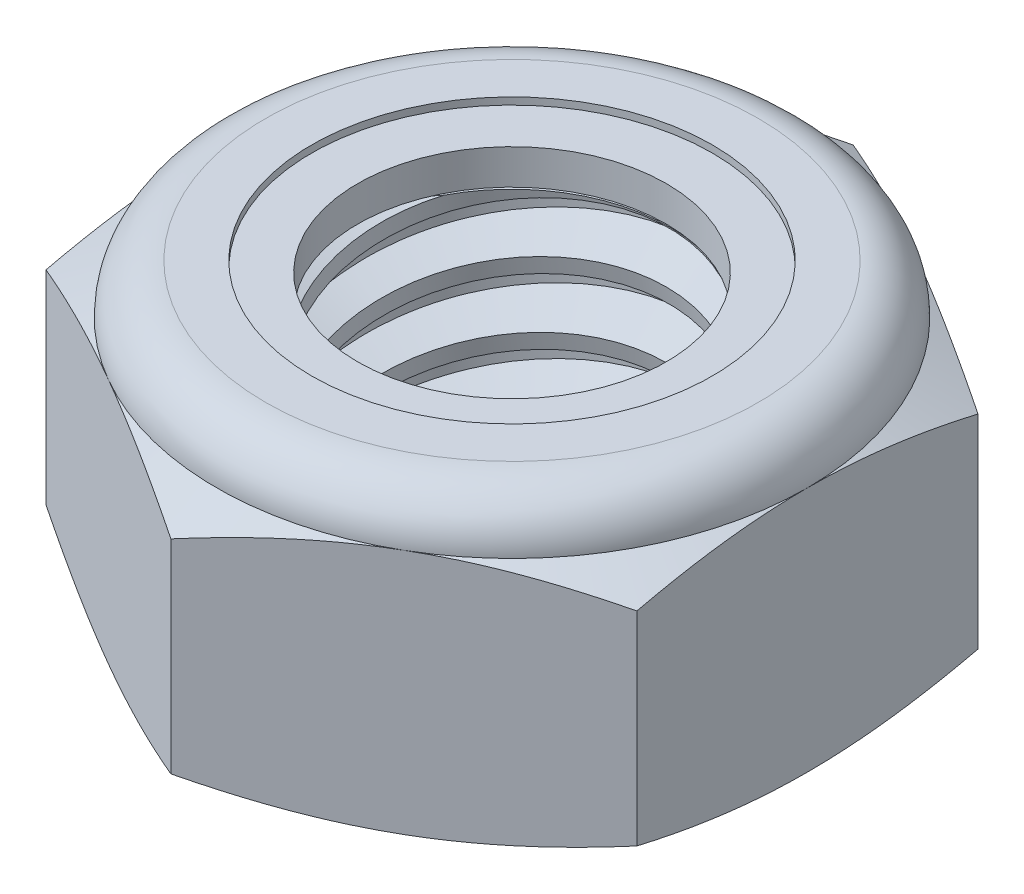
ISO-10303-21;
HEADER;
FILE_DESCRIPTION(('STEP AP214'),'2;1');
FILE_NAME('part.step','',(''),(''),'','','');
FILE_SCHEMA(('AUTOMOTIVE_DESIGN { 1 0 10303 214 1 1 1 1 }'));
ENDSEC;
DATA;
#1=APPLICATION_CONTEXT('core data for automotive mechanical design processes');
#2=APPLICATION_PROTOCOL_DEFINITION('international standard','automotive_design',2000,#1);
#3=PRODUCT_CONTEXT('',#1,'mechanical');
#4=PRODUCT('Part','Part','',(#3));
#5=PRODUCT_RELATED_PRODUCT_CATEGORY('part','',(#4));
#6=PRODUCT_DEFINITION_FORMATION('','',#4);
#7=PRODUCT_DEFINITION_CONTEXT('part definition',#1,'design');
#8=PRODUCT_DEFINITION('design','',#6,#7);
#9=PRODUCT_DEFINITION_SHAPE('','',#8);
#10=(LENGTH_UNIT() NAMED_UNIT(*) SI_UNIT(.MILLI.,.METRE.));
#11=(NAMED_UNIT(*) PLANE_ANGLE_UNIT() SI_UNIT($,.RADIAN.));
#12=(NAMED_UNIT(*) SI_UNIT($,.STERADIAN.) SOLID_ANGLE_UNIT());
#13=UNCERTAINTY_MEASURE_WITH_UNIT(LENGTH_MEASURE(1.E-05),#10,'distance_accuracy_value','');
#14=(GEOMETRIC_REPRESENTATION_CONTEXT(3) GLOBAL_UNCERTAINTY_ASSIGNED_CONTEXT((#13)) GLOBAL_UNIT_ASSIGNED_CONTEXT((#10,
#11,#12)) REPRESENTATION_CONTEXT('',''));
#15=CARTESIAN_POINT('',(0.,0.,0.));
#16=DIRECTION('',(0.,0.,1.));
#17=DIRECTION('',(1.,0.,0.));
#18=AXIS2_PLACEMENT_3D('',#15,#16,#17);
#19=CARTESIAN_POINT('',(0.,5.36786666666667,0.));
#20=DIRECTION('',(0.,-1.,0.));
#21=DIRECTION('',(0.,0.,-1.));
#22=AXIS2_PLACEMENT_3D('',#19,#20,#21);
#23=CYLINDRICAL_SURFACE('',#22,3.31866822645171);
#24=CARTESIAN_POINT('',(0.,5.36786666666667,0.));
#25=DIRECTION('',(0.,-1.,0.));
#26=DIRECTION('',(0.,0.,-1.));
#27=AXIS2_PLACEMENT_3D('',#24,#25,#26);
#28=CIRCLE('',#27,3.31866822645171);
#29=CARTESIAN_POINT('',(0.,5.36786666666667,-3.31866822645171));
#30=VERTEX_POINT('',#29);
#31=EDGE_CURVE('E11',#30,#30,#28,.T.);
#32=ORIENTED_EDGE('',*,*,#31,.T.);
#33=EDGE_LOOP('',(#32));
#34=FACE_BOUND('',#33,.T.);
#35=CARTESIAN_POINT('',(0.,6.1214,0.));
#36=DIRECTION('',(0.,-1.,0.));
#37=DIRECTION('',(0.,0.,-1.));
#38=AXIS2_PLACEMENT_3D('',#35,#36,#37);
#39=CIRCLE('',#38,3.31866822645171);
#40=CARTESIAN_POINT('',(0.,6.1214,-3.31866822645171));
#41=VERTEX_POINT('',#40);
#42=EDGE_CURVE('E59',#41,#41,#39,.T.);
#43=ORIENTED_EDGE('',*,*,#42,.F.);
#44=EDGE_LOOP('',(#43));
#45=FACE_BOUND('',#44,.T.);
#46=ADVANCED_FACE('F45',(#34,#45),#23,.F.);
#47=CARTESIAN_POINT('',(0.,5.36786666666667,-3.31866822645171));
#48=DIRECTION('',(0.,-1.,0.));
#49=DIRECTION('',(0.,0.,-1.));
#50=AXIS2_PLACEMENT_3D('',#47,#48,#49);
#51=PLANE('',#50);
#52=CARTESIAN_POINT('',(0.,5.36786666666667,0.));
#53=DIRECTION('',(0.,-1.,0.));
#54=DIRECTION('',(0.,0.,-1.));
#55=AXIS2_PLACEMENT_3D('',#52,#53,#54);
#56=CIRCLE('',#55,6.11789361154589);
#57=CARTESIAN_POINT('',(0.,5.36786666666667,-6.11789361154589));
#58=VERTEX_POINT('',#57);
#59=EDGE_CURVE('E51',#58,#58,#56,.T.);
#60=ORIENTED_EDGE('',*,*,#59,.T.);
#61=EDGE_LOOP('',(#60));
#62=FACE_BOUND('',#61,.T.);
#63=ORIENTED_EDGE('',*,*,#31,.F.);
#64=EDGE_LOOP('',(#63));
#65=FACE_BOUND('',#64,.T.);
#66=ADVANCED_FACE('F69',(#62,#65),#51,.T.);
#67=CARTESIAN_POINT('',(0.,5.29166666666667,0.));
#68=DIRECTION('',(0.,-1.,0.));
#69=DIRECTION('',(0.,0.,-1.));
#70=AXIS2_PLACEMENT_3D('',#67,#68,#69);
#71=TOROIDAL_SURFACE('',#70,5.29166666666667,0.829733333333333);
#72=CARTESIAN_POINT('',(0.,6.1214,0.));
#73=DIRECTION('',(0.,-1.,0.));
#74=DIRECTION('',(0.,0.,-1.));
#75=AXIS2_PLACEMENT_3D('',#72,#73,#74);
#76=CIRCLE('',#75,5.29166666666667);
#77=CARTESIAN_POINT('',(0.,6.1214,-5.29166666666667));
#78=VERTEX_POINT('',#77);
#79=EDGE_CURVE('E55',#78,#78,#76,.T.);
#80=ORIENTED_EDGE('',*,*,#79,.T.);
#81=EDGE_LOOP('',(#80));
#82=FACE_BOUND('',#81,.T.);
#83=ORIENTED_EDGE('',*,*,#59,.F.);
#84=EDGE_LOOP('',(#83));
#85=FACE_BOUND('',#84,.T.);
#86=ADVANCED_FACE('F73',(#82,#85),#71,.T.);
#87=CARTESIAN_POINT('',(0.,6.1214,-5.29166666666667));
#88=DIRECTION('',(0.,1.,0.));
#89=DIRECTION('',(0.,0.,1.));
#90=AXIS2_PLACEMENT_3D('',#87,#88,#89);
#91=PLANE('',#90);
#92=ORIENTED_EDGE('',*,*,#42,.T.);
#93=EDGE_LOOP('',(#92));
#94=FACE_BOUND('',#93,.T.);
#95=ORIENTED_EDGE('',*,*,#79,.F.);
#96=EDGE_LOOP('',(#95));
#97=FACE_BOUND('',#96,.T.);
#98=ADVANCED_FACE('F65',(#94,#97),#91,.T.);
#99=CLOSED_SHELL('',(#46,#66,#86,#98));
#100=MANIFOLD_SOLID_BREP('B2',#99);
#101=CARTESIAN_POINT('',(-6.35,6.35,-10.9985226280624));
#102=DIRECTION('',(0.,1.,0.));
#103=DIRECTION('',(0.,0.,1.));
#104=AXIS2_PLACEMENT_3D('',#101,#102,#103);
#105=PLANE('',#104);
#106=CARTESIAN_POINT('',(0.,6.35,0.));
#107=DIRECTION('',(0.,1.,0.));
#108=DIRECTION('',(0.,0.,1.));
#109=AXIS2_PLACEMENT_3D('',#106,#107,#108);
#110=CIRCLE('',#109,4.30516744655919);
#111=CARTESIAN_POINT('',(0.,6.35,4.30516744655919));
#112=VERTEX_POINT('',#111);
#113=EDGE_CURVE('E112',#112,#112,#110,.T.);
#114=ORIENTED_EDGE('',*,*,#113,.F.);
#115=EDGE_LOOP('',(#114));
#116=FACE_BOUND('',#115,.T.);
#117=CARTESIAN_POINT('',(0.,6.35,0.));
#118=DIRECTION('',(0.,-1.,0.));
#119=DIRECTION('',(0.,0.,-1.));
#120=AXIS2_PLACEMENT_3D('',#117,#118,#119);
#121=CIRCLE('',#120,5.29166666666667);
#122=CARTESIAN_POINT('',(0.,6.35,-5.29166666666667));
#123=VERTEX_POINT('',#122);
#124=EDGE_CURVE('E460',#123,#123,#121,.T.);
#125=ORIENTED_EDGE('',*,*,#124,.F.);
#126=EDGE_LOOP('',(#125));
#127=FACE_BOUND('',#126,.T.);
#128=ADVANCED_FACE('F107',(#116,#127),#105,.T.);
#129=CARTESIAN_POINT('',(-6.35,0.,-10.9985226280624));
#130=DIRECTION('',(0.,1.,0.));
#131=DIRECTION('',(0.,0.,1.));
#132=AXIS2_PLACEMENT_3D('',#129,#130,#131);
#133=PLANE('',#132);
#134=CARTESIAN_POINT('',(0.,0.,0.));
#135=DIRECTION('',(0.,-1.,0.));
#136=DIRECTION('',(0.,0.,-1.));
#137=AXIS2_PLACEMENT_3D('',#134,#135,#136);
#138=CIRCLE('',#137,3.9624);
#139=CARTESIAN_POINT('',(3.93057207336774,0.,0.501215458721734));
#140=VERTEX_POINT('',#139);
#141=CARTESIAN_POINT('',(-3.93057207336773,0.,0.501215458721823));
#142=VERTEX_POINT('',#141);
#143=EDGE_CURVE('E542',#140,#142,#138,.T.);
#144=ORIENTED_EDGE('',*,*,#143,.F.);
#145=CARTESIAN_POINT('',(0.,0.,0.));
#146=DIRECTION('',(0.,-1.,0.));
#147=DIRECTION('',(0.,0.,-1.));
#148=AXIS2_PLACEMENT_3D('',#145,#146,#147);
#149=CIRCLE('',#148,3.9624);
#150=EDGE_CURVE('E273',#142,#140,#149,.T.);
#151=ORIENTED_EDGE('',*,*,#150,.F.);
#152=EDGE_LOOP('',(#144,#151));
#153=FACE_BOUND('',#152,.T.);
#154=CARTESIAN_POINT('',(0.,0.,0.));
#155=DIRECTION('',(0.,-1.,0.));
#156=DIRECTION('',(0.,0.,-1.));
#157=AXIS2_PLACEMENT_3D('',#154,#155,#156);
#158=CIRCLE('',#157,6.35);
#159=CARTESIAN_POINT('',(3.175,0.,5.49926131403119));
#160=VERTEX_POINT('',#159);
#161=CARTESIAN_POINT('',(-3.175,0.,5.49926131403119));
#162=VERTEX_POINT('',#161);
#163=EDGE_CURVE('E451',#160,#162,#158,.T.);
#164=ORIENTED_EDGE('',*,*,#163,.T.);
#165=CARTESIAN_POINT('',(-6.35,0.,0.));
#166=VERTEX_POINT('',#165);
#167=EDGE_CURVE('E131',#162,#166,#158,.T.);
#168=ORIENTED_EDGE('',*,*,#167,.T.);
#169=CARTESIAN_POINT('',(-3.175,0.,-5.49926131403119));
#170=VERTEX_POINT('',#169);
#171=EDGE_CURVE('E444',#166,#170,#158,.T.);
#172=ORIENTED_EDGE('',*,*,#171,.T.);
#173=CARTESIAN_POINT('',(3.175,0.,-5.49926131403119));
#174=VERTEX_POINT('',#173);
#175=EDGE_CURVE('E440',#170,#174,#158,.T.);
#176=ORIENTED_EDGE('',*,*,#175,.T.);
#177=CARTESIAN_POINT('',(6.35,0.,0.));
#178=VERTEX_POINT('',#177);
#179=EDGE_CURVE('E446',#174,#178,#158,.T.);
#180=ORIENTED_EDGE('',*,*,#179,.T.);
#181=EDGE_CURVE('E455',#178,#160,#158,.T.);
#182=ORIENTED_EDGE('',*,*,#181,.T.);
#183=EDGE_LOOP('',(#164,#168,#172,#176,#180,#182));
#184=FACE_BOUND('',#183,.T.);
#185=ADVANCED_FACE('F309',(#153,#184),#133,.F.);
#186=CARTESIAN_POINT('',(0.,0.,0.));
#187=DIRECTION('',(0.,-1.,0.));
#188=DIRECTION('',(0.,0.,-1.));
#189=AXIS2_PLACEMENT_3D('',#186,#187,#188);
#190=CONICAL_SURFACE('',#189,3.9624,1.13446401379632);
#191=CARTESIAN_POINT('',(0.311207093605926,0.264580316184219,3.38071201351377));
#192=CARTESIAN_POINT('',(0.40534203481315,0.264630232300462,3.37194806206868));
#193=CARTESIAN_POINT('',(0.499099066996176,0.264703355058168,3.35918513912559));
#194=CARTESIAN_POINT('',(0.685196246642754,0.264890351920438,3.32580458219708));
#195=CARTESIAN_POINT('',(0.777536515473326,0.265004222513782,3.30518762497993));
#196=CARTESIAN_POINT('',(0.96005089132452,0.265266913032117,3.25626872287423));
#197=CARTESIAN_POINT('',(1.05022735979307,0.265415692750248,3.22797561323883));
#198=CARTESIAN_POINT('',(1.22786416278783,0.265739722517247,3.16393166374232));
#199=CARTESIAN_POINT('',(1.31532450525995,0.265914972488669,3.12818084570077));
#200=CARTESIAN_POINT('',(1.57289504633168,0.266466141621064,3.0100237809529));
#201=CARTESIAN_POINT('',(1.73816285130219,0.266867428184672,2.91672151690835));
#202=CARTESIAN_POINT('',(2.05078421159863,0.267637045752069,2.7040115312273));
#203=CARTESIAN_POINT('',(2.19813873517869,0.268005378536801,2.58460522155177));
#204=CARTESIAN_POINT('',(2.4725182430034,0.26859664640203,2.32179507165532));
#205=CARTESIAN_POINT('',(2.59932432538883,0.268818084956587,2.17816238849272));
#206=CARTESIAN_POINT('',(2.82744683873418,0.26898865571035,1.87189402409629));
#207=CARTESIAN_POINT('',(2.92875811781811,0.268937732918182,1.70925451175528));
#208=CARTESIAN_POINT('',(3.10457480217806,0.268451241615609,1.36708056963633));
#209=CARTESIAN_POINT('',(3.1786691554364,0.268010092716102,1.18733492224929));
#210=CARTESIAN_POINT('',(3.29609424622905,0.266650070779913,0.818075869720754));
#211=CARTESIAN_POINT('',(3.33942436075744,0.265731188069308,0.62856226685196));
#212=CARTESIAN_POINT('',(3.39466712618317,0.263355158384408,0.24232042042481));
#213=CARTESIAN_POINT('',(3.40613491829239,0.261890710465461,0.0455285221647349));
#214=CARTESIAN_POINT('',(3.39613903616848,0.25843353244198,-0.3472233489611));
#215=CARTESIAN_POINT('',(3.37467243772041,0.256440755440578,-0.543183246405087));
#216=CARTESIAN_POINT('',(3.29910669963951,0.251979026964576,-0.930224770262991));
#217=CARTESIAN_POINT('',(3.24476621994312,0.249506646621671,-1.12125931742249));
#218=CARTESIAN_POINT('',(3.10468900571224,0.244227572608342,-1.49143056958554));
#219=CARTESIAN_POINT('',(3.01895522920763,0.241420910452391,-1.67056839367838));
#220=CARTESIAN_POINT('',(2.81871478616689,0.235669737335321,-2.01110762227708));
#221=CARTESIAN_POINT('',(2.70431414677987,0.232725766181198,-2.17257130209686));
#222=CARTESIAN_POINT('',(2.44963322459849,0.226912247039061,-2.47371520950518));
#223=CARTESIAN_POINT('',(2.30934189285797,0.2240427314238,-2.61338608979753));
#224=CARTESIAN_POINT('',(2.00873569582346,0.218654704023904,-2.86483171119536));
#225=CARTESIAN_POINT('',(1.84871727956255,0.216131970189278,-2.97695816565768));
#226=CARTESIAN_POINT('',(1.59641926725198,0.212746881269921,-3.12315440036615));
#227=CARTESIAN_POINT('',(1.5103245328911,0.211685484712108,-3.16820255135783));
#228=CARTESIAN_POINT('',(1.33458455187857,0.209717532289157,-3.25070030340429));
#229=CARTESIAN_POINT('',(1.24494163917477,0.20881087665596,-3.28815480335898));
#230=CARTESIAN_POINT('',(1.12491496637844,0.207731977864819,-3.33230078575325));
#231=CARTESIAN_POINT('',(1.09580443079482,0.207480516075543,-3.34255395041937));
#232=CARTESIAN_POINT('',(1.03734219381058,0.206996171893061,-3.36224315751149));
#233=CARTESIAN_POINT('',(1.00799077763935,0.206763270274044,-3.37168004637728));
#234=CARTESIAN_POINT('',(0.97851110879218,0.206539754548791,-3.38071201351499));
#235=B_SPLINE_CURVE_WITH_KNOTS('',3,(#191,#192,#193,#194,#195,#196,#197,#198,#199,#200,#201,
#202,#203,#204,#205,#206,#207,#208,#209,#210,#211,#212,#213,#214,#215,#216,#217,#218,#219,#220,
#221,#222,#223,#224,#225,#226,#227,#228,#229,#230,#231,#232,#233,#234),.UNSPECIFIED.,.F.,.F.,(4,
2,2,2,2,2,2,2,2,2,2,2,2,2,2,2,2,2,2,2,2,4),(0.,0.283532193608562,0.567039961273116,
0.8502227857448,1.13340478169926,1.69986666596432,2.26629791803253,2.83841467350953,
3.41064694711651,3.99119709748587,4.57175900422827,5.16038688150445,5.74906702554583,
6.34212225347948,6.93512161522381,7.52595927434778,8.11704966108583,8.70014634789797,
8.99138114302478,9.28242745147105,9.37501299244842,9.46750134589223),.UNSPECIFIED.);
#236=CARTESIAN_POINT('',(1.74858273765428,0.26689569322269,2.90427820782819));
#237=VERTEX_POINT('',#236);
#238=CARTESIAN_POINT('',(3.27060561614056,0.266895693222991,0.891915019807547));
#239=VERTEX_POINT('',#238);
#240=EDGE_CURVE('E569',#237,#239,#235,.T.);
#241=ORIENTED_EDGE('',*,*,#240,.T.);
#242=CARTESIAN_POINT('',(0.924811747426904,0.835167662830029,1.96458698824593));
#243=CARTESIAN_POINT('',(1.00073344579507,0.827955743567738,1.94595519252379));
#244=CARTESIAN_POINT('',(1.0760393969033,0.819814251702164,1.92530502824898));
#245=CARTESIAN_POINT('',(1.22531538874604,0.801675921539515,1.88048661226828));
#246=CARTESIAN_POINT('',(1.29928633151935,0.791680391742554,1.85632084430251));
#247=CARTESIAN_POINT('',(1.51868232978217,0.758978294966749,1.77946396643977));
#248=CARTESIAN_POINT('',(1.66212601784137,0.733505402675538,1.72227487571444));
#249=CARTESIAN_POINT('',(1.94287758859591,0.675772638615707,1.60028021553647));
#250=CARTESIAN_POINT('',(2.0802235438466,0.643565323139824,1.53553524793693));
#251=CARTESIAN_POINT('',(2.35093140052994,0.572981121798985,1.40108540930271));
#252=CARTESIAN_POINT('',(2.48429032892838,0.534599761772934,1.3313769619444));
#253=CARTESIAN_POINT('',(2.71169707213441,0.463902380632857,1.20865349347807));
#254=CARTESIAN_POINT('',(2.80649471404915,0.432810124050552,1.1563038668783));
#255=CARTESIAN_POINT('',(2.99478430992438,0.368269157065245,1.05062165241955));
#256=CARTESIAN_POINT('',(3.08827570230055,0.334819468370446,0.997288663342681));
#257=CARTESIAN_POINT('',(3.30786582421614,0.253453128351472,0.870602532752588));
#258=CARTESIAN_POINT('',(3.43350330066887,0.204686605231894,0.796998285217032));
#259=CARTESIAN_POINT('',(3.68329172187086,0.104258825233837,0.649277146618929));
#260=CARTESIAN_POINT('',(3.80744274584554,0.0525977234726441,0.575160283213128));
#261=CARTESIAN_POINT('',(4.0291194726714,-0.0420969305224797,0.442033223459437));
#262=CARTESIAN_POINT('',(4.12685012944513,-0.0847095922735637,0.383063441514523));
#263=CARTESIAN_POINT('',(4.32175439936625,-0.171120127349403,0.265067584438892));
#264=CARTESIAN_POINT('',(4.4189280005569,-0.214918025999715,0.206041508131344));
#265=CARTESIAN_POINT('',(4.61280314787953,-0.303483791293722,0.0879976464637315));
#266=CARTESIAN_POINT('',(4.70950479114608,-0.348251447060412,0.0289798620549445));
#267=CARTESIAN_POINT('',(4.90253020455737,-0.438606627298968,-0.0890322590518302));
#268=CARTESIAN_POINT('',(4.99885399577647,-0.484194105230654,-0.148026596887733));
#269=CARTESIAN_POINT('',(5.09503088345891,-0.530114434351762,-0.206998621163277));
#270=B_SPLINE_CURVE_WITH_KNOTS('',3,(#242,#243,#244,#245,#246,#247,#248,#249,#250,#251,#252,
#253,#254,#255,#256,#257,#258,#259,#260,#261,#262,#263,#264,#265,#266,#267,#268,#269),
.UNSPECIFIED.,.F.,.F.,(4,2,2,2,2,2,2,2,2,2,2,2,2,4),(0.,0.235436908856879,0.470708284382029,
0.939592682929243,1.40494598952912,1.87063805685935,2.20860151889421,2.54670606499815,
3.00733562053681,3.46794051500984,3.83344739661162,4.19896209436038,4.56439809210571,
4.92981340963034),.UNSPECIFIED.);
#271=EDGE_CURVE('E348',#239,#140,#270,.T.);
#272=ORIENTED_EDGE('',*,*,#271,.T.);
#273=ORIENTED_EDGE('',*,*,#143,.T.);
#274=CARTESIAN_POINT('',(-5.09503088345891,-0.530114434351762,-0.206998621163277));
#275=CARTESIAN_POINT('',(-4.9988539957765,-0.484194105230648,-0.14802659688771));
#276=CARTESIAN_POINT('',(-4.90253020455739,-0.438606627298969,-0.0890322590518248));
#277=CARTESIAN_POINT('',(-4.7095047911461,-0.348251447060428,0.0289798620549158));
#278=CARTESIAN_POINT('',(-4.61280314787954,-0.303483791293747,0.0879976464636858));
#279=CARTESIAN_POINT('',(-4.41892800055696,-0.214918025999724,0.206041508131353));
#280=CARTESIAN_POINT('',(-4.32175439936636,-0.171120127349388,0.265067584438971));
#281=CARTESIAN_POINT('',(-4.12685012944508,-0.0847095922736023,0.383063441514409));
#282=CARTESIAN_POINT('',(-4.02911947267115,-0.0420969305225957,0.442033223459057));
#283=CARTESIAN_POINT('',(-3.80744274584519,0.05259772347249,0.575160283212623));
#284=CARTESIAN_POINT('',(-3.68329172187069,0.104258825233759,0.649277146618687));
#285=CARTESIAN_POINT('',(-3.43350330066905,0.204686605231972,0.796998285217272));
#286=CARTESIAN_POINT('',(-3.30786582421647,0.253453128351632,0.870602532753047));
#287=CARTESIAN_POINT('',(-3.08827570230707,0.334819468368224,0.997288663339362));
#288=CARTESIAN_POINT('',(-2.9947843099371,0.368269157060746,1.05062165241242));
#289=CARTESIAN_POINT('',(-2.80649471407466,0.432810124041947,1.15630386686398));
#290=CARTESIAN_POINT('',(-2.7116970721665,0.463902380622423,1.20865349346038));
#291=CARTESIAN_POINT('',(-2.48429032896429,0.534599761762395,1.33137696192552));
#292=CARTESIAN_POINT('',(-2.35093140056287,0.572981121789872,1.40108540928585));
#293=CARTESIAN_POINT('',(-2.08022354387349,0.643565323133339,1.53553524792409));
#294=CARTESIAN_POINT('',(-1.94287758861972,0.675772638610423,1.60028021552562));
#295=CARTESIAN_POINT('',(-1.66212601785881,0.733505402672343,1.72227487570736));
#296=CARTESIAN_POINT('',(-1.51868232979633,0.758978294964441,1.77946396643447));
#297=CARTESIAN_POINT('',(-1.29928633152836,0.791680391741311,1.85632084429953));
#298=CARTESIAN_POINT('',(-1.2253153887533,0.801675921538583,1.88048661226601));
#299=CARTESIAN_POINT('',(-1.07603939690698,0.819814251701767,1.92530502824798));
#300=CARTESIAN_POINT('',(-1.00073344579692,0.827955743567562,1.94595519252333));
#301=CARTESIAN_POINT('',(-0.924811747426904,0.835167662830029,1.96458698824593));
#302=B_SPLINE_CURVE_WITH_KNOTS('',3,(#274,#275,#276,#277,#278,#279,#280,#281,#282,#283,#284,
#285,#286,#287,#288,#289,#290,#291,#292,#293,#294,#295,#296,#297,#298,#299,#300,#301),
.UNSPECIFIED.,.F.,.F.,(4,2,2,2,2,2,2,2,2,2,2,2,2,4),(0.,0.365415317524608,0.730851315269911,
1.09636601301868,1.46187289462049,1.92247778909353,2.38310734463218,2.72121189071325,
3.05917535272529,3.52486742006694,3.99022072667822,4.45910512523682,4.69437650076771,
4.92981340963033),.UNSPECIFIED.);
#303=CARTESIAN_POINT('',(-3.27060561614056,0.266895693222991,0.891915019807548));
#304=VERTEX_POINT('',#303);
#305=EDGE_CURVE('E515',#142,#304,#302,.T.);
#306=ORIENTED_EDGE('',*,*,#305,.T.);
#307=CARTESIAN_POINT('',(-0.978511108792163,0.206539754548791,-3.38071201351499));
#308=CARTESIAN_POINT('',(-1.05303328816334,0.207104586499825,-3.35788229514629));
#309=CARTESIAN_POINT('',(-1.12673635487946,0.20772985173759,-3.33245751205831));
#310=CARTESIAN_POINT('',(-1.27218450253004,0.209091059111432,-3.27655757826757));
#311=CARTESIAN_POINT('',(-1.34392995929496,0.209826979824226,-3.24608340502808));
#312=CARTESIAN_POINT('',(-1.55573604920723,0.212185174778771,-3.14730827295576));
#313=CARTESIAN_POINT('',(-1.69242728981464,0.213958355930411,-3.0716359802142));
#314=CARTESIAN_POINT('',(-1.98232916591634,0.218218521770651,-2.88396673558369));
#315=CARTESIAN_POINT('',(-2.13275647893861,0.220776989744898,-2.76765647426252));
#316=CARTESIAN_POINT('',(-2.41238026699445,0.226128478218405,-2.51179181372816));
#317=CARTESIAN_POINT('',(-2.54156891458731,0.228921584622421,-2.37222888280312));
#318=CARTESIAN_POINT('',(-2.77731903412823,0.234577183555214,-2.0713909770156));
#319=CARTESIAN_POINT('',(-2.88347141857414,0.237440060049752,-1.90979538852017));
#320=CARTESIAN_POINT('',(-3.0676869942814,0.242987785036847,-1.57131190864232));
#321=CARTESIAN_POINT('',(-3.14574692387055,0.245672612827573,-1.39442224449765));
#322=CARTESIAN_POINT('',(-3.27291857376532,0.250744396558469,-1.02704506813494));
#323=CARTESIAN_POINT('',(-3.32150033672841,0.253125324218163,-0.83637389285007));
#324=CARTESIAN_POINT('',(-3.38628604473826,0.257414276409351,-0.449604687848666));
#325=CARTESIAN_POINT('',(-3.40248892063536,0.259322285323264,-0.253506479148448));
#326=CARTESIAN_POINT('',(-3.40205966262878,0.262621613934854,0.14043831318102));
#327=CARTESIAN_POINT('',(-3.3851300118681,0.264008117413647,0.338284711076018));
#328=CARTESIAN_POINT('',(-3.31822091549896,0.266240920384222,0.728321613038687));
#329=CARTESIAN_POINT('',(-3.2682408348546,0.26708720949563,0.920512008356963));
#330=CARTESIAN_POINT('',(-3.13665023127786,0.268293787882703,1.29322930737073));
#331=CARTESIAN_POINT('',(-3.05511657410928,0.268655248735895,1.47378332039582));
#332=CARTESIAN_POINT('',(-2.86255655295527,0.268993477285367,1.81840991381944));
#333=CARTESIAN_POINT('',(-2.75153326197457,0.268970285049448,1.98248420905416));
#334=CARTESIAN_POINT('',(-2.50448716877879,0.268665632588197,2.28741250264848));
#335=CARTESIAN_POINT('',(-2.36877175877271,0.268387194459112,2.428515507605));
#336=CARTESIAN_POINT('',(-2.07520430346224,0.267706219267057,2.68554867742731));
#337=CARTESIAN_POINT('',(-1.91734733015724,0.267303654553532,2.80147322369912));
#338=CARTESIAN_POINT('',(-1.58652790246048,0.266503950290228,3.00299813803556));
#339=CARTESIAN_POINT('',(-1.4138187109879,0.266106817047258,3.08901526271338));
#340=CARTESIAN_POINT('',(-1.05640741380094,0.265411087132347,3.23028956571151));
#341=CARTESIAN_POINT('',(-0.871724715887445,0.265112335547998,3.28559519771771));
#342=CARTESIAN_POINT('',(-0.622335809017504,0.264824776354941,3.33754181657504));
#343=CARTESIAN_POINT('',(-0.560400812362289,0.264762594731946,3.34863083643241));
#344=CARTESIAN_POINT('',(-0.436109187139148,0.264657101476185,3.36729634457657));
#345=CARTESIAN_POINT('',(-0.373753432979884,0.264613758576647,3.37487865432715));
#346=CARTESIAN_POINT('',(-0.311207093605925,0.264580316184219,3.38071201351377));
#347=B_SPLINE_CURVE_WITH_KNOTS('',3,(#307,#308,#309,#310,#311,#312,#313,#314,#315,#316,#317,
#318,#319,#320,#321,#322,#323,#324,#325,#326,#327,#328,#329,#330,#331,#332,#333,#334,#335,#336,
#337,#338,#339,#340,#341,#342,#343,#344,#345,#346),.UNSPECIFIED.,.F.,.F.,(4,2,2,2,2,2,2,2,2,2,2,
2,2,2,2,2,2,2,2,4),(0.,0.233736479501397,0.467427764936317,0.93462091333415,1.5024421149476,
2.07047211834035,2.64788660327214,3.22536810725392,3.81294565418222,4.40054260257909,
4.99344015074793,5.58634909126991,6.17782268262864,6.76923466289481,7.35373355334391,
7.93836274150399,8.51448381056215,9.08969332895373,9.27838151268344,9.46675532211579),.UNSPECIFIED.);
#348=CARTESIAN_POINT('',(-1.74858273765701,0.266895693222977,2.90427820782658));
#349=VERTEX_POINT('',#348);
#350=EDGE_CURVE('E521',#304,#349,#347,.T.);
#351=ORIENTED_EDGE('',*,*,#350,.T.);
#352=CARTESIAN_POINT('',(-1.59302647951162,0.647398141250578,-2.02188058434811));
#353=CARTESIAN_POINT('',(-1.66308565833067,0.643935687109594,-1.97613442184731));
#354=CARTESIAN_POINT('',(-1.73114842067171,0.640246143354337,-1.92742532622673));
#355=CARTESIAN_POINT('',(-1.86287431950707,0.6324375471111,-1.82443277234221));
#356=CARTESIAN_POINT('',(-1.92653812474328,0.628318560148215,-1.77015016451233));
#357=CARTESIAN_POINT('',(-2.11009173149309,0.615371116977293,-1.59968880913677));
#358=CARTESIAN_POINT('',(-2.22284494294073,0.605937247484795,-1.47569904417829));
#359=CARTESIAN_POINT('',(-2.42732666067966,0.585604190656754,-1.2090308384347));
#360=CARTESIAN_POINT('',(-2.51875714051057,0.574687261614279,-1.0661267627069));
#361=CARTESIAN_POINT('',(-2.67634808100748,0.551792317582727,-0.767063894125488));
#362=CARTESIAN_POINT('',(-2.74250695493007,0.539814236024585,-0.610904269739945));
#363=CARTESIAN_POINT('',(-2.84794610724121,0.515113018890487,-0.28951481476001));
#364=CARTESIAN_POINT('',(-2.88717771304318,0.502388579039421,-0.124269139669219));
#365=CARTESIAN_POINT('',(-2.93760225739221,0.476569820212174,0.210413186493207));
#366=CARTESIAN_POINT('',(-2.94879519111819,0.463475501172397,0.379849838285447));
#367=CARTESIAN_POINT('',(-2.9428350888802,0.437139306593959,0.720078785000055));
#368=CARTESIAN_POINT('',(-2.92537129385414,0.423897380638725,0.890865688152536));
#369=CARTESIAN_POINT('',(-2.86191272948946,0.397781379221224,1.22721524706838));
#370=CARTESIAN_POINT('',(-2.81589935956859,0.384907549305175,1.39277442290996));
#371=CARTESIAN_POINT('',(-2.69648638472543,0.359907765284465,1.71388708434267));
#372=CARTESIAN_POINT('',(-2.6230633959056,0.347782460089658,1.86943189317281));
#373=CARTESIAN_POINT('',(-2.45086038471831,0.324679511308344,2.16550376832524));
#374=CARTESIAN_POINT('',(-2.35215508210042,0.313698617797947,2.30607338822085));
#375=CARTESIAN_POINT('',(-2.23119988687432,0.302429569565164,2.45021755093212));
#376=CARTESIAN_POINT('',(-2.21994741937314,0.30139956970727,2.46339129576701));
#377=CARTESIAN_POINT('',(-2.11235104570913,0.291722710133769,2.58714842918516));
#378=CARTESIAN_POINT('',(-2.00775700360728,0.283604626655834,2.69089157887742));
#379=CARTESIAN_POINT('',(-1.7840994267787,0.268650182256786,2.88189705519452));
#380=CARTESIAN_POINT('',(-1.66500156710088,0.261816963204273,2.96911898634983));
#381=CARTESIAN_POINT('',(-1.39870928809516,0.248822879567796,3.13491498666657));
#382=CARTESIAN_POINT('',(-1.24987455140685,0.242864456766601,3.21089648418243));
#383=CARTESIAN_POINT('',(-0.941434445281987,0.233020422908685,3.33639248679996));
#384=CARTESIAN_POINT('',(-0.781831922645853,0.229134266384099,3.38591395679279));
#385=CARTESIAN_POINT('',(-0.45892253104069,0.223601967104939,3.45640406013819));
#386=CARTESIAN_POINT('',(-0.295707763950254,0.221922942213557,3.47779183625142));
#387=CARTESIAN_POINT('',(0.0319810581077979,0.220752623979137,3.49270011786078));
#388=CARTESIAN_POINT('',(0.196454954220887,0.221261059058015,3.48622408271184));
#389=CARTESIAN_POINT('',(0.520590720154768,0.224434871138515,3.44579120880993));
#390=CARTESIAN_POINT('',(0.680280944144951,0.227082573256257,3.41205955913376));
#391=CARTESIAN_POINT('',(0.99183735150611,0.234429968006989,3.31842325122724));
#392=CARTESIAN_POINT('',(1.14369932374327,0.239130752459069,3.25850466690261));
#393=CARTESIAN_POINT('',(1.43599830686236,0.250461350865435,3.11401039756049));
#394=CARTESIAN_POINT('',(1.57637641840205,0.25710039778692,3.02931669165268));
#395=CARTESIAN_POINT('',(1.84087435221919,0.272084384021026,2.83804630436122));
#396=CARTESIAN_POINT('',(1.96503024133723,0.280425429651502,2.73151956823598));
#397=CARTESIAN_POINT('',(2.12398573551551,0.293007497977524,2.57070262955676));
#398=CARTESIAN_POINT('',(2.16703768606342,0.296640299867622,2.52425750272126));
#399=CARTESIAN_POINT('',(2.30517867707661,0.309066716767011,2.36533629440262));
#400=CARTESIAN_POINT('',(2.39360548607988,0.318318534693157,2.24693543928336));
#401=CARTESIAN_POINT('',(2.55220105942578,0.337729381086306,1.9983004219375));
#402=CARTESIAN_POINT('',(2.62232932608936,0.347890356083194,1.8680408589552));
#403=CARTESIAN_POINT('',(2.75130805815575,0.370367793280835,1.5795893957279));
#404=CARTESIAN_POINT('',(2.807161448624,0.38278587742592,1.42005233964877));
#405=CARTESIAN_POINT('',(2.89160403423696,0.408130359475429,1.09400015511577));
#406=CARTESIAN_POINT('',(2.92019377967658,0.421056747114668,0.927485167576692));
#407=CARTESIAN_POINT('',(2.94963854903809,0.447238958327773,0.589688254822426));
#408=CARTESIAN_POINT('',(2.95010299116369,0.460496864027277,0.418372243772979));
#409=CARTESIAN_POINT('',(2.92229504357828,0.486785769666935,0.0780816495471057));
#410=CARTESIAN_POINT('',(2.8940238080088,0.499816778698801,-0.0908930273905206));
#411=CARTESIAN_POINT('',(2.80929687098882,0.525329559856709,-0.422339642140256));
#412=CARTESIAN_POINT('',(2.75273932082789,0.537809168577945,-0.584785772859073));
#413=CARTESIAN_POINT('',(2.61286932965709,0.561807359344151,-0.89777964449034));
#414=CARTESIAN_POINT('',(2.52955750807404,0.573325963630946,-1.04832766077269));
#415=CARTESIAN_POINT('',(2.33917611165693,0.594973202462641,-1.33180983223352));
#416=CARTESIAN_POINT('',(2.23232947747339,0.605113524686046,-1.46489171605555));
#417=CARTESIAN_POINT('',(2.05620894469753,0.61914616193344,-1.64939121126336));
#418=CARTESIAN_POINT('',(1.99478420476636,0.623631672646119,-1.70842693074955));
#419=CARTESIAN_POINT('',(1.86705492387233,0.632178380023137,-1.82101396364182));
#420=CARTESIAN_POINT('',(1.80074962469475,0.636239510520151,-1.87456442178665));
#421=CARTESIAN_POINT('',(1.73220558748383,0.64007448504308,-1.92517508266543));
#422=B_SPLINE_CURVE_WITH_KNOTS('',3,(#352,#353,#354,#355,#356,#357,#358,#359,#360,#361,#362,
#363,#364,#365,#366,#367,#368,#369,#370,#371,#372,#373,#374,#375,#376,#377,#378,#379,#380,#381,
#382,#383,#384,#385,#386,#387,#388,#389,#390,#391,#392,#393,#394,#395,#396,#397,#398,#399,#400,
#401,#402,#403,#404,#405,#406,#407,#408,#409,#410,#411,#412,#413,#414,#415,#416,#417,#418,#419,
#420,#421),.UNSPECIFIED.,.F.,.F.,(4,2,2,2,2,2,2,2,2,2,2,2,2,2,2,2,2,2,2,2,2,2,2,2,2,2,2,2,2,2,2,
2,2,2,4),(0.,0.251071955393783,0.502105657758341,1.00310550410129,1.51073637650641,
2.01839911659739,2.52697708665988,3.03555514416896,3.5496848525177,4.06414987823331,
4.5790548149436,5.09245520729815,5.14452669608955,5.58524898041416,6.02703532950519,
6.52617346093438,7.02518014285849,7.51666498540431,8.00808881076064,8.49549345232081,
8.98315760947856,9.47318376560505,9.96210120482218,10.1523344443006,10.5947134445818,
11.038063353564,11.5441065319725,12.0501394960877,12.5631982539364,13.0762364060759,
13.5911352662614,14.1060222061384,14.6162268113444,14.8718907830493,15.1275945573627),.UNSPECIFIED.);
#423=EDGE_CURVE('E564',#349,#237,#422,.T.);
#424=ORIENTED_EDGE('',*,*,#423,.T.);
#425=EDGE_LOOP('',(#241,#272,#273,#306,#351,#424));
#426=FACE_BOUND('',#425,.T.);
#427=ADVANCED_FACE('F315',(#426),#190,.F.);
#428=CARTESIAN_POINT('',(0.,6.07566294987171,-0.0309218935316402));
#429=DIRECTION('',(0.,-0.984514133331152,-0.175305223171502));
#430=DIRECTION('',(0.,0.175305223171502,-0.984514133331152));
#431=AXIS2_PLACEMENT_3D('',#428,#429,#430);
#432=CONICAL_SURFACE('',#431,3.40227733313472,1.0471975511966);
#433=CARTESIAN_POINT('',(-0.582273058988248,6.45397441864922,-3.9193841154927));
#434=CARTESIAN_POINT('',(-0.365345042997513,6.45955269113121,-3.95160154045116));
#435=CARTESIAN_POINT('',(-0.145503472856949,6.46200639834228,-3.96579965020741));
#436=CARTESIAN_POINT('',(0.293649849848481,6.46059069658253,-3.95761551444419));
#437=CARTESIAN_POINT('',(0.512960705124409,6.45671402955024,-3.93519127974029));
#438=CARTESIAN_POINT('',(0.944569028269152,6.4427216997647,-3.85442117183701));
#439=CARTESIAN_POINT('',(1.15686970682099,6.43260893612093,-3.79609199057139));
#440=CARTESIAN_POINT('',(1.56852819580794,6.40638327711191,-3.64532328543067));
#441=CARTESIAN_POINT('',(1.76788882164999,6.39027169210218,-3.55289121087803));
#442=CARTESIAN_POINT('',(2.14910909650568,6.35233126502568,-3.33620040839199));
#443=CARTESIAN_POINT('',(2.33088398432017,6.33047645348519,-3.21179717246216));
#444=CARTESIAN_POINT('',(2.67096708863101,6.2815869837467,-2.93506714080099));
#445=CARTESIAN_POINT('',(2.82927328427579,6.25455187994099,-2.78273794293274));
#446=CARTESIAN_POINT('',(3.11995418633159,6.19557525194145,-2.4526373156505));
#447=CARTESIAN_POINT('',(3.25200177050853,6.16357972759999,-2.27458754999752));
#448=CARTESIAN_POINT('',(3.48438986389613,6.09566935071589,-1.89955700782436));
#449=CARTESIAN_POINT('',(3.58472797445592,6.05975420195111,-1.70257480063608));
#450=CARTESIAN_POINT('',(3.75247188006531,5.98427913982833,-1.29208119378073));
#451=CARTESIAN_POINT('',(3.81935049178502,5.94467188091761,-1.07836305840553));
#452=CARTESIAN_POINT('',(3.9162126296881,5.86327527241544,-0.643124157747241));
#453=CARTESIAN_POINT('',(3.94619327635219,5.8214857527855,-0.42160278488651));
#454=CARTESIAN_POINT('',(3.96873250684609,5.73622854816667,0.0261110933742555));
#455=CARTESIAN_POINT('',(3.96078359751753,5.69274586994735,0.252326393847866));
#456=CARTESIAN_POINT('',(3.90657081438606,5.60584289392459,0.700138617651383));
#457=CARTESIAN_POINT('',(3.86030491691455,5.5624225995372,0.921735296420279));
#458=CARTESIAN_POINT('',(3.73031726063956,5.47667785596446,1.35530479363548));
#459=CARTESIAN_POINT('',(3.64638597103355,5.43436095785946,1.56721636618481));
#460=CARTESIAN_POINT('',(3.44321905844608,5.35242806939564,1.97396360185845));
#461=CARTESIAN_POINT('',(3.32398388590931,5.31281204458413,2.16879948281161));
#462=CARTESIAN_POINT('',(3.05425271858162,5.23788508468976,2.53444992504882));
#463=CARTESIAN_POINT('',(2.90396159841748,5.20254822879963,2.70541019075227));
#464=CARTESIAN_POINT('',(2.57573471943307,5.1371886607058,3.01956870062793));
#465=CARTESIAN_POINT('',(2.39780151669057,5.10716545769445,3.16276950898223));
#466=CARTESIAN_POINT('',(2.02263769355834,5.05409260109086,3.41463028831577));
#467=CARTESIAN_POINT('',(1.82580059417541,5.03092979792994,3.52385239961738));
#468=CARTESIAN_POINT('',(1.41588346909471,4.99182867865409,3.70760246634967));
#469=CARTESIAN_POINT('',(1.2028055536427,4.97588942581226,3.78213492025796));
#470=CARTESIAN_POINT('',(0.771188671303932,4.95216559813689,3.89287798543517));
#471=CARTESIAN_POINT('',(0.552853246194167,4.94421947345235,3.9298479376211));
#472=CARTESIAN_POINT('',(0.112938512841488,4.93624820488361,3.9669347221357));
#473=CARTESIAN_POINT('',(-0.108640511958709,4.93622237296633,3.96705475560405));
#474=CARTESIAN_POINT('',(-0.545899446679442,4.94404304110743,3.93066893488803));
#475=CARTESIAN_POINT('',(-0.761618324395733,4.95179384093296,3.89460832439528));
#476=CARTESIAN_POINT('',(-1.18383126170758,4.97470077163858,3.78768826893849));
#477=CARTESIAN_POINT('',(-1.39032532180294,4.98985690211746,3.71682882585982));
#478=CARTESIAN_POINT('',(-1.78906969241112,5.02702678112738,3.54222778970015));
#479=CARTESIAN_POINT('',(-1.98126930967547,5.0490636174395,3.43837547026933));
#480=CARTESIAN_POINT('',(-2.34550658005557,5.09912647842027,3.20101195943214));
#481=CARTESIAN_POINT('',(-2.51754270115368,5.12715295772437,3.06749851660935));
#482=CARTESIAN_POINT('',(-2.83968227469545,5.18868688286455,2.77224535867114));
#483=CARTESIAN_POINT('',(-2.9893726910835,5.22227784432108,2.61007254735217));
#484=CARTESIAN_POINT('',(-3.25950445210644,5.29342597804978,2.26373392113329));
#485=CARTESIAN_POINT('',(-3.37994269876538,5.33098356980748,2.07956577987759));
#486=CARTESIAN_POINT('',(-3.59071722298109,5.40964983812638,1.6903646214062));
#487=CARTESIAN_POINT('',(-3.68038489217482,5.45081558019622,1.48498092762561));
#488=CARTESIAN_POINT('',(-3.82385199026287,5.53472592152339,1.06234784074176));
#489=CARTESIAN_POINT('',(-3.87764823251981,5.577470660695,0.845097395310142));
#490=CARTESIAN_POINT('',(-3.94847909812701,5.66390440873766,0.401576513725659));
#491=CARTESIAN_POINT('',(-3.96498166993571,5.70759821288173,0.175221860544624));
#492=CARTESIAN_POINT('',(-3.95916260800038,5.79410032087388,-0.27716548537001));
#493=CARTESIAN_POINT('',(-3.93683976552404,5.83690859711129,-0.503198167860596));
#494=CARTESIAN_POINT('',(-3.85376266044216,5.92059131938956,-0.949030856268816));
#495=CARTESIAN_POINT('',(-3.79291946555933,5.96146105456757,-1.16881520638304));
#496=CARTESIAN_POINT('',(-3.63424207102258,6.04009790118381,-1.59519032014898));
#497=CARTESIAN_POINT('',(-3.53641055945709,6.07786523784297,-1.80178204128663));
#498=CARTESIAN_POINT('',(-3.30737088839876,6.14902284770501,-2.19385490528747));
#499=CARTESIAN_POINT('',(-3.17646844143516,6.18244918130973,-2.37950802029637));
#500=CARTESIAN_POINT('',(-2.88436879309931,6.24449996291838,-2.72624432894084));
#501=CARTESIAN_POINT('',(-2.72316637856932,6.27312358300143,-2.88732328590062));
#502=CARTESIAN_POINT('',(-2.37757336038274,6.3244799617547,-3.17773393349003));
#503=CARTESIAN_POINT('',(-2.19355068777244,6.34729172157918,-3.3074899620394));
#504=CARTESIAN_POINT('',(-1.80587280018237,6.38698812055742,-3.5340790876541));
#505=CARTESIAN_POINT('',(-1.60224356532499,6.40388046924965,-3.63095500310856));
#506=CARTESIAN_POINT('',(-1.26119916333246,6.42614576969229,-3.75892554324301));
#507=CARTESIAN_POINT('',(-1.12793264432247,6.43345822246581,-3.8010364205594));
#508=CARTESIAN_POINT('',(-0.857596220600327,6.4455949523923,-3.87099917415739));
#509=CARTESIAN_POINT('',(-0.720526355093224,6.45041925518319,-3.89885119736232));
#510=CARTESIAN_POINT('',(-0.582273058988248,6.45397441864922,-3.9193841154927));
#511=B_SPLINE_CURVE_WITH_KNOTS('',3,(#433,#434,#435,#436,#437,#438,#439,#440,#441,#442,#443,
#444,#445,#446,#447,#448,#449,#450,#451,#452,#453,#454,#455,#456,#457,#458,#459,#460,#461,#462,
#463,#464,#465,#466,#467,#468,#469,#470,#471,#472,#473,#474,#475,#476,#477,#478,#479,#480,#481,
#482,#483,#484,#485,#486,#487,#488,#489,#490,#491,#492,#493,#494,#495,#496,#497,#498,#499,#500,
#501,#502,#503,#504,#505,#506,#507,#508,#509,#510),.UNSPECIFIED.,.T.,.F.,(4,2,2,2,2,2,2,2,2,2,2,
2,2,2,2,2,2,2,2,2,2,2,2,2,2,2,2,2,2,2,2,2,2,2,2,2,2,2,4),(0.,0.657624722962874,1.31600397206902,
1.97407737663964,2.63200711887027,3.29296463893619,3.9539790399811,4.62277308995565,
5.29161771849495,5.97069252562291,6.64982032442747,7.33806005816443,8.02633614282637,
8.71848947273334,9.41063397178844,10.0983504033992,10.7860032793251,11.4615865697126,
12.1370822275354,12.7986331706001,13.4601266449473,14.1135783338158,14.7670299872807,
15.4226982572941,16.0784163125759,16.7450559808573,17.4117662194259,18.0921612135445,
18.7726166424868,19.4627201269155,20.1528450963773,20.844569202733,21.5362430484,
22.2217430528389,22.9073611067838,23.5830916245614,24.2579387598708,24.6770626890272,
25.0961822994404),.UNSPECIFIED.);
#512=CARTESIAN_POINT('',(3.24639845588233,5.29166666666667,2.2718958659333));
#513=VERTEX_POINT('',#512);
#514=CARTESIAN_POINT('',(-3.24639845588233,5.29166666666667,2.2718958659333));
#515=VERTEX_POINT('',#514);
#516=EDGE_CURVE('E269',#513,#515,#511,.T.);
#517=ORIENTED_EDGE('',*,*,#516,.T.);
#518=CARTESIAN_POINT('',(0.,5.29166666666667,-1.82587116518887));
#519=DIRECTION('',(0.,-1.,0.));
#520=DIRECTION('',(0.,0.,-1.));
#521=AXIS2_PLACEMENT_3D('',#518,#519,#520);
#522=ELLIPSE('',#521,5.36730145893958,5.02659262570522);
#523=EDGE_CURVE('E456',#515,#513,#522,.F.);
#524=ORIENTED_EDGE('',*,*,#523,.T.);
#525=EDGE_LOOP('',(#517,#524));
#526=FACE_BOUND('',#525,.T.);
#527=ADVANCED_FACE('F295',(#526),#432,.F.);
#528=CARTESIAN_POINT('',(0.,1.21267659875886,0.108226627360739));
#529=DIRECTION('',(0.,0.984514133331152,0.175305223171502));
#530=DIRECTION('',(0.,-0.175305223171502,0.984514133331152));
#531=AXIS2_PLACEMENT_3D('',#528,#529,#530);
#532=CONICAL_SURFACE('',#531,4.16606362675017,1.0471975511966);
#533=CARTESIAN_POINT('',(-3.23041935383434,1.5671642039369,-2.29455977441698));
#534=CARTESIAN_POINT('',(-3.36119343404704,1.5294981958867,-2.11043071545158));
#535=CARTESIAN_POINT('',(-3.47610659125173,1.48987408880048,-1.91521467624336));
#536=CARTESIAN_POINT('',(-3.67103727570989,1.4080575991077,-1.50834923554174));
#537=CARTESIAN_POINT('',(-3.75100627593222,1.36586173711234,-1.29667745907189));
#538=CARTESIAN_POINT('',(-3.87384587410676,1.28023356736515,-0.862971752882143));
#539=CARTESIAN_POINT('',(-3.91670440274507,1.2368008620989,-0.640934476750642));
#540=CARTESIAN_POINT('',(-3.96410966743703,1.14999398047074,-0.192866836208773));
#541=CARTESIAN_POINT('',(-3.9686667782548,1.10661979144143,0.0331624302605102));
#542=CARTESIAN_POINT('',(-3.93920737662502,1.02081054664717,0.48450899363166));
#543=CARTESIAN_POINT('',(-3.90492481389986,0.9783840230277,0.709810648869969));
#544=CARTESIAN_POINT('',(-3.79815421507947,0.895908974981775,1.15164805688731));
#545=CARTESIAN_POINT('',(-3.725664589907,0.855860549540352,1.36818344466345));
#546=CARTESIAN_POINT('',(-3.54482176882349,0.779382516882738,1.78498713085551));
#547=CARTESIAN_POINT('',(-3.43666484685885,0.742934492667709,1.98533714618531));
#548=CARTESIAN_POINT('',(-3.18725420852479,0.674324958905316,2.36508253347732));
#549=CARTESIAN_POINT('',(-3.04600283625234,0.642163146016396,2.54447938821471));
#550=CARTESIAN_POINT('',(-2.73641737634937,0.583323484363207,2.87456857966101));
#551=CARTESIAN_POINT('',(-2.56847455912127,0.556577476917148,3.02561566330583));
#552=CARTESIAN_POINT('',(-2.20887215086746,0.508680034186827,3.29731193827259));
#553=CARTESIAN_POINT('',(-2.01721467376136,0.48752810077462,3.41796383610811));
#554=CARTESIAN_POINT('',(-1.61881471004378,0.451612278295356,3.6234676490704));
#555=CARTESIAN_POINT('',(-1.41235116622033,0.436754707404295,3.7088440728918));
#556=CARTESIAN_POINT('',(-0.987698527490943,0.413312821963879,3.84378570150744));
#557=CARTESIAN_POINT('',(-0.769510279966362,0.404728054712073,3.89335349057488));
#558=CARTESIAN_POINT('',(-0.330330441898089,0.394098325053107,3.9547553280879));
#559=CARTESIAN_POINT('',(-0.109401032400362,0.391978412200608,3.96702182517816));
#560=CARTESIAN_POINT('',(0.331388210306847,0.39411517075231,3.95466844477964));
#561=CARTESIAN_POINT('',(0.551248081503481,0.398371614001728,3.93004988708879));
#562=CARTESIAN_POINT('',(0.982746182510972,0.413131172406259,3.84486602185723));
#563=CARTESIAN_POINT('',(1.19441384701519,0.423609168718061,3.78444526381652));
#564=CARTESIAN_POINT('',(1.60452047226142,0.450548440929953,3.62962391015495));
#565=CARTESIAN_POINT('',(1.80295928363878,0.467009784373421,3.53522293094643));
#566=CARTESIAN_POINT('',(2.18204352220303,0.50562947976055,3.31475581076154));
#567=CARTESIAN_POINT('',(2.36259986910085,0.527814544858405,3.18854125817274));
#568=CARTESIAN_POINT('',(2.69995629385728,0.577332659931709,2.90842357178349));
#569=CARTESIAN_POINT('',(2.85675513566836,0.604665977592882,2.7545189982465));
#570=CARTESIAN_POINT('',(3.14419226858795,0.664209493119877,2.42149221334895));
#571=CARTESIAN_POINT('',(3.27449538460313,0.696474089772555,2.24209051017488));
#572=CARTESIAN_POINT('',(3.5031923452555,0.764877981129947,1.86466052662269));
#573=CARTESIAN_POINT('',(3.60158371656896,0.801017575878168,1.66663080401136));
#574=CARTESIAN_POINT('',(3.76525547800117,0.876894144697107,1.25435302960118));
#575=CARTESIAN_POINT('',(3.83000545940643,0.916677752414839,1.0399029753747));
#576=CARTESIAN_POINT('',(3.92250991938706,0.998367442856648,0.603556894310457));
#577=CARTESIAN_POINT('',(3.95026145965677,1.04027369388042,0.38166027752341));
#578=CARTESIAN_POINT('',(3.96826608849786,1.12569289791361,-0.066406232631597));
#579=CARTESIAN_POINT('',(3.95801674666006,1.16921979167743,-0.292593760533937));
#580=CARTESIAN_POINT('',(3.89922604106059,1.25613692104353,-0.739971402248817));
#581=CARTESIAN_POINT('',(3.85068273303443,1.29952714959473,-0.961161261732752));
#582=CARTESIAN_POINT('',(3.71622935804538,1.38511878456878,-1.39347201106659));
#583=CARTESIAN_POINT('',(3.63012186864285,1.42731263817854,-1.60453307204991));
#584=CARTESIAN_POINT('',(3.42276495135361,1.50891806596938,-2.00922432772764));
#585=CARTESIAN_POINT('',(3.30151607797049,1.54832968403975,-2.20285479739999));
#586=CARTESIAN_POINT('',(3.02804252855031,1.62275447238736,-2.5657031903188));
#587=CARTESIAN_POINT('',(2.87603338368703,1.6577956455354,-2.73507769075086));
#588=CARTESIAN_POINT('',(2.5446645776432,1.722493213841,-3.04579496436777));
#589=CARTESIAN_POINT('',(2.36530745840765,1.75215010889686,-3.18714034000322));
#590=CARTESIAN_POINT('',(1.98770780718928,1.80443065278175,-3.43507450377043));
#591=CARTESIAN_POINT('',(1.78985817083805,1.82717007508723,-3.54223706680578));
#592=CARTESIAN_POINT('',(1.37829265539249,1.86538481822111,-3.72173398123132));
#593=CARTESIAN_POINT('',(1.16457879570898,1.880861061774,-3.79407275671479));
#594=CARTESIAN_POINT('',(0.732075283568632,1.90364931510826,-3.90041743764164));
#595=CARTESIAN_POINT('',(0.513480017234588,1.91112247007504,-3.93518009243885));
#596=CARTESIAN_POINT('',(0.0734421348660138,1.91814631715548,-3.96785587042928));
#597=CARTESIAN_POINT('',(-0.148000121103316,1.91769800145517,-3.96577360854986));
#598=CARTESIAN_POINT('',(-0.584677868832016,1.90895332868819,-3.9250846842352));
#599=CARTESIAN_POINT('',(-0.799955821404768,1.90075008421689,-3.88691136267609));
#600=CARTESIAN_POINT('',(-1.22099565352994,1.87696708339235,-3.77586947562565));
#601=CARTESIAN_POINT('',(-1.42675512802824,1.86138547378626,-3.70299219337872));
#602=CARTESIAN_POINT('',(-1.82387882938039,1.82339325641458,-3.52444407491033));
#603=CARTESIAN_POINT('',(-2.01517673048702,1.80095331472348,-3.41863233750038));
#604=CARTESIAN_POINT('',(-2.37712389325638,1.7501477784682,-3.17759009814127));
#605=CARTESIAN_POINT('',(-2.54779577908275,1.72178877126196,-3.04239229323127));
#606=CARTESIAN_POINT('',(-2.80335976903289,1.67204003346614,-2.80349951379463));
#607=CARTESIAN_POINT('',(-2.89601930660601,1.65215757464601,-2.70765181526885));
#608=CARTESIAN_POINT('',(-3.07108817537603,1.6107972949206,-2.50733460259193));
#609=CARTESIAN_POINT('',(-3.15349757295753,1.58931948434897,-2.40286514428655));
#610=CARTESIAN_POINT('',(-3.23041935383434,1.5671642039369,-2.29455977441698));
#611=B_SPLINE_CURVE_WITH_KNOTS('',3,(#533,#534,#535,#536,#537,#538,#539,#540,#541,#542,#543,
#544,#545,#546,#547,#548,#549,#550,#551,#552,#553,#554,#555,#556,#557,#558,#559,#560,#561,#562,
#563,#564,#565,#566,#567,#568,#569,#570,#571,#572,#573,#574,#575,#576,#577,#578,#579,#580,#581,
#582,#583,#584,#585,#586,#587,#588,#589,#590,#591,#592,#593,#594,#595,#596,#597,#598,#599,#600,
#601,#602,#603,#604,#605,#606,#607,#608,#609,#610),.UNSPECIFIED.,.T.,.F.,(4,2,2,2,2,2,2,2,2,2,2,
2,2,2,2,2,2,2,2,2,2,2,2,2,2,2,2,2,2,2,2,2,2,2,2,2,2,2,4),(0.,0.686394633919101,1.37373945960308,
2.06130774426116,2.74868978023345,3.44080897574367,4.13295695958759,4.8213579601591,
5.50971021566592,6.18877170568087,6.86777270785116,7.53627893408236,8.20473691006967,
8.86541506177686,9.52606957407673,10.1840747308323,10.8420873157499,11.5032282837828,
12.1644036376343,12.8334836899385,13.5026155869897,14.1819996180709,14.8614376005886,
15.5498906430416,16.2383786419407,16.9305294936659,17.6226694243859,18.3101178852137,
18.9975024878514,19.6726541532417,20.3477200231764,21.0089217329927,21.670040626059,
22.3233210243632,22.9767655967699,23.6330450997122,24.2885980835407,24.6923404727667,
25.0960802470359),.UNSPECIFIED.);
#612=CARTESIAN_POINT('',(-3.23041935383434,1.5671642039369,-2.29455977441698));
#613=VERTEX_POINT('',#612);
#614=EDGE_CURVE('E548',#613,#613,#611,.T.);
#615=ORIENTED_EDGE('',*,*,#614,.T.);
#616=EDGE_LOOP('',(#615));
#617=FACE_BOUND('',#616,.T.);
#618=CARTESIAN_POINT('',(0.,0.77853321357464,0.0309218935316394));
#619=DIRECTION('',(0.,0.984514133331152,0.175305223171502));
#620=DIRECTION('',(0.,-0.175305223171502,0.984514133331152));
#621=AXIS2_PLACEMENT_3D('',#618,#619,#620);
#622=CIRCLE('',#621,3.40227733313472);
#623=CARTESIAN_POINT('',(0.,1.37497020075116,-3.31866822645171));
#624=VERTEX_POINT('',#623);
#625=EDGE_CURVE('E616',#624,#349,#622,.T.);
#626=ORIENTED_EDGE('',*,*,#625,.F.);
#627=EDGE_CURVE('E554',#237,#624,#622,.T.);
#628=ORIENTED_EDGE('',*,*,#627,.F.);
#629=ORIENTED_EDGE('',*,*,#423,.F.);
#630=EDGE_LOOP('',(#626,#628,#629));
#631=FACE_BOUND('',#630,.T.);
#632=ADVANCED_FACE('F555',(#617,#631),#532,.F.);
#633=CARTESIAN_POINT('',(0.,2.11666666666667,0.269193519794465));
#634=DIRECTION('',(0.,0.984514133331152,0.175305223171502));
#635=DIRECTION('',(0.,-0.175305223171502,0.984514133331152));
#636=AXIS2_PLACEMENT_3D('',#633,#634,#635);
#637=CYLINDRICAL_SURFACE('',#636,3.40227733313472);
#638=ORIENTED_EDGE('',*,*,#627,.T.);
#639=ORIENTED_EDGE('',*,*,#625,.T.);
#640=ORIENTED_EDGE('',*,*,#350,.F.);
#641=CARTESIAN_POINT('',(0.,0.431218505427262,-0.0309218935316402));
#642=DIRECTION('',(0.,0.984514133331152,0.175305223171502));
#643=DIRECTION('',(0.,-0.175305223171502,0.984514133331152));
#644=AXIS2_PLACEMENT_3D('',#641,#642,#643);
#645=CIRCLE('',#644,3.40227733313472);
#646=EDGE_CURVE('E615',#239,#304,#645,.T.);
#647=ORIENTED_EDGE('',*,*,#646,.F.);
#648=ORIENTED_EDGE('',*,*,#240,.F.);
#649=EDGE_LOOP('',(#638,#639,#640,#647,#648));
#650=FACE_BOUND('',#649,.T.);
#651=ADVANCED_FACE('F530',(#650),#637,.F.);
#652=CARTESIAN_POINT('',(0.,0.431218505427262,-0.0309218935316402));
#653=DIRECTION('',(0.,-0.984514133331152,-0.175305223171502));
#654=DIRECTION('',(0.,0.175305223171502,-0.984514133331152));
#655=AXIS2_PLACEMENT_3D('',#652,#653,#654);
#656=CONICAL_SURFACE('',#655,3.40227733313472,1.0471975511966);
#657=ORIENTED_EDGE('',*,*,#646,.T.);
#658=ORIENTED_EDGE('',*,*,#305,.F.);
#659=CARTESIAN_POINT('',(-2.98668685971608,-0.420984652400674,2.60390386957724));
#660=CARTESIAN_POINT('',(-3.06116238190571,-0.403351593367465,2.51849666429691));
#661=CARTESIAN_POINT('',(-3.13189358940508,-0.385139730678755,2.42995463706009));
#662=CARTESIAN_POINT('',(-3.26544646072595,-0.347721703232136,2.24727694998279));
#663=CARTESIAN_POINT('',(-3.32826737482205,-0.328515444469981,2.15314076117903));
#664=CARTESIAN_POINT('',(-3.44536183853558,-0.289343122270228,1.9603009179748));
#665=CARTESIAN_POINT('',(-3.49966417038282,-0.269379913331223,1.86161416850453));
#666=CARTESIAN_POINT('',(-3.59961733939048,-0.228804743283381,1.66012646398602));
#667=CARTESIAN_POINT('',(-3.64527009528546,-0.20819292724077,1.55732642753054));
#668=CARTESIAN_POINT('',(-3.74660693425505,-0.156870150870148,1.30016567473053));
#669=CARTESIAN_POINT('',(-3.79724618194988,-0.12587480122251,1.14383835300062));
#670=CARTESIAN_POINT('',(-3.87877926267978,-0.0633342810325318,0.8262094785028));
#671=CARTESIAN_POINT('',(-3.90966351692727,-0.0317888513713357,0.664905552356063));
#672=CARTESIAN_POINT('',(-3.95913841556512,0.0434312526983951,0.27757523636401));
#673=CARTESIAN_POINT('',(-3.96855400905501,0.0871453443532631,0.0503176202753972));
#674=CARTESIAN_POINT('',(-3.94840330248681,0.173486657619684,-0.402797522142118));
#675=CARTESIAN_POINT('',(-3.91880519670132,0.216112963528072,-0.628653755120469));
#676=CARTESIAN_POINT('',(-3.82131203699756,0.29909350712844,-1.07224021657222));
#677=CARTESIAN_POINT('',(-3.7534430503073,0.339449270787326,-1.28997586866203));
#678=CARTESIAN_POINT('',(-3.58115079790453,0.416867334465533,-1.71105530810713));
#679=CARTESIAN_POINT('',(-3.47673565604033,0.453930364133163,-1.91440228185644));
#680=CARTESIAN_POINT('',(-3.23529190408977,0.523502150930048,-2.29880858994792));
#681=CARTESIAN_POINT('',(-3.09858498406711,0.556051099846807,-2.48006260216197));
#682=CARTESIAN_POINT('',(-2.79575340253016,0.61621036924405,-2.81703377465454));
#683=CARTESIAN_POINT('',(-2.62963011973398,0.643820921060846,-2.97275213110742));
#684=CARTESIAN_POINT('',(-2.27537782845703,0.693048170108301,-3.25166461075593));
#685=CARTESIAN_POINT('',(-2.08762059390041,0.714749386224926,-3.37531600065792));
#686=CARTESIAN_POINT('',(-1.69345217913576,0.752183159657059,-3.58930485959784));
#687=CARTESIAN_POINT('',(-1.48704264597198,0.76791624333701,-3.67964526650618));
#688=CARTESIAN_POINT('',(-1.0646322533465,0.792854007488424,-3.82311559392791));
#689=CARTESIAN_POINT('',(-0.848812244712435,0.802149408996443,-3.87676246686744));
#690=CARTESIAN_POINT('',(-0.41107047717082,0.814355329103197,-3.94724868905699));
#691=CARTESIAN_POINT('',(-0.18914908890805,0.817266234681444,-3.96409026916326));
#692=CARTESIAN_POINT('',(0.252460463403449,0.816637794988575,-3.96045705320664));
#693=CARTESIAN_POINT('',(0.472151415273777,0.813153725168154,-3.94030203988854));
#694=CARTESIAN_POINT('',(0.904971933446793,0.799924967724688,-3.86392670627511));
#695=CARTESIAN_POINT('',(1.11810159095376,0.79018036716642,-3.80770688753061));
#696=CARTESIAN_POINT('',(1.53176592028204,0.764658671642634,-3.6609380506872));
#697=CARTESIAN_POINT('',(1.73230234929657,0.748882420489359,-3.57039383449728));
#698=CARTESIAN_POINT('',(2.11527302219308,0.711660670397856,-3.35770971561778));
#699=CARTESIAN_POINT('',(2.29770642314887,0.690214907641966,-3.23556834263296));
#700=CARTESIAN_POINT('',(2.64096709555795,0.641944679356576,-2.96217013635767));
#701=CARTESIAN_POINT('',(2.80160210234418,0.615076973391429,-2.81067965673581));
#702=CARTESIAN_POINT('',(3.09517732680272,0.556699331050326,-2.48369919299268));
#703=CARTESIAN_POINT('',(3.22811913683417,0.525189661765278,-2.30821058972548));
#704=CARTESIAN_POINT('',(3.4645361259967,0.457799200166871,-1.93570627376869));
#705=CARTESIAN_POINT('',(3.56758082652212,0.421864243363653,-1.73842765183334));
#706=CARTESIAN_POINT('',(3.73919740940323,0.346784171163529,-1.32970643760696));
#707=CARTESIAN_POINT('',(3.80774417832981,0.307636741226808,-1.11825365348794));
#708=CARTESIAN_POINT('',(3.88508747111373,0.245920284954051,-0.787866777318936));
#709=CARTESIAN_POINT('',(3.90684499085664,0.22411358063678,-0.671667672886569));
#710=CARTESIAN_POINT('',(3.93989548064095,0.180028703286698,-0.437890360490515));
#711=CARTESIAN_POINT('',(3.95119220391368,0.157750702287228,-0.320312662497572));
#712=CARTESIAN_POINT('',(3.9632422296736,0.112922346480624,-0.0848819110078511));
#713=CARTESIAN_POINT('',(3.964012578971,0.0903724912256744,0.0329703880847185));
#714=CARTESIAN_POINT('',(3.95506275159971,0.0451407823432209,0.268195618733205));
#715=CARTESIAN_POINT('',(3.94534913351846,0.0224590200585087,0.385568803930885));
#716=CARTESIAN_POINT('',(3.92398923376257,-0.0100052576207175,0.552734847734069));
#717=CARTESIAN_POINT('',(3.91656507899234,-0.0198062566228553,0.603093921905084));
#718=CARTESIAN_POINT('',(3.89978997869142,-0.0393789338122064,0.703446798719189));
#719=CARTESIAN_POINT('',(3.89044081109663,-0.0491506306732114,0.753440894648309));
#720=CARTESIAN_POINT('',(3.85725469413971,-0.0805499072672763,0.91374396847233));
#721=CARTESIAN_POINT('',(3.82964659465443,-0.102113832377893,1.02331006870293));
#722=CARTESIAN_POINT('',(3.76513941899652,-0.144920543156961,1.23980293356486));
#723=CARTESIAN_POINT('',(3.72823408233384,-0.166163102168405,1.34672786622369));
#724=CARTESIAN_POINT('',(3.64502199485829,-0.208330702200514,1.55801836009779));
#725=CARTESIAN_POINT('',(3.59863765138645,-0.229251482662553,1.66235426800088));
#726=CARTESIAN_POINT('',(3.49701656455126,-0.270403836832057,1.86668898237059));
#727=CARTESIAN_POINT('',(3.44178470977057,-0.290635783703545,1.96669014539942));
#728=CARTESIAN_POINT('',(3.38227849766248,-0.31044303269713,2.06417197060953));
#729=B_SPLINE_CURVE_WITH_KNOTS('',3,(#659,#660,#661,#662,#663,#664,#665,#666,#667,#668,#669,
#670,#671,#672,#673,#674,#675,#676,#677,#678,#679,#680,#681,#682,#683,#684,#685,#686,#687,#688,
#689,#690,#691,#692,#693,#694,#695,#696,#697,#698,#699,#700,#701,#702,#703,#704,#705,#706,#707,
#708,#709,#710,#711,#712,#713,#714,#715,#716,#717,#718,#719,#720,#721,#722,#723,#724,#725,#726,
#727,#728),.UNSPECIFIED.,.F.,.F.,(4,2,2,2,2,2,2,2,2,2,2,2,2,2,2,2,2,2,2,2,2,2,2,2,2,2,2,2,2,2,2,
2,2,2,4),(0.,0.343928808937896,0.687890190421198,1.03066314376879,1.373359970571,
1.87368793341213,2.3742583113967,3.06565770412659,3.75762110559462,4.44911376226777,
5.14045280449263,5.82517540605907,6.50986592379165,7.18417684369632,7.85842827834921,
8.52297332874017,9.18747809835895,9.84626619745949,10.5050451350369,11.1637319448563,
11.8224494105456,12.4866440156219,13.1508004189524,13.8240925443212,14.4978740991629,
14.8581222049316,15.2182410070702,15.5777765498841,15.9370873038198,16.0925721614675,
16.247914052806,16.5925607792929,16.9374402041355,17.2852647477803,17.6328977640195),.UNSPECIFIED.);
#730=EDGE_CURVE('E275',#142,#140,#729,.T.);
#731=ORIENTED_EDGE('',*,*,#730,.T.);
#732=ORIENTED_EDGE('',*,*,#271,.F.);
#733=EDGE_LOOP('',(#657,#658,#731,#732));
#734=FACE_BOUND('',#733,.T.);
#735=ADVANCED_FACE('F527',(#734),#656,.F.);
#736=CARTESIAN_POINT('',(0.,-3.9624,0.));
#737=DIRECTION('',(0.,-1.,0.));
#738=DIRECTION('',(0.,0.,-1.));
#739=AXIS2_PLACEMENT_3D('',#736,#737,#738);
#740=CYLINDRICAL_SURFACE('',#739,3.9624);
#741=CARTESIAN_POINT('',(-3.25690867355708,1.9269593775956,-2.25680297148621));
#742=CARTESIAN_POINT('',(-3.13035040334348,1.95988627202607,-2.43942919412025));
#743=CARTESIAN_POINT('',(-2.98813170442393,1.99072869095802,-2.61176909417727));
#744=CARTESIAN_POINT('',(-2.67615630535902,2.04748357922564,-2.93063981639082));
#745=CARTESIAN_POINT('',(-2.50637041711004,2.07339075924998,-3.07714293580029));
#746=CARTESIAN_POINT('',(-2.14428043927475,2.11959720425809,-3.33954638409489));
#747=CARTESIAN_POINT('',(-1.95201023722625,2.13990475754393,-3.45549193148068));
#748=CARTESIAN_POINT('',(-1.55026784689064,2.17446794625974,-3.65341116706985));
#749=CARTESIAN_POINT('',(-1.34080033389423,2.18872522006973,-3.73539405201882));
#750=CARTESIAN_POINT('',(-0.913673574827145,2.21070053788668,-3.86196153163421));
#751=CARTESIAN_POINT('',(-0.696166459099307,2.21850575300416,-3.90704457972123));
#752=CARTESIAN_POINT('',(-0.256543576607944,2.22771977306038,-3.96028016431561));
#753=CARTESIAN_POINT('',(-0.0344279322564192,2.22912874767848,-3.96843368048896));
#754=CARTESIAN_POINT('',(0.406280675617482,2.22553137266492,-3.94763753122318));
#755=CARTESIAN_POINT('',(0.624887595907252,2.22057442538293,-3.91897358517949));
#756=CARTESIAN_POINT('',(1.05411660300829,2.20444595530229,-3.82592150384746));
#757=CARTESIAN_POINT('',(1.26473876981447,2.19327449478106,-3.76153372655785));
#758=CARTESIAN_POINT('',(1.67227524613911,2.16496290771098,-3.59892847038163));
#759=CARTESIAN_POINT('',(1.86917697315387,2.14781738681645,-3.50068041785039));
#760=CARTESIAN_POINT('',(2.24364267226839,2.10795477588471,-3.27332649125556));
#761=CARTESIAN_POINT('',(2.42120599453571,2.08523749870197,-3.14421958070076));
#762=CARTESIAN_POINT('',(2.75374110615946,2.03451984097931,-2.8576452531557));
#763=CARTESIAN_POINT('',(2.90849227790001,2.00647320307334,-2.69993011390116));
#764=CARTESIAN_POINT('',(3.1893659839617,1.94588427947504,-2.36154987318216));
#765=CARTESIAN_POINT('',(3.31548652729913,1.91334168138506,-2.18088317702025));
#766=CARTESIAN_POINT('',(3.53747548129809,1.84401810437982,-1.79898825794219));
#767=CARTESIAN_POINT('',(3.63288139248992,1.80718277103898,-1.59750108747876));
#768=CARTESIAN_POINT('',(3.78853014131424,1.73054981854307,-1.18190638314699));
#769=CARTESIAN_POINT('',(3.84877010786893,1.69075195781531,-0.967797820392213));
#770=CARTESIAN_POINT('',(3.93326883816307,1.60856528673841,-0.529645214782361));
#771=CARTESIAN_POINT('',(3.95697760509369,1.56614668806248,-0.305500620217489));
#772=CARTESIAN_POINT('',(3.96616432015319,1.48038339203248,0.143398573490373));
#773=CARTESIAN_POINT('',(3.95163967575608,1.43703863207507,0.368153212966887));
#774=CARTESIAN_POINT('',(3.88447034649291,1.35020824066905,0.814149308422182));
#775=CARTESIAN_POINT('',(3.83146359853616,1.30672520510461,1.03533685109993));
#776=CARTESIAN_POINT('',(3.6883309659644,1.22133904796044,1.46569188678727));
#777=CARTESIAN_POINT('',(3.59820440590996,1.1794359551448,1.67485916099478));
#778=CARTESIAN_POINT('',(3.38332233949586,1.09860577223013,2.07490608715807));
#779=CARTESIAN_POINT('',(3.25860669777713,1.05967532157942,2.26580645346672));
#780=CARTESIAN_POINT('',(2.97782207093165,0.986091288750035,2.62391861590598));
#781=CARTESIAN_POINT('',(2.82175498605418,0.951437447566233,2.79113184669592));
#782=CARTESIAN_POINT('',(2.4848564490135,0.888139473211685,3.09464249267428));
#783=CARTESIAN_POINT('',(2.30438800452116,0.859420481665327,3.23132702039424));
#784=CARTESIAN_POINT('',(1.92215475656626,0.808544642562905,3.4723131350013));
#785=CARTESIAN_POINT('',(1.72039258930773,0.786386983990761,3.57661872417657));
#786=CARTESIAN_POINT('',(1.30578702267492,0.749943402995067,3.74763644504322));
#787=CARTESIAN_POINT('',(1.09326006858,0.735503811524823,3.81508311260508));
#788=CARTESIAN_POINT('',(0.659545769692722,0.714416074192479,3.91344370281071));
#789=CARTESIAN_POINT('',(0.438359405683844,0.707767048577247,3.9443617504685));
#790=CARTESIAN_POINT('',(-0.00237451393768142,0.702591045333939,3.96843713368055));
#791=CARTESIAN_POINT('',(-0.221886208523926,0.703928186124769,3.96222620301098));
#792=CARTESIAN_POINT('',(-0.656689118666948,0.714350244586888,3.91372202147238));
#793=CARTESIAN_POINT('',(-0.871980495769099,0.723434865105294,3.87143015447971));
#794=CARTESIAN_POINT('',(-1.29154248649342,0.748930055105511,3.75232376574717));
#795=CARTESIAN_POINT('',(-1.49584735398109,0.765316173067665,3.67562446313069));
#796=CARTESIAN_POINT('',(-1.88861299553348,0.80475187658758,3.49011926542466));
#797=CARTESIAN_POINT('',(-2.07707297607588,0.827801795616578,3.38131176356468));
#798=CARTESIAN_POINT('',(-2.43530312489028,0.880001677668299,3.13335812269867));
#799=CARTESIAN_POINT('',(-2.60482141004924,0.909221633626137,2.99386303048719));
#800=CARTESIAN_POINT('',(-2.91812079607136,0.972523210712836,2.6894075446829));
#801=CARTESIAN_POINT('',(-3.06189925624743,1.00660533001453,2.52444454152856));
#802=CARTESIAN_POINT('',(-3.32273434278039,1.07920483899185,2.17011913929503));
#803=CARTESIAN_POINT('',(-3.43918961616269,1.11779818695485,1.9803296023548));
#804=CARTESIAN_POINT('',(-3.63859886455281,1.19757771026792,1.5844095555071));
#805=CARTESIAN_POINT('',(-3.72155077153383,1.23876404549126,1.3782780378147));
#806=CARTESIAN_POINT('',(-3.85303303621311,1.32322380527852,0.951561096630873));
#807=CARTESIAN_POINT('',(-3.90092716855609,1.36652128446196,0.730784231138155));
#808=CARTESIAN_POINT('',(-3.95859783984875,1.45325057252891,0.284263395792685));
#809=CARTESIAN_POINT('',(-3.96836277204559,1.49668241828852,0.05851793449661));
#810=CARTESIAN_POINT('',(-3.94936104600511,1.58280736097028,-0.393343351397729));
#811=CARTESIAN_POINT('',(-3.92028740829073,1.62549183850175,-0.619447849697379));
#812=CARTESIAN_POINT('',(-3.82374242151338,1.70858730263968,-1.06354271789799));
#813=CARTESIAN_POINT('',(-3.75631784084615,1.74900099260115,-1.2815426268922));
#814=CARTESIAN_POINT('',(-3.61606959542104,1.81245028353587,-1.62656773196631));
#815=CARTESIAN_POINT('',(-3.5540704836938,1.83647321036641,-1.75791559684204));
#816=CARTESIAN_POINT('',(-3.41592170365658,1.88294842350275,-2.01324655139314));
#817=CARTESIAN_POINT('',(-3.33977191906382,1.90540069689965,-2.1372295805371));
#818=CARTESIAN_POINT('',(-3.25690867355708,1.9269593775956,-2.25680297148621));
#819=B_SPLINE_CURVE_WITH_KNOTS('',3,(#741,#742,#743,#744,#745,#746,#747,#748,#749,#750,#751,
#752,#753,#754,#755,#756,#757,#758,#759,#760,#761,#762,#763,#764,#765,#766,#767,#768,#769,#770,
#771,#772,#773,#774,#775,#776,#777,#778,#779,#780,#781,#782,#783,#784,#785,#786,#787,#788,#789,
#790,#791,#792,#793,#794,#795,#796,#797,#798,#799,#800,#801,#802,#803,#804,#805,#806,#807,#808,
#809,#810,#811,#812,#813,#814,#815,#816,#817,#818),.UNSPECIFIED.,.T.,.F.,(4,2,2,2,2,2,2,2,2,2,2,
2,2,2,2,2,2,2,2,2,2,2,2,2,2,2,2,2,2,2,2,2,2,2,2,2,2,2,4),(0.,0.673323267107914,1.34736415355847,
2.02040193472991,2.69325734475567,3.35686622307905,4.02045749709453,4.67892999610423,
5.33739589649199,5.99645791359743,6.65554207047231,7.32063233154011,7.98576882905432,
8.6604973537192,9.33528095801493,10.0201278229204,10.7050211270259,11.3964432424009,
12.0878779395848,12.7785190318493,13.4691182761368,14.150388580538,14.8315746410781,
15.4986387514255,16.1656275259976,16.821300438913,17.4769482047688,18.1304166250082,
18.7839177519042,19.445274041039,20.1066981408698,20.7815420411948,21.4564275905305,
22.1432762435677,22.8303339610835,23.5228544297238,24.2145321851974,24.6553828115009,
25.0962370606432),.UNSPECIFIED.);
#820=CARTESIAN_POINT('',(-3.25690867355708,1.9269593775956,-2.25680297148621));
#821=VERTEX_POINT('',#820);
#822=EDGE_CURVE('E625',#821,#821,#819,.T.);
#823=ORIENTED_EDGE('',*,*,#822,.F.);
#824=EDGE_LOOP('',(#823));
#825=FACE_BOUND('',#824,.T.);
#826=ORIENTED_EDGE('',*,*,#614,.F.);
#827=EDGE_LOOP('',(#826));
#828=FACE_BOUND('',#827,.T.);
#829=ADVANCED_FACE('F285',(#825,#828),#740,.F.);
#830=CARTESIAN_POINT('',(-3.25690867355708,3.33807048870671,-2.25680297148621));
#831=CARTESIAN_POINT('',(-3.13035040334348,3.37099738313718,-2.43942919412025));
#832=CARTESIAN_POINT('',(-2.98813170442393,3.40183980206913,-2.61176909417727));
#833=CARTESIAN_POINT('',(-2.67615630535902,3.45859469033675,-2.93063981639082));
#834=CARTESIAN_POINT('',(-2.50637041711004,3.4845018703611,-3.07714293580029));
#835=CARTESIAN_POINT('',(-2.14428043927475,3.5307083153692,-3.33954638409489));
#836=CARTESIAN_POINT('',(-1.95201023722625,3.55101586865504,-3.45549193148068));
#837=CARTESIAN_POINT('',(-1.55026784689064,3.58557905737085,-3.65341116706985));
#838=CARTESIAN_POINT('',(-1.34080033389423,3.59983633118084,-3.73539405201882));
#839=CARTESIAN_POINT('',(-0.913673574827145,3.62181164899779,-3.86196153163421));
#840=CARTESIAN_POINT('',(-0.696166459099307,3.62961686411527,-3.90704457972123));
#841=CARTESIAN_POINT('',(-0.256543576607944,3.63883088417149,-3.96028016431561));
#842=CARTESIAN_POINT('',(-0.0344279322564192,3.64023985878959,-3.96843368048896));
#843=CARTESIAN_POINT('',(0.406280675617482,3.63664248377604,-3.94763753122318));
#844=CARTESIAN_POINT('',(0.624887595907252,3.63168553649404,-3.91897358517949));
#845=CARTESIAN_POINT('',(1.05411660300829,3.6155570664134,-3.82592150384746));
#846=CARTESIAN_POINT('',(1.26473876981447,3.60438560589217,-3.76153372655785));
#847=CARTESIAN_POINT('',(1.67227524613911,3.57607401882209,-3.59892847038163));
#848=CARTESIAN_POINT('',(1.86917697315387,3.55892849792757,-3.50068041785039));
#849=CARTESIAN_POINT('',(2.24364267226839,3.51906588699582,-3.27332649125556));
#850=CARTESIAN_POINT('',(2.42120599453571,3.49634860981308,-3.14421958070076));
#851=CARTESIAN_POINT('',(2.75374110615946,3.44563095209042,-2.8576452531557));
#852=CARTESIAN_POINT('',(2.90849227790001,3.41758431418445,-2.69993011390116));
#853=CARTESIAN_POINT('',(3.1893659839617,3.35699539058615,-2.36154987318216));
#854=CARTESIAN_POINT('',(3.31548652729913,3.32445279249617,-2.18088317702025));
#855=CARTESIAN_POINT('',(3.53747548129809,3.25512921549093,-1.79898825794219));
#856=CARTESIAN_POINT('',(3.63288139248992,3.21829388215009,-1.59750108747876));
#857=CARTESIAN_POINT('',(3.78853014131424,3.14166092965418,-1.18190638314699));
#858=CARTESIAN_POINT('',(3.84877010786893,3.10186306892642,-0.967797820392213));
#859=CARTESIAN_POINT('',(3.93326883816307,3.01967639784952,-0.529645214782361));
#860=CARTESIAN_POINT('',(3.95697760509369,2.97725779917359,-0.305500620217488));
#861=CARTESIAN_POINT('',(3.96616432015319,2.89149450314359,0.143398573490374));
#862=CARTESIAN_POINT('',(3.95163967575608,2.84814974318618,0.368153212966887));
#863=CARTESIAN_POINT('',(3.88447034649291,2.76131935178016,0.814149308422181));
#864=CARTESIAN_POINT('',(3.83146359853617,2.71783631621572,1.03533685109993));
#865=CARTESIAN_POINT('',(3.6883309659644,2.63245015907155,1.46569188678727));
#866=CARTESIAN_POINT('',(3.59820440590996,2.59054706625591,1.67485916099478));
#867=CARTESIAN_POINT('',(3.38332233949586,2.50971688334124,2.07490608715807));
#868=CARTESIAN_POINT('',(3.25860669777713,2.47078643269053,2.26580645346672));
#869=CARTESIAN_POINT('',(2.97782207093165,2.39720239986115,2.62391861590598));
#870=CARTESIAN_POINT('',(2.82175498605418,2.36254855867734,2.79113184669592));
#871=CARTESIAN_POINT('',(2.4848564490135,2.2992505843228,3.09464249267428));
#872=CARTESIAN_POINT('',(2.30438800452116,2.27053159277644,3.23132702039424));
#873=CARTESIAN_POINT('',(1.92215475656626,2.21965575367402,3.4723131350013));
#874=CARTESIAN_POINT('',(1.72039258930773,2.19749809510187,3.57661872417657));
#875=CARTESIAN_POINT('',(1.30578702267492,2.16105451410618,3.74763644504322));
#876=CARTESIAN_POINT('',(1.09326006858,2.14661492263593,3.81508311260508));
#877=CARTESIAN_POINT('',(0.659545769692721,2.12552718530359,3.91344370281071));
#878=CARTESIAN_POINT('',(0.438359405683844,2.11887815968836,3.9443617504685));
#879=CARTESIAN_POINT('',(-0.00237451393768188,2.11370215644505,3.96843713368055));
#880=CARTESIAN_POINT('',(-0.221886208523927,2.11503929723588,3.96222620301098));
#881=CARTESIAN_POINT('',(-0.656689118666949,2.125461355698,3.91372202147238));
#882=CARTESIAN_POINT('',(-0.8719804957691,2.13454597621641,3.87143015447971));
#883=CARTESIAN_POINT('',(-1.29154248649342,2.16004116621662,3.75232376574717));
#884=CARTESIAN_POINT('',(-1.49584735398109,2.17642728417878,3.67562446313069));
#885=CARTESIAN_POINT('',(-1.88861299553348,2.21586298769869,3.49011926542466));
#886=CARTESIAN_POINT('',(-2.07707297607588,2.23891290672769,3.38131176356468));
#887=CARTESIAN_POINT('',(-2.43530312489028,2.29111278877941,3.13335812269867));
#888=CARTESIAN_POINT('',(-2.60482141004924,2.32033274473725,2.9938630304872));
#889=CARTESIAN_POINT('',(-2.91812079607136,2.38363432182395,2.6894075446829));
#890=CARTESIAN_POINT('',(-3.06189925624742,2.41771644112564,2.52444454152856));
#891=CARTESIAN_POINT('',(-3.32273434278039,2.49031595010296,2.17011913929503));
#892=CARTESIAN_POINT('',(-3.43918961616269,2.52890929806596,1.9803296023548));
#893=CARTESIAN_POINT('',(-3.63859886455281,2.60868882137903,1.5844095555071));
#894=CARTESIAN_POINT('',(-3.72155077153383,2.64987515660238,1.3782780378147));
#895=CARTESIAN_POINT('',(-3.85303303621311,2.73433491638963,0.951561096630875));
#896=CARTESIAN_POINT('',(-3.90092716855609,2.77763239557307,0.730784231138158));
#897=CARTESIAN_POINT('',(-3.95859783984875,2.86436168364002,0.284263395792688));
#898=CARTESIAN_POINT('',(-3.96836277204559,2.90779352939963,0.0585179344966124));
#899=CARTESIAN_POINT('',(-3.94936104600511,2.99391847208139,-0.393343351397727));
#900=CARTESIAN_POINT('',(-3.92028740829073,3.03660294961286,-0.619447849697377));
#901=CARTESIAN_POINT('',(-3.82374242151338,3.11969841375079,-1.06354271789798));
#902=CARTESIAN_POINT('',(-3.75631784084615,3.16011210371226,-1.2815426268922));
#903=CARTESIAN_POINT('',(-3.61606959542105,3.22356139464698,-1.62656773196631));
#904=CARTESIAN_POINT('',(-3.5540704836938,3.24758432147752,-1.75791559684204));
#905=CARTESIAN_POINT('',(-3.41592170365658,3.29405953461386,-2.01324655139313));
#906=CARTESIAN_POINT('',(-3.33977191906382,3.31651180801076,-2.1372295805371));
#907=CARTESIAN_POINT('',(-3.25690867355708,3.33807048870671,-2.25680297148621));
#908=B_SPLINE_CURVE_WITH_KNOTS('',3,(#830,#831,#832,#833,#834,#835,#836,#837,#838,#839,#840,
#841,#842,#843,#844,#845,#846,#847,#848,#849,#850,#851,#852,#853,#854,#855,#856,#857,#858,#859,
#860,#861,#862,#863,#864,#865,#866,#867,#868,#869,#870,#871,#872,#873,#874,#875,#876,#877,#878,
#879,#880,#881,#882,#883,#884,#885,#886,#887,#888,#889,#890,#891,#892,#893,#894,#895,#896,#897,
#898,#899,#900,#901,#902,#903,#904,#905,#906,#907),.UNSPECIFIED.,.T.,.F.,(4,2,2,2,2,2,2,2,2,2,2,
2,2,2,2,2,2,2,2,2,2,2,2,2,2,2,2,2,2,2,2,2,2,2,2,2,2,2,4),(0.,0.673323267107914,1.34736415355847,
2.02040193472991,2.69325734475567,3.35686622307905,4.02045749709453,4.67892999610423,
5.33739589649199,5.99645791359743,6.65554207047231,7.32063233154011,7.98576882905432,
8.6604973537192,9.33528095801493,10.0201278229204,10.7050211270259,11.3964432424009,
12.0878779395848,12.7785190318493,13.4691182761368,14.150388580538,14.8315746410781,
15.4986387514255,16.1656275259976,16.821300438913,17.4769482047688,18.1304166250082,
18.7839177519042,19.445274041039,20.1066981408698,20.7815420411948,21.4564275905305,
22.1432762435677,22.8303339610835,23.5228544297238,24.2145321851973,24.6553828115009,
25.0962370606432),.UNSPECIFIED.);
#909=CARTESIAN_POINT('',(-3.25690867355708,3.33807048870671,-2.25680297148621));
#910=VERTEX_POINT('',#909);
#911=EDGE_CURVE('E629',#910,#910,#908,.T.);
#912=ORIENTED_EDGE('',*,*,#911,.F.);
#913=EDGE_LOOP('',(#912));
#914=FACE_BOUND('',#913,.T.);
#915=CARTESIAN_POINT('',(-3.23041935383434,2.97827531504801,-2.29455977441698));
#916=CARTESIAN_POINT('',(-3.36119343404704,2.94060930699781,-2.11043071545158));
#917=CARTESIAN_POINT('',(-3.47610659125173,2.90098519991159,-1.91521467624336));
#918=CARTESIAN_POINT('',(-3.67103727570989,2.81916871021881,-1.50834923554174));
#919=CARTESIAN_POINT('',(-3.75100627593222,2.77697284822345,-1.29667745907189));
#920=CARTESIAN_POINT('',(-3.87384587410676,2.69134467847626,-0.862971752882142));
#921=CARTESIAN_POINT('',(-3.91670440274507,2.64791197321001,-0.640934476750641));
#922=CARTESIAN_POINT('',(-3.96410966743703,2.56110509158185,-0.192866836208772));
#923=CARTESIAN_POINT('',(-3.9686667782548,2.51773090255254,0.0331624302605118));
#924=CARTESIAN_POINT('',(-3.93920737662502,2.43192165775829,0.484508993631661));
#925=CARTESIAN_POINT('',(-3.90492481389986,2.38949513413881,0.709810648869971));
#926=CARTESIAN_POINT('',(-3.79815421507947,2.30702008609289,1.15164805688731));
#927=CARTESIAN_POINT('',(-3.725664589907,2.26697166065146,1.36818344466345));
#928=CARTESIAN_POINT('',(-3.54482176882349,2.19049362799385,1.78498713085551));
#929=CARTESIAN_POINT('',(-3.43666484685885,2.15404560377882,1.98533714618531));
#930=CARTESIAN_POINT('',(-3.18725420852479,2.08543607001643,2.36508253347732));
#931=CARTESIAN_POINT('',(-3.04600283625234,2.05327425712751,2.54447938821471));
#932=CARTESIAN_POINT('',(-2.73641737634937,1.99443459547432,2.87456857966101));
#933=CARTESIAN_POINT('',(-2.56847455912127,1.96768858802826,3.02561566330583));
#934=CARTESIAN_POINT('',(-2.20887215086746,1.91979114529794,3.29731193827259));
#935=CARTESIAN_POINT('',(-2.01721467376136,1.89863921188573,3.41796383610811));
#936=CARTESIAN_POINT('',(-1.61881471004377,1.86272338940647,3.6234676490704));
#937=CARTESIAN_POINT('',(-1.41235116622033,1.84786581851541,3.7088440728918));
#938=CARTESIAN_POINT('',(-0.987698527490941,1.82442393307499,3.84378570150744));
#939=CARTESIAN_POINT('',(-0.76951027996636,1.81583916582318,3.89335349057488));
#940=CARTESIAN_POINT('',(-0.330330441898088,1.80520943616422,3.9547553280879));
#941=CARTESIAN_POINT('',(-0.109401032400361,1.80308952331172,3.96702182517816));
#942=CARTESIAN_POINT('',(0.331388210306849,1.80522628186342,3.95466844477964));
#943=CARTESIAN_POINT('',(0.551248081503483,1.80948272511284,3.93004988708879));
#944=CARTESIAN_POINT('',(0.982746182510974,1.82424228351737,3.84486602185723));
#945=CARTESIAN_POINT('',(1.19441384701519,1.83472027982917,3.78444526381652));
#946=CARTESIAN_POINT('',(1.60452047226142,1.86165955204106,3.62962391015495));
#947=CARTESIAN_POINT('',(1.80295928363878,1.87812089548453,3.53522293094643));
#948=CARTESIAN_POINT('',(2.18204352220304,1.91674059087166,3.31475581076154));
#949=CARTESIAN_POINT('',(2.36259986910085,1.93892565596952,3.18854125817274));
#950=CARTESIAN_POINT('',(2.69995629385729,1.98844377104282,2.90842357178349));
#951=CARTESIAN_POINT('',(2.85675513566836,2.01577708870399,2.7545189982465));
#952=CARTESIAN_POINT('',(3.14419226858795,2.07532060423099,2.42149221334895));
#953=CARTESIAN_POINT('',(3.27449538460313,2.10758520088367,2.24209051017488));
#954=CARTESIAN_POINT('',(3.5031923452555,2.17598909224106,1.86466052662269));
#955=CARTESIAN_POINT('',(3.60158371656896,2.21212868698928,1.66663080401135));
#956=CARTESIAN_POINT('',(3.76525547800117,2.28800525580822,1.25435302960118));
#957=CARTESIAN_POINT('',(3.83000545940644,2.32778886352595,1.03990297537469));
#958=CARTESIAN_POINT('',(3.92250991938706,2.40947855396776,0.603556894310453));
#959=CARTESIAN_POINT('',(3.95026145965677,2.45138480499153,0.381660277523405));
#960=CARTESIAN_POINT('',(3.96826608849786,2.53680400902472,-0.0664062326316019));
#961=CARTESIAN_POINT('',(3.95801674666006,2.58033090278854,-0.292593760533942));
#962=CARTESIAN_POINT('',(3.89922604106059,2.66724803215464,-0.739971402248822));
#963=CARTESIAN_POINT('',(3.85068273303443,2.71063826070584,-0.961161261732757));
#964=CARTESIAN_POINT('',(3.71622935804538,2.79622989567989,-1.3934720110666));
#965=CARTESIAN_POINT('',(3.63012186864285,2.83842374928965,-1.60453307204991));
#966=CARTESIAN_POINT('',(3.42276495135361,2.92002917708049,-2.00922432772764));
#967=CARTESIAN_POINT('',(3.30151607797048,2.95944079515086,-2.20285479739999));
#968=CARTESIAN_POINT('',(3.02804252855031,3.03386558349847,-2.56570319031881));
#969=CARTESIAN_POINT('',(2.87603338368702,3.06890675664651,-2.73507769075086));
#970=CARTESIAN_POINT('',(2.54466457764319,3.13360432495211,-3.04579496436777));
#971=CARTESIAN_POINT('',(2.36530745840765,3.16326122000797,-3.18714034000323));
#972=CARTESIAN_POINT('',(1.98770780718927,3.21554176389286,-3.43507450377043));
#973=CARTESIAN_POINT('',(1.78985817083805,3.23828118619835,-3.54223706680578));
#974=CARTESIAN_POINT('',(1.37829265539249,3.27649592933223,-3.72173398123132));
#975=CARTESIAN_POINT('',(1.16457879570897,3.29197217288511,-3.79407275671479));
#976=CARTESIAN_POINT('',(0.732075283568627,3.31476042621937,-3.90041743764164));
#977=CARTESIAN_POINT('',(0.513480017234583,3.32223358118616,-3.93518009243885));
#978=CARTESIAN_POINT('',(0.073442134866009,3.32925742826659,-3.96785587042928));
#979=CARTESIAN_POINT('',(-0.14800012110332,3.32880911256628,-3.96577360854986));
#980=CARTESIAN_POINT('',(-0.584677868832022,3.3200644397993,-3.9250846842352));
#981=CARTESIAN_POINT('',(-0.799955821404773,3.311861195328,-3.88691136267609));
#982=CARTESIAN_POINT('',(-1.22099565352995,3.28807819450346,-3.77586947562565));
#983=CARTESIAN_POINT('',(-1.42675512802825,3.27249658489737,-3.70299219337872));
#984=CARTESIAN_POINT('',(-1.82387882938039,3.23450436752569,-3.52444407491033));
#985=CARTESIAN_POINT('',(-2.01517673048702,3.21206442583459,-3.41863233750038));
#986=CARTESIAN_POINT('',(-2.37712389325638,3.16125888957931,-3.17759009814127));
#987=CARTESIAN_POINT('',(-2.54779577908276,3.13289988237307,-3.04239229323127));
#988=CARTESIAN_POINT('',(-2.80335976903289,3.08315114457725,-2.80349951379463));
#989=CARTESIAN_POINT('',(-2.89601930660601,3.06326868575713,-2.70765181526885));
#990=CARTESIAN_POINT('',(-3.07108817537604,3.02190840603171,-2.50733460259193));
#991=CARTESIAN_POINT('',(-3.15349757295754,3.00043059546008,-2.40286514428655));
#992=CARTESIAN_POINT('',(-3.23041935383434,2.97827531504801,-2.29455977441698));
#993=B_SPLINE_CURVE_WITH_KNOTS('',3,(#915,#916,#917,#918,#919,#920,#921,#922,#923,#924,#925,
#926,#927,#928,#929,#930,#931,#932,#933,#934,#935,#936,#937,#938,#939,#940,#941,#942,#943,#944,
#945,#946,#947,#948,#949,#950,#951,#952,#953,#954,#955,#956,#957,#958,#959,#960,#961,#962,#963,
#964,#965,#966,#967,#968,#969,#970,#971,#972,#973,#974,#975,#976,#977,#978,#979,#980,#981,#982,
#983,#984,#985,#986,#987,#988,#989,#990,#991,#992),.UNSPECIFIED.,.T.,.F.,(4,2,2,2,2,2,2,2,2,2,2,
2,2,2,2,2,2,2,2,2,2,2,2,2,2,2,2,2,2,2,2,2,2,2,2,2,2,2,4),(0.,0.686394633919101,1.37373945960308,
2.06130774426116,2.74868978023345,3.44080897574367,4.13295695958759,4.8213579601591,
5.50971021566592,6.18877170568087,6.86777270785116,7.53627893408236,8.20473691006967,
8.86541506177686,9.52606957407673,10.1840747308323,10.8420873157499,11.5032282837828,
12.1644036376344,12.8334836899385,13.5026155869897,14.1819996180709,14.8614376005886,
15.5498906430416,16.2383786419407,16.9305294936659,17.6226694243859,18.3101178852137,
18.9975024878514,19.6726541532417,20.3477200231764,21.0089217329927,21.670040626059,
22.3233210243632,22.9767655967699,23.6330450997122,24.2885980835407,24.6923404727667,
25.0960802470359),.UNSPECIFIED.);
#994=CARTESIAN_POINT('',(-3.23041935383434,2.97827531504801,-2.29455977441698));
#995=VERTEX_POINT('',#994);
#996=EDGE_CURVE('E543',#995,#995,#993,.T.);
#997=ORIENTED_EDGE('',*,*,#996,.F.);
#998=EDGE_LOOP('',(#997));
#999=FACE_BOUND('',#998,.T.);
#1000=ADVANCED_FACE('F681',(#914,#999),#740,.F.);
#1001=CARTESIAN_POINT('',(-3.25690867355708,4.74918159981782,-2.25680297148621));
#1002=CARTESIAN_POINT('',(-3.13035040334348,4.78210849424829,-2.43942919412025));
#1003=CARTESIAN_POINT('',(-2.98813170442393,4.81295091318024,-2.61176909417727));
#1004=CARTESIAN_POINT('',(-2.67615630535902,4.86970580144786,-2.93063981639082));
#1005=CARTESIAN_POINT('',(-2.50637041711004,4.89561298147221,-3.07714293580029));
#1006=CARTESIAN_POINT('',(-2.14428043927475,4.94181942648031,-3.33954638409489));
#1007=CARTESIAN_POINT('',(-1.95201023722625,4.96212697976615,-3.45549193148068));
#1008=CARTESIAN_POINT('',(-1.55026784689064,4.99669016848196,-3.65341116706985));
#1009=CARTESIAN_POINT('',(-1.34080033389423,5.01094744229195,-3.73539405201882));
#1010=CARTESIAN_POINT('',(-0.913673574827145,5.0329227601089,-3.86196153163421));
#1011=CARTESIAN_POINT('',(-0.696166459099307,5.04072797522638,-3.90704457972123));
#1012=CARTESIAN_POINT('',(-0.256543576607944,5.0499419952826,-3.96028016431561));
#1013=CARTESIAN_POINT('',(-0.0344279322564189,5.05135096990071,-3.96843368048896));
#1014=CARTESIAN_POINT('',(0.406280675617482,5.04775359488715,-3.94763753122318));
#1015=CARTESIAN_POINT('',(0.624887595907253,5.04279664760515,-3.91897358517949));
#1016=CARTESIAN_POINT('',(1.05411660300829,5.02666817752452,-3.82592150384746));
#1017=CARTESIAN_POINT('',(1.26473876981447,5.01549671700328,-3.76153372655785));
#1018=CARTESIAN_POINT('',(1.67227524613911,4.9871851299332,-3.59892847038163));
#1019=CARTESIAN_POINT('',(1.86917697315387,4.97003960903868,-3.50068041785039));
#1020=CARTESIAN_POINT('',(2.24364267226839,4.93017699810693,-3.27332649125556));
#1021=CARTESIAN_POINT('',(2.42120599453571,4.90745972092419,-3.14421958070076));
#1022=CARTESIAN_POINT('',(2.75374110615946,4.85674206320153,-2.8576452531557));
#1023=CARTESIAN_POINT('',(2.90849227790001,4.82869542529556,-2.69993011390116));
#1024=CARTESIAN_POINT('',(3.1893659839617,4.76810650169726,-2.36154987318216));
#1025=CARTESIAN_POINT('',(3.31548652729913,4.73556390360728,-2.18088317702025));
#1026=CARTESIAN_POINT('',(3.53747548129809,4.66624032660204,-1.79898825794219));
#1027=CARTESIAN_POINT('',(3.63288139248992,4.6294049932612,-1.59750108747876));
#1028=CARTESIAN_POINT('',(3.78853014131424,4.55277204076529,-1.18190638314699));
#1029=CARTESIAN_POINT('',(3.84877010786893,4.51297418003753,-0.967797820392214));
#1030=CARTESIAN_POINT('',(3.93326883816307,4.43078750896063,-0.529645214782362));
#1031=CARTESIAN_POINT('',(3.95697760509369,4.3883689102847,-0.305500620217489));
#1032=CARTESIAN_POINT('',(3.96616432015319,4.3026056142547,0.143398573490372));
#1033=CARTESIAN_POINT('',(3.95163967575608,4.25926085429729,0.368153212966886));
#1034=CARTESIAN_POINT('',(3.88447034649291,4.17243046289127,0.81414930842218));
#1035=CARTESIAN_POINT('',(3.83146359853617,4.12894742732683,1.03533685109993));
#1036=CARTESIAN_POINT('',(3.6883309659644,4.04356127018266,1.46569188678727));
#1037=CARTESIAN_POINT('',(3.59820440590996,4.00165817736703,1.67485916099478));
#1038=CARTESIAN_POINT('',(3.38332233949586,3.92082799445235,2.07490608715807));
#1039=CARTESIAN_POINT('',(3.25860669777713,3.88189754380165,2.26580645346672));
#1040=CARTESIAN_POINT('',(2.97782207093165,3.80831351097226,2.62391861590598));
#1041=CARTESIAN_POINT('',(2.82175498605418,3.77365966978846,2.79113184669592));
#1042=CARTESIAN_POINT('',(2.4848564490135,3.71036169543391,3.09464249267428));
#1043=CARTESIAN_POINT('',(2.30438800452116,3.68164270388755,3.23132702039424));
#1044=CARTESIAN_POINT('',(1.92215475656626,3.63076686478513,3.4723131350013));
#1045=CARTESIAN_POINT('',(1.72039258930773,3.60860920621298,3.57661872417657));
#1046=CARTESIAN_POINT('',(1.30578702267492,3.57216562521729,3.74763644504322));
#1047=CARTESIAN_POINT('',(1.09326006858,3.55772603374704,3.81508311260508));
#1048=CARTESIAN_POINT('',(0.659545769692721,3.5366382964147,3.91344370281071));
#1049=CARTESIAN_POINT('',(0.438359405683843,3.52998927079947,3.9443617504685));
#1050=CARTESIAN_POINT('',(-0.00237451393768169,3.52481326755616,3.96843713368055));
#1051=CARTESIAN_POINT('',(-0.221886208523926,3.52615040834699,3.96222620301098));
#1052=CARTESIAN_POINT('',(-0.656689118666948,3.53657246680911,3.91372202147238));
#1053=CARTESIAN_POINT('',(-0.8719804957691,3.54565708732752,3.87143015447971));
#1054=CARTESIAN_POINT('',(-1.29154248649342,3.57115227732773,3.75232376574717));
#1055=CARTESIAN_POINT('',(-1.49584735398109,3.58753839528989,3.67562446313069));
#1056=CARTESIAN_POINT('',(-1.88861299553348,3.6269740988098,3.49011926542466));
#1057=CARTESIAN_POINT('',(-2.07707297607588,3.6500240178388,3.38131176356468));
#1058=CARTESIAN_POINT('',(-2.43530312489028,3.70222389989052,3.13335812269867));
#1059=CARTESIAN_POINT('',(-2.60482141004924,3.73144385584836,2.99386303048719));
#1060=CARTESIAN_POINT('',(-2.91812079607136,3.79474543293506,2.6894075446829));
#1061=CARTESIAN_POINT('',(-3.06189925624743,3.82882755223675,2.52444454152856));
#1062=CARTESIAN_POINT('',(-3.32273434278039,3.90142706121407,2.17011913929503));
#1063=CARTESIAN_POINT('',(-3.43918961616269,3.94002040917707,1.9803296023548));
#1064=CARTESIAN_POINT('',(-3.63859886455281,4.01979993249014,1.5844095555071));
#1065=CARTESIAN_POINT('',(-3.72155077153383,4.06098626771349,1.37827803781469));
#1066=CARTESIAN_POINT('',(-3.85303303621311,4.14544602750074,0.951561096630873));
#1067=CARTESIAN_POINT('',(-3.90092716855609,4.18874350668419,0.730784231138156));
#1068=CARTESIAN_POINT('',(-3.95859783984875,4.27547279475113,0.284263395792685));
#1069=CARTESIAN_POINT('',(-3.96836277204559,4.31890464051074,0.0585179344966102));
#1070=CARTESIAN_POINT('',(-3.94936104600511,4.4050295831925,-0.393343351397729));
#1071=CARTESIAN_POINT('',(-3.92028740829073,4.44771406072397,-0.619447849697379));
#1072=CARTESIAN_POINT('',(-3.82374242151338,4.5308095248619,-1.06354271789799));
#1073=CARTESIAN_POINT('',(-3.75631784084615,4.57122321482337,-1.2815426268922));
#1074=CARTESIAN_POINT('',(-3.61606959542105,4.63467250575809,-1.62656773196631));
#1075=CARTESIAN_POINT('',(-3.5540704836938,4.65869543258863,-1.75791559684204));
#1076=CARTESIAN_POINT('',(-3.41592170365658,4.70517064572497,-2.01324655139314));
#1077=CARTESIAN_POINT('',(-3.33977191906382,4.72762291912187,-2.1372295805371));
#1078=CARTESIAN_POINT('',(-3.25690867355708,4.74918159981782,-2.25680297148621));
#1079=B_SPLINE_CURVE_WITH_KNOTS('',3,(#1001,#1002,#1003,#1004,#1005,#1006,#1007,#1008,#1009,
#1010,#1011,#1012,#1013,#1014,#1015,#1016,#1017,#1018,#1019,#1020,#1021,#1022,#1023,#1024,#1025,
#1026,#1027,#1028,#1029,#1030,#1031,#1032,#1033,#1034,#1035,#1036,#1037,#1038,#1039,#1040,#1041,
#1042,#1043,#1044,#1045,#1046,#1047,#1048,#1049,#1050,#1051,#1052,#1053,#1054,#1055,#1056,#1057,
#1058,#1059,#1060,#1061,#1062,#1063,#1064,#1065,#1066,#1067,#1068,#1069,#1070,#1071,#1072,#1073,
#1074,#1075,#1076,#1077,#1078),.UNSPECIFIED.,.T.,.F.,(4,2,2,2,2,2,2,2,2,2,2,2,2,2,2,2,2,2,2,2,2,
2,2,2,2,2,2,2,2,2,2,2,2,2,2,2,2,2,4),(0.,0.673323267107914,1.34736415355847,2.02040193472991,
2.69325734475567,3.35686622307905,4.02045749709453,4.67892999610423,5.33739589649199,
5.99645791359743,6.65554207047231,7.32063233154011,7.98576882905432,8.6604973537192,
9.33528095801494,10.0201278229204,10.7050211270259,11.3964432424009,12.0878779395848,
12.7785190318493,13.4691182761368,14.150388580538,14.8315746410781,15.4986387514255,
16.1656275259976,16.821300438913,17.4769482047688,18.1304166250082,18.7839177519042,
19.445274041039,20.1066981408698,20.7815420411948,21.4564275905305,22.1432762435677,
22.8303339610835,23.5228544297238,24.2145321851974,24.6553828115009,25.0962370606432),.UNSPECIFIED.);
#1080=CARTESIAN_POINT('',(-3.25690867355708,4.74918159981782,-2.25680297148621));
#1081=VERTEX_POINT('',#1080);
#1082=EDGE_CURVE('E264',#1081,#1081,#1079,.T.);
#1083=ORIENTED_EDGE('',*,*,#1082,.F.);
#1084=EDGE_LOOP('',(#1083));
#1085=FACE_BOUND('',#1084,.T.);
#1086=CARTESIAN_POINT('',(-3.23041935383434,4.38938642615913,-2.29455977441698));
#1087=CARTESIAN_POINT('',(-3.36119343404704,4.35172041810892,-2.11043071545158));
#1088=CARTESIAN_POINT('',(-3.47610659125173,4.3120963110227,-1.91521467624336));
#1089=CARTESIAN_POINT('',(-3.67103727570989,4.23027982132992,-1.50834923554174));
#1090=CARTESIAN_POINT('',(-3.75100627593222,4.18808395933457,-1.29667745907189));
#1091=CARTESIAN_POINT('',(-3.87384587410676,4.10245578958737,-0.862971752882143));
#1092=CARTESIAN_POINT('',(-3.91670440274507,4.05902308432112,-0.640934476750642));
#1093=CARTESIAN_POINT('',(-3.96410966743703,3.97221620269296,-0.192866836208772));
#1094=CARTESIAN_POINT('',(-3.9686667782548,3.92884201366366,0.0331624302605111));
#1095=CARTESIAN_POINT('',(-3.93920737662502,3.8430327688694,0.484508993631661));
#1096=CARTESIAN_POINT('',(-3.90492481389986,3.80060624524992,0.70981064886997));
#1097=CARTESIAN_POINT('',(-3.79815421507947,3.718131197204,1.15164805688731));
#1098=CARTESIAN_POINT('',(-3.725664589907,3.67808277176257,1.36818344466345));
#1099=CARTESIAN_POINT('',(-3.54482176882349,3.60160473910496,1.78498713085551));
#1100=CARTESIAN_POINT('',(-3.43666484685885,3.56515671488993,1.98533714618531));
#1101=CARTESIAN_POINT('',(-3.18725420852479,3.49654718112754,2.36508253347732));
#1102=CARTESIAN_POINT('',(-3.04600283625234,3.46438536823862,2.54447938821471));
#1103=CARTESIAN_POINT('',(-2.73641737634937,3.40554570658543,2.87456857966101));
#1104=CARTESIAN_POINT('',(-2.56847455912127,3.37879969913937,3.02561566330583));
#1105=CARTESIAN_POINT('',(-2.20887215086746,3.33090225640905,3.29731193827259));
#1106=CARTESIAN_POINT('',(-2.01721467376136,3.30975032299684,3.41796383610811));
#1107=CARTESIAN_POINT('',(-1.61881471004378,3.27383450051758,3.6234676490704));
#1108=CARTESIAN_POINT('',(-1.41235116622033,3.25897692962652,3.7088440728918));
#1109=CARTESIAN_POINT('',(-0.987698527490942,3.2355350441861,3.84378570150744));
#1110=CARTESIAN_POINT('',(-0.769510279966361,3.22695027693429,3.89335349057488));
#1111=CARTESIAN_POINT('',(-0.330330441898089,3.21632054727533,3.9547553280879));
#1112=CARTESIAN_POINT('',(-0.109401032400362,3.21420063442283,3.96702182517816));
#1113=CARTESIAN_POINT('',(0.331388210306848,3.21633739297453,3.95466844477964));
#1114=CARTESIAN_POINT('',(0.551248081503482,3.22059383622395,3.93004988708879));
#1115=CARTESIAN_POINT('',(0.982746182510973,3.23535339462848,3.84486602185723));
#1116=CARTESIAN_POINT('',(1.19441384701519,3.24583139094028,3.78444526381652));
#1117=CARTESIAN_POINT('',(1.60452047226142,3.27277066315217,3.62962391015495));
#1118=CARTESIAN_POINT('',(1.80295928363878,3.28923200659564,3.53522293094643));
#1119=CARTESIAN_POINT('',(2.18204352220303,3.32785170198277,3.31475581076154));
#1120=CARTESIAN_POINT('',(2.36259986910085,3.35003676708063,3.18854125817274));
#1121=CARTESIAN_POINT('',(2.69995629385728,3.39955488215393,2.90842357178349));
#1122=CARTESIAN_POINT('',(2.85675513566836,3.4268881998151,2.7545189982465));
#1123=CARTESIAN_POINT('',(3.14419226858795,3.4864317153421,2.42149221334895));
#1124=CARTESIAN_POINT('',(3.27449538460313,3.51869631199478,2.24209051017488));
#1125=CARTESIAN_POINT('',(3.5031923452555,3.58710020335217,1.86466052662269));
#1126=CARTESIAN_POINT('',(3.60158371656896,3.62323979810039,1.66663080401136));
#1127=CARTESIAN_POINT('',(3.76525547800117,3.69911636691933,1.25435302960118));
#1128=CARTESIAN_POINT('',(3.83000545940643,3.73889997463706,1.0399029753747));
#1129=CARTESIAN_POINT('',(3.92250991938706,3.82058966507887,0.603556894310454));
#1130=CARTESIAN_POINT('',(3.95026145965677,3.86249591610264,0.381660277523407));
#1131=CARTESIAN_POINT('',(3.96826608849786,3.94791512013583,-0.0664062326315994));
#1132=CARTESIAN_POINT('',(3.95801674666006,3.99144201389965,-0.29259376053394));
#1133=CARTESIAN_POINT('',(3.89922604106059,4.07835914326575,-0.73997140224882));
#1134=CARTESIAN_POINT('',(3.85068273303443,4.12174937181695,-0.961161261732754));
#1135=CARTESIAN_POINT('',(3.71622935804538,4.207341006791,-1.3934720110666));
#1136=CARTESIAN_POINT('',(3.63012186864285,4.24953486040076,-1.60453307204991));
#1137=CARTESIAN_POINT('',(3.42276495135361,4.3311402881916,-2.00922432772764));
#1138=CARTESIAN_POINT('',(3.30151607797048,4.37055190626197,-2.20285479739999));
#1139=CARTESIAN_POINT('',(3.02804252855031,4.44497669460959,-2.5657031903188));
#1140=CARTESIAN_POINT('',(2.87603338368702,4.48001786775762,-2.73507769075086));
#1141=CARTESIAN_POINT('',(2.5446645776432,4.54471543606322,-3.04579496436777));
#1142=CARTESIAN_POINT('',(2.36530745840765,4.57437233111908,-3.18714034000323));
#1143=CARTESIAN_POINT('',(1.98770780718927,4.62665287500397,-3.43507450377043));
#1144=CARTESIAN_POINT('',(1.78985817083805,4.64939229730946,-3.54223706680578));
#1145=CARTESIAN_POINT('',(1.37829265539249,4.68760704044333,-3.72173398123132));
#1146=CARTESIAN_POINT('',(1.16457879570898,4.70308328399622,-3.79407275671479));
#1147=CARTESIAN_POINT('',(0.73207528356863,4.72587153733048,-3.90041743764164));
#1148=CARTESIAN_POINT('',(0.513480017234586,4.73334469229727,-3.93518009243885));
#1149=CARTESIAN_POINT('',(0.0734421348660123,4.7403685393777,-3.96785587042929));
#1150=CARTESIAN_POINT('',(-0.148000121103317,4.7399202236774,-3.96577360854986));
#1151=CARTESIAN_POINT('',(-0.584677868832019,4.73117555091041,-3.9250846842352));
#1152=CARTESIAN_POINT('',(-0.799955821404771,4.72297230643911,-3.88691136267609));
#1153=CARTESIAN_POINT('',(-1.22099565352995,4.69918930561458,-3.77586947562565));
#1154=CARTESIAN_POINT('',(-1.42675512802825,4.68360769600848,-3.70299219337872));
#1155=CARTESIAN_POINT('',(-1.82387882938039,4.6456154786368,-3.52444407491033));
#1156=CARTESIAN_POINT('',(-2.01517673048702,4.6231755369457,-3.41863233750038));
#1157=CARTESIAN_POINT('',(-2.37712389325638,4.57237000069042,-3.17759009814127));
#1158=CARTESIAN_POINT('',(-2.54779577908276,4.54401099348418,-3.04239229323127));
#1159=CARTESIAN_POINT('',(-2.80335976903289,4.49426225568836,-2.80349951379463));
#1160=CARTESIAN_POINT('',(-2.89601930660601,4.47437979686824,-2.70765181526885));
#1161=CARTESIAN_POINT('',(-3.07108817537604,4.43301951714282,-2.50733460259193));
#1162=CARTESIAN_POINT('',(-3.15349757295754,4.41154170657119,-2.40286514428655));
#1163=CARTESIAN_POINT('',(-3.23041935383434,4.38938642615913,-2.29455977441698));
#1164=B_SPLINE_CURVE_WITH_KNOTS('',3,(#1086,#1087,#1088,#1089,#1090,#1091,#1092,#1093,#1094,
#1095,#1096,#1097,#1098,#1099,#1100,#1101,#1102,#1103,#1104,#1105,#1106,#1107,#1108,#1109,#1110,
#1111,#1112,#1113,#1114,#1115,#1116,#1117,#1118,#1119,#1120,#1121,#1122,#1123,#1124,#1125,#1126,
#1127,#1128,#1129,#1130,#1131,#1132,#1133,#1134,#1135,#1136,#1137,#1138,#1139,#1140,#1141,#1142,
#1143,#1144,#1145,#1146,#1147,#1148,#1149,#1150,#1151,#1152,#1153,#1154,#1155,#1156,#1157,#1158,
#1159,#1160,#1161,#1162,#1163),.UNSPECIFIED.,.T.,.F.,(4,2,2,2,2,2,2,2,2,2,2,2,2,2,2,2,2,2,2,2,2,
2,2,2,2,2,2,2,2,2,2,2,2,2,2,2,2,2,4),(0.,0.686394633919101,1.37373945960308,2.06130774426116,
2.74868978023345,3.44080897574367,4.13295695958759,4.8213579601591,5.50971021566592,
6.18877170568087,6.86777270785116,7.53627893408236,8.20473691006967,8.86541506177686,
9.52606957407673,10.1840747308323,10.8420873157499,11.5032282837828,12.1644036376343,
12.8334836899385,13.5026155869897,14.1819996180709,14.8614376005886,15.5498906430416,
16.2383786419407,16.9305294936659,17.6226694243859,18.3101178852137,18.9975024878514,
19.6726541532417,20.3477200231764,21.0089217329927,21.670040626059,22.3233210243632,
22.9767655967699,23.6330450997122,24.2885980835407,24.6923404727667,25.0960802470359),.UNSPECIFIED.);
#1165=CARTESIAN_POINT('',(-3.23041935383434,4.38938642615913,-2.29455977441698));
#1166=VERTEX_POINT('',#1165);
#1167=EDGE_CURVE('E633',#1166,#1166,#1164,.T.);
#1168=ORIENTED_EDGE('',*,*,#1167,.F.);
#1169=EDGE_LOOP('',(#1168));
#1170=FACE_BOUND('',#1169,.T.);
#1171=ADVANCED_FACE('F306',(#1085,#1170),#740,.F.);
#1172=CARTESIAN_POINT('',(-3.23041935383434,5.80049753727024,-2.29455977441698));
#1173=CARTESIAN_POINT('',(-3.36119343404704,5.76283152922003,-2.11043071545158));
#1174=CARTESIAN_POINT('',(-3.47610659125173,5.72320742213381,-1.91521467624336));
#1175=CARTESIAN_POINT('',(-3.67103727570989,5.64139093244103,-1.50834923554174));
#1176=CARTESIAN_POINT('',(-3.75100627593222,5.59919507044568,-1.29667745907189));
#1177=CARTESIAN_POINT('',(-3.87384587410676,5.51356690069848,-0.862971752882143));
#1178=CARTESIAN_POINT('',(-3.91670440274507,5.47013419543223,-0.640934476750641));
#1179=CARTESIAN_POINT('',(-3.96410966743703,5.38332731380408,-0.192866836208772));
#1180=CARTESIAN_POINT('',(-3.9686667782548,5.33995312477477,0.0331624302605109));
#1181=CARTESIAN_POINT('',(-3.93920737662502,5.25414387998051,0.484508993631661));
#1182=CARTESIAN_POINT('',(-3.90492481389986,5.21171735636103,0.70981064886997));
#1183=CARTESIAN_POINT('',(-3.79815421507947,5.12924230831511,1.15164805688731));
#1184=CARTESIAN_POINT('',(-3.725664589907,5.08919388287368,1.36818344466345));
#1185=CARTESIAN_POINT('',(-3.54482176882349,5.01271585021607,1.78498713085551));
#1186=CARTESIAN_POINT('',(-3.43666484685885,4.97626782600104,1.98533714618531));
#1187=CARTESIAN_POINT('',(-3.18725420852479,4.90765829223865,2.36508253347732));
#1188=CARTESIAN_POINT('',(-3.04600283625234,4.87549647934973,2.54447938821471));
#1189=CARTESIAN_POINT('',(-2.73641737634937,4.81665681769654,2.87456857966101));
#1190=CARTESIAN_POINT('',(-2.56847455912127,4.78991081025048,3.02561566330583));
#1191=CARTESIAN_POINT('',(-2.20887215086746,4.74201336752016,3.29731193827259));
#1192=CARTESIAN_POINT('',(-2.01721467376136,4.72086143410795,3.41796383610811));
#1193=CARTESIAN_POINT('',(-1.61881471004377,4.68494561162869,3.6234676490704));
#1194=CARTESIAN_POINT('',(-1.41235116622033,4.67008804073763,3.7088440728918));
#1195=CARTESIAN_POINT('',(-0.987698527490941,4.64664615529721,3.84378570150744));
#1196=CARTESIAN_POINT('',(-0.76951027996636,4.63806138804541,3.89335349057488));
#1197=CARTESIAN_POINT('',(-0.330330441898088,4.62743165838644,3.9547553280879));
#1198=CARTESIAN_POINT('',(-0.109401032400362,4.62531174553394,3.96702182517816));
#1199=CARTESIAN_POINT('',(0.331388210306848,4.62744850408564,3.95466844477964));
#1200=CARTESIAN_POINT('',(0.551248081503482,4.63170494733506,3.93004988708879));
#1201=CARTESIAN_POINT('',(0.982746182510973,4.64646450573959,3.84486602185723));
#1202=CARTESIAN_POINT('',(1.19441384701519,4.65694250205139,3.78444526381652));
#1203=CARTESIAN_POINT('',(1.60452047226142,4.68388177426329,3.62962391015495));
#1204=CARTESIAN_POINT('',(1.80295928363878,4.70034311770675,3.53522293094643));
#1205=CARTESIAN_POINT('',(2.18204352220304,4.73896281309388,3.31475581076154));
#1206=CARTESIAN_POINT('',(2.36259986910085,4.76114787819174,3.18854125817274));
#1207=CARTESIAN_POINT('',(2.69995629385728,4.81066599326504,2.90842357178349));
#1208=CARTESIAN_POINT('',(2.85675513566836,4.83799931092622,2.7545189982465));
#1209=CARTESIAN_POINT('',(3.14419226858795,4.89754282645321,2.42149221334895));
#1210=CARTESIAN_POINT('',(3.27449538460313,4.92980742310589,2.24209051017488));
#1211=CARTESIAN_POINT('',(3.5031923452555,4.99821131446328,1.86466052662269));
#1212=CARTESIAN_POINT('',(3.60158371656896,5.0343509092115,1.66663080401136));
#1213=CARTESIAN_POINT('',(3.76525547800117,5.11022747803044,1.25435302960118));
#1214=CARTESIAN_POINT('',(3.83000545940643,5.15001108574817,1.03990297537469));
#1215=CARTESIAN_POINT('',(3.92250991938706,5.23170077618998,0.603556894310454));
#1216=CARTESIAN_POINT('',(3.95026145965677,5.27360702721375,0.381660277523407));
#1217=CARTESIAN_POINT('',(3.96826608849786,5.35902623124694,-0.0664062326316));
#1218=CARTESIAN_POINT('',(3.95801674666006,5.40255312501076,-0.29259376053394));
#1219=CARTESIAN_POINT('',(3.89922604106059,5.48947025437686,-0.73997140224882));
#1220=CARTESIAN_POINT('',(3.85068273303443,5.53286048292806,-0.961161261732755));
#1221=CARTESIAN_POINT('',(3.71622935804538,5.61845211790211,-1.3934720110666));
#1222=CARTESIAN_POINT('',(3.63012186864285,5.66064597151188,-1.60453307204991));
#1223=CARTESIAN_POINT('',(3.42276495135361,5.74225139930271,-2.00922432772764));
#1224=CARTESIAN_POINT('',(3.30151607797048,5.78166301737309,-2.20285479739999));
#1225=CARTESIAN_POINT('',(3.02804252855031,5.8560878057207,-2.5657031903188));
#1226=CARTESIAN_POINT('',(2.87603338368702,5.89112897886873,-2.73507769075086));
#1227=CARTESIAN_POINT('',(2.54466457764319,5.95582654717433,-3.04579496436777));
#1228=CARTESIAN_POINT('',(2.36530745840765,5.98548344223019,-3.18714034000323));
#1229=CARTESIAN_POINT('',(1.98770780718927,6.03776398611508,-3.43507450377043));
#1230=CARTESIAN_POINT('',(1.78985817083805,6.06050340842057,-3.54223706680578));
#1231=CARTESIAN_POINT('',(1.37829265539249,6.09871815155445,-3.72173398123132));
#1232=CARTESIAN_POINT('',(1.16457879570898,6.11419439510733,-3.79407275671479));
#1233=CARTESIAN_POINT('',(0.73207528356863,6.13698264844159,-3.90041743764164));
#1234=CARTESIAN_POINT('',(0.513480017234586,6.14445580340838,-3.93518009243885));
#1235=CARTESIAN_POINT('',(0.0734421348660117,6.15147965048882,-3.96785587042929));
#1236=CARTESIAN_POINT('',(-0.148000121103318,6.15103133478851,-3.96577360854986));
#1237=CARTESIAN_POINT('',(-0.584677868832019,6.14228666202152,-3.9250846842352));
#1238=CARTESIAN_POINT('',(-0.79995582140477,6.13408341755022,-3.88691136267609));
#1239=CARTESIAN_POINT('',(-1.22099565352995,6.11030041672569,-3.77586947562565));
#1240=CARTESIAN_POINT('',(-1.42675512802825,6.09471880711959,-3.70299219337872));
#1241=CARTESIAN_POINT('',(-1.82387882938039,6.05672658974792,-3.52444407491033));
#1242=CARTESIAN_POINT('',(-2.01517673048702,6.03428664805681,-3.41863233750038));
#1243=CARTESIAN_POINT('',(-2.37712389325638,5.98348111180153,-3.17759009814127));
#1244=CARTESIAN_POINT('',(-2.54779577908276,5.95512210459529,-3.04239229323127));
#1245=CARTESIAN_POINT('',(-2.80335976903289,5.90537336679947,-2.80349951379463));
#1246=CARTESIAN_POINT('',(-2.89601930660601,5.88549090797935,-2.70765181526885));
#1247=CARTESIAN_POINT('',(-3.07108817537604,5.84413062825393,-2.50733460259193));
#1248=CARTESIAN_POINT('',(-3.15349757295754,5.8226528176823,-2.40286514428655));
#1249=CARTESIAN_POINT('',(-3.23041935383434,5.80049753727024,-2.29455977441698));
#1250=B_SPLINE_CURVE_WITH_KNOTS('',3,(#1172,#1173,#1174,#1175,#1176,#1177,#1178,#1179,#1180,
#1181,#1182,#1183,#1184,#1185,#1186,#1187,#1188,#1189,#1190,#1191,#1192,#1193,#1194,#1195,#1196,
#1197,#1198,#1199,#1200,#1201,#1202,#1203,#1204,#1205,#1206,#1207,#1208,#1209,#1210,#1211,#1212,
#1213,#1214,#1215,#1216,#1217,#1218,#1219,#1220,#1221,#1222,#1223,#1224,#1225,#1226,#1227,#1228,
#1229,#1230,#1231,#1232,#1233,#1234,#1235,#1236,#1237,#1238,#1239,#1240,#1241,#1242,#1243,#1244,
#1245,#1246,#1247,#1248,#1249),.UNSPECIFIED.,.T.,.F.,(4,2,2,2,2,2,2,2,2,2,2,2,2,2,2,2,2,2,2,2,2,
2,2,2,2,2,2,2,2,2,2,2,2,2,2,2,2,2,4),(0.,0.686394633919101,1.37373945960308,2.06130774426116,
2.74868978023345,3.44080897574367,4.13295695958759,4.8213579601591,5.50971021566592,
6.18877170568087,6.86777270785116,7.53627893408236,8.20473691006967,8.86541506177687,
9.52606957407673,10.1840747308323,10.8420873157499,11.5032282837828,12.1644036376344,
12.8334836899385,13.5026155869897,14.1819996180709,14.8614376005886,15.5498906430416,
16.2383786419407,16.9305294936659,17.6226694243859,18.3101178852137,18.9975024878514,
19.6726541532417,20.3477200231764,21.0089217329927,21.670040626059,22.3233210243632,
22.9767655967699,23.6330450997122,24.2885980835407,24.6923404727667,25.0960802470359),.UNSPECIFIED.);
#1251=CARTESIAN_POINT('',(-3.95198122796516,5.29166666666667,0.287155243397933));
#1252=VERTEX_POINT('',#1251);
#1253=CARTESIAN_POINT('',(3.95198122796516,5.29166666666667,0.287155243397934));
#1254=VERTEX_POINT('',#1253);
#1255=EDGE_CURVE('E260',#1252,#1254,#1250,.T.);
#1256=ORIENTED_EDGE('',*,*,#1255,.F.);
#1257=CARTESIAN_POINT('',(0.,5.29166666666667,0.));
#1258=DIRECTION('',(0.,-1.,0.));
#1259=DIRECTION('',(0.,0.,-1.));
#1260=AXIS2_PLACEMENT_3D('',#1257,#1258,#1259);
#1261=CIRCLE('',#1260,3.9624);
#1262=EDGE_CURVE('E1012',#1252,#515,#1261,.F.);
#1263=ORIENTED_EDGE('',*,*,#1262,.T.);
#1264=ORIENTED_EDGE('',*,*,#516,.F.);
#1265=EDGE_CURVE('E261',#513,#1254,#1261,.F.);
#1266=ORIENTED_EDGE('',*,*,#1265,.T.);
#1267=EDGE_LOOP('',(#1256,#1263,#1264,#1266));
#1268=FACE_BOUND('',#1267,.T.);
#1269=ADVANCED_FACE('F302',(#1268),#740,.F.);
#1270=CARTESIAN_POINT('',(0.,5.4460099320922,0.108226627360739));
#1271=DIRECTION('',(0.,0.984514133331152,0.175305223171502));
#1272=DIRECTION('',(0.,-0.175305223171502,0.984514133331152));
#1273=AXIS2_PLACEMENT_3D('',#1270,#1271,#1272);
#1274=CONICAL_SURFACE('',#1273,4.16606362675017,1.0471975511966);
#1275=ORIENTED_EDGE('',*,*,#1255,.T.);
#1276=CARTESIAN_POINT('',(0.,5.29166666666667,1.42900786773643));
#1277=DIRECTION('',(0.,-1.,0.));
#1278=DIRECTION('',(0.,0.,1.));
#1279=AXIS2_PLACEMENT_3D('',#1276,#1277,#1278);
#1280=ELLIPSE('',#1279,4.37161004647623,4.09410631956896);
#1281=CARTESIAN_POINT('',(3.00466947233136,5.29166666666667,-1.54043557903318));
#1282=VERTEX_POINT('',#1281);
#1283=EDGE_CURVE('E250',#1254,#1282,#1280,.F.);
#1284=ORIENTED_EDGE('',*,*,#1283,.T.);
#1285=CARTESIAN_POINT('',(0.,5.01186654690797,0.0309218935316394));
#1286=DIRECTION('',(0.,0.984514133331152,0.175305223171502));
#1287=DIRECTION('',(0.,-0.175305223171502,0.984514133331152));
#1288=AXIS2_PLACEMENT_3D('',#1285,#1286,#1287);
#1289=CIRCLE('',#1288,3.40227733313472);
#1290=CARTESIAN_POINT('',(-3.00466947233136,5.29166666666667,-1.54043557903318));
#1291=VERTEX_POINT('',#1290);
#1292=EDGE_CURVE('E258',#1291,#1282,#1289,.T.);
#1293=ORIENTED_EDGE('',*,*,#1292,.F.);
#1294=EDGE_CURVE('E124',#1291,#1252,#1280,.F.);
#1295=ORIENTED_EDGE('',*,*,#1294,.T.);
#1296=EDGE_LOOP('',(#1275,#1284,#1293,#1295));
#1297=FACE_BOUND('',#1296,.T.);
#1298=ADVANCED_FACE('F257',(#1297),#1274,.F.);
#1299=CARTESIAN_POINT('',(0.,6.35,0.269193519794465));
#1300=DIRECTION('',(0.,0.984514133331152,0.175305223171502));
#1301=DIRECTION('',(0.,-0.175305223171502,0.984514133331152));
#1302=AXIS2_PLACEMENT_3D('',#1299,#1300,#1301);
#1303=CYLINDRICAL_SURFACE('',#1302,3.40227733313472);
#1304=CARTESIAN_POINT('',(0.,4.6645518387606,-0.0309218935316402));
#1305=DIRECTION('',(0.,0.984514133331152,0.175305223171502));
#1306=DIRECTION('',(0.,-0.175305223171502,0.984514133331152));
#1307=AXIS2_PLACEMENT_3D('',#1304,#1305,#1306);
#1308=CIRCLE('',#1307,3.40227733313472);
#1309=CARTESIAN_POINT('',(0.,4.06811485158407,3.31866822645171));
#1310=VERTEX_POINT('',#1309);
#1311=EDGE_CURVE('E265',#1310,#1310,#1308,.T.);
#1312=ORIENTED_EDGE('',*,*,#1311,.F.);
#1313=EDGE_LOOP('',(#1312));
#1314=FACE_BOUND('',#1313,.T.);
#1315=ORIENTED_EDGE('',*,*,#1292,.T.);
#1316=CARTESIAN_POINT('',(0.,5.29166666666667,0.0807438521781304));
#1317=DIRECTION('',(0.,-1.,0.));
#1318=DIRECTION('',(0.,0.,1.));
#1319=AXIS2_PLACEMENT_3D('',#1316,#1317,#1318);
#1320=ELLIPSE('',#1319,3.45579328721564,3.40227733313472);
#1321=EDGE_CURVE('E43',#1282,#1291,#1320,.F.);
#1322=ORIENTED_EDGE('',*,*,#1321,.T.);
#1323=EDGE_LOOP('',(#1315,#1322));
#1324=FACE_BOUND('',#1323,.T.);
#1325=ADVANCED_FACE('F263',(#1314,#1324),#1303,.F.);
#1326=CARTESIAN_POINT('',(0.,4.6645518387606,-0.0309218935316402));
#1327=DIRECTION('',(0.,-0.984514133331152,-0.175305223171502));
#1328=DIRECTION('',(0.,0.175305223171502,-0.984514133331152));
#1329=AXIS2_PLACEMENT_3D('',#1326,#1327,#1328);
#1330=CONICAL_SURFACE('',#1329,3.40227733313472,1.0471975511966);
#1331=ORIENTED_EDGE('',*,*,#1082,.T.);
#1332=EDGE_LOOP('',(#1331));
#1333=FACE_BOUND('',#1332,.T.);
#1334=ORIENTED_EDGE('',*,*,#1311,.T.);
#1335=EDGE_LOOP('',(#1334));
#1336=FACE_BOUND('',#1335,.T.);
#1337=ADVANCED_FACE('F288',(#1333,#1336),#1330,.F.);
#1338=CARTESIAN_POINT('',(0.,4.03489882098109,0.108226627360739));
#1339=DIRECTION('',(0.,0.984514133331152,0.175305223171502));
#1340=DIRECTION('',(0.,-0.175305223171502,0.984514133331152));
#1341=AXIS2_PLACEMENT_3D('',#1338,#1339,#1340);
#1342=CONICAL_SURFACE('',#1341,4.16606362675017,1.0471975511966);
#1343=ORIENTED_EDGE('',*,*,#1167,.T.);
#1344=EDGE_LOOP('',(#1343));
#1345=FACE_BOUND('',#1344,.T.);
#1346=CARTESIAN_POINT('',(0.,3.60075543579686,0.0309218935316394));
#1347=DIRECTION('',(0.,0.984514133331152,0.175305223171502));
#1348=DIRECTION('',(0.,-0.175305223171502,0.984514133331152));
#1349=AXIS2_PLACEMENT_3D('',#1346,#1347,#1348);
#1350=CIRCLE('',#1349,3.40227733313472);
#1351=CARTESIAN_POINT('',(0.,4.19719242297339,-3.31866822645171));
#1352=VERTEX_POINT('',#1351);
#1353=EDGE_CURVE('E628',#1352,#1352,#1350,.T.);
#1354=ORIENTED_EDGE('',*,*,#1353,.F.);
#1355=EDGE_LOOP('',(#1354));
#1356=FACE_BOUND('',#1355,.T.);
#1357=ADVANCED_FACE('F293',(#1345,#1356),#1342,.F.);
#1358=CARTESIAN_POINT('',(0.,4.93888888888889,0.269193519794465));
#1359=DIRECTION('',(0.,0.984514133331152,0.175305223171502));
#1360=DIRECTION('',(0.,-0.175305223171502,0.984514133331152));
#1361=AXIS2_PLACEMENT_3D('',#1358,#1359,#1360);
#1362=CYLINDRICAL_SURFACE('',#1361,3.40227733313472);
#1363=CARTESIAN_POINT('',(0.,3.25344072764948,-0.0309218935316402));
#1364=DIRECTION('',(0.,0.984514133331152,0.175305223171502));
#1365=DIRECTION('',(0.,-0.175305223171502,0.984514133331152));
#1366=AXIS2_PLACEMENT_3D('',#1363,#1364,#1365);
#1367=CIRCLE('',#1366,3.40227733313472);
#1368=CARTESIAN_POINT('',(0.,2.65700374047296,3.31866822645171));
#1369=VERTEX_POINT('',#1368);
#1370=EDGE_CURVE('E626',#1369,#1369,#1367,.T.);
#1371=ORIENTED_EDGE('',*,*,#1370,.F.);
#1372=EDGE_LOOP('',(#1371));
#1373=FACE_BOUND('',#1372,.T.);
#1374=ORIENTED_EDGE('',*,*,#1353,.T.);
#1375=EDGE_LOOP('',(#1374));
#1376=FACE_BOUND('',#1375,.T.);
#1377=ADVANCED_FACE('F652',(#1373,#1376),#1362,.F.);
#1378=CARTESIAN_POINT('',(0.,3.25344072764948,-0.0309218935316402));
#1379=DIRECTION('',(0.,-0.984514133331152,-0.175305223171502));
#1380=DIRECTION('',(0.,0.175305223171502,-0.984514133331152));
#1381=AXIS2_PLACEMENT_3D('',#1378,#1379,#1380);
#1382=CONICAL_SURFACE('',#1381,3.40227733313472,1.0471975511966);
#1383=ORIENTED_EDGE('',*,*,#911,.T.);
#1384=EDGE_LOOP('',(#1383));
#1385=FACE_BOUND('',#1384,.T.);
#1386=ORIENTED_EDGE('',*,*,#1370,.T.);
#1387=EDGE_LOOP('',(#1386));
#1388=FACE_BOUND('',#1387,.T.);
#1389=ADVANCED_FACE('F654',(#1385,#1388),#1382,.F.);
#1390=CARTESIAN_POINT('',(0.,2.62378770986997,0.108226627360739));
#1391=DIRECTION('',(0.,0.984514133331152,0.175305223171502));
#1392=DIRECTION('',(0.,-0.175305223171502,0.984514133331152));
#1393=AXIS2_PLACEMENT_3D('',#1390,#1391,#1392);
#1394=CONICAL_SURFACE('',#1393,4.16606362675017,1.0471975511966);
#1395=ORIENTED_EDGE('',*,*,#996,.T.);
#1396=EDGE_LOOP('',(#1395));
#1397=FACE_BOUND('',#1396,.T.);
#1398=CARTESIAN_POINT('',(0.,2.18964432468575,0.0309218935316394));
#1399=DIRECTION('',(0.,0.984514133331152,0.175305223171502));
#1400=DIRECTION('',(0.,-0.175305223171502,0.984514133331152));
#1401=AXIS2_PLACEMENT_3D('',#1398,#1399,#1400);
#1402=CIRCLE('',#1401,3.40227733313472);
#1403=CARTESIAN_POINT('',(0.,2.78608131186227,-3.31866822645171));
#1404=VERTEX_POINT('',#1403);
#1405=EDGE_CURVE('E623',#1404,#1404,#1402,.T.);
#1406=ORIENTED_EDGE('',*,*,#1405,.F.);
#1407=EDGE_LOOP('',(#1406));
#1408=FACE_BOUND('',#1407,.T.);
#1409=ADVANCED_FACE('F658',(#1397,#1408),#1394,.F.);
#1410=CARTESIAN_POINT('',(0.,3.52777777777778,0.269193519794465));
#1411=DIRECTION('',(0.,0.984514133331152,0.175305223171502));
#1412=DIRECTION('',(0.,-0.175305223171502,0.984514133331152));
#1413=AXIS2_PLACEMENT_3D('',#1410,#1411,#1412);
#1414=CYLINDRICAL_SURFACE('',#1413,3.40227733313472);
#1415=CARTESIAN_POINT('',(0.,1.84232961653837,-0.0309218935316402));
#1416=DIRECTION('',(0.,0.984514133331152,0.175305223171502));
#1417=DIRECTION('',(0.,-0.175305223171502,0.984514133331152));
#1418=AXIS2_PLACEMENT_3D('',#1415,#1416,#1417);
#1419=CIRCLE('',#1418,3.40227733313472);
#1420=CARTESIAN_POINT('',(0.,1.24589262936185,3.31866822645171));
#1421=VERTEX_POINT('',#1420);
#1422=EDGE_CURVE('E553',#1421,#1421,#1419,.T.);
#1423=ORIENTED_EDGE('',*,*,#1422,.F.);
#1424=EDGE_LOOP('',(#1423));
#1425=FACE_BOUND('',#1424,.T.);
#1426=ORIENTED_EDGE('',*,*,#1405,.T.);
#1427=EDGE_LOOP('',(#1426));
#1428=FACE_BOUND('',#1427,.T.);
#1429=ADVANCED_FACE('F662',(#1425,#1428),#1414,.F.);
#1430=CARTESIAN_POINT('',(0.,1.84232961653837,-0.0309218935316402));
#1431=DIRECTION('',(0.,-0.984514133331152,-0.175305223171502));
#1432=DIRECTION('',(0.,0.175305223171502,-0.984514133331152));
#1433=AXIS2_PLACEMENT_3D('',#1430,#1431,#1432);
#1434=CONICAL_SURFACE('',#1433,3.40227733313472,1.0471975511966);
#1435=ORIENTED_EDGE('',*,*,#822,.T.);
#1436=EDGE_LOOP('',(#1435));
#1437=FACE_BOUND('',#1436,.T.);
#1438=ORIENTED_EDGE('',*,*,#1422,.T.);
#1439=EDGE_LOOP('',(#1438));
#1440=FACE_BOUND('',#1439,.T.);
#1441=ADVANCED_FACE('F560',(#1437,#1440),#1434,.F.);
#1442=ORIENTED_EDGE('',*,*,#150,.T.);
#1443=ORIENTED_EDGE('',*,*,#730,.F.);
#1444=EDGE_LOOP('',(#1442,#1443));
#1445=FACE_BOUND('',#1444,.T.);
#1446=ADVANCED_FACE('F669',(#1445),#740,.F.);
#1447=CARTESIAN_POINT('',(0.,0.45807659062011,0.));
#1448=DIRECTION('',(0.,1.,0.));
#1449=DIRECTION('',(0.,0.,1.));
#1450=AXIS2_PLACEMENT_3D('',#1447,#1448,#1449);
#1451=CONICAL_SURFACE('',#1450,7.33234841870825,1.13446401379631);
#1452=ORIENTED_EDGE('',*,*,#163,.F.);
#1453=CARTESIAN_POINT('',(-0.000200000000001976,0.458130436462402,7.33246388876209));
#1454=CARTESIAN_POINT('',(0.191836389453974,0.406429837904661,7.22159162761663));
#1455=CARTESIAN_POINT('',(0.384581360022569,0.358049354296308,7.11031026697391));
#1456=CARTESIAN_POINT('',(0.77151771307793,0.269081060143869,6.88691245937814));
#1457=CARTESIAN_POINT('',(0.965709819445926,0.22849746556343,6.77479559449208));
#1458=CARTESIAN_POINT('',(1.3555449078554,0.156299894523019,6.54972420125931));
#1459=CARTESIAN_POINT('',(1.55118907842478,0.124694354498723,6.4367689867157));
#1460=CARTESIAN_POINT('',(1.94348043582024,0.0716195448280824,6.21027946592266));
#1461=CARTESIAN_POINT('',(2.14012742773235,0.0501483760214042,6.09674527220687));
#1462=CARTESIAN_POINT('',(2.5300133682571,0.0185283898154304,5.87164451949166));
#1463=CARTESIAN_POINT('',(2.72323843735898,0.00815403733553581,5.76008597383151));
#1464=CARTESIAN_POINT('',(3.1099114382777,-0.00161871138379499,5.53684021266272));
#1465=CARTESIAN_POINT('',(3.30335938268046,-0.0010164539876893,5.42515298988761));
#1466=CARTESIAN_POINT('',(3.68981244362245,0.0111336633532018,5.2020342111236));
#1467=CARTESIAN_POINT('',(3.88281780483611,0.0226713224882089,5.09060251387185));
#1468=CARTESIAN_POINT('',(4.26812328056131,0.0561954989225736,4.86814629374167));
#1469=CARTESIAN_POINT('',(4.46042345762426,0.0781810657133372,4.75712173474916));
#1470=CARTESIAN_POINT('',(4.79445365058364,0.124837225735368,4.5642693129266));
#1471=CARTESIAN_POINT('',(4.93641518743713,0.147347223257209,4.48230778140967));
#1472=CARTESIAN_POINT('',(5.21968928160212,0.197228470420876,4.31875940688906));
#1473=CARTESIAN_POINT('',(5.36100186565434,0.224599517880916,4.23717254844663));
#1474=CARTESIAN_POINT('',(5.64406987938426,0.283994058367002,4.07374315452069));
#1475=CARTESIAN_POINT('',(5.78581961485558,0.316053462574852,3.99190390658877));
#1476=CARTESIAN_POINT('',(6.06856955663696,0.384191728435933,3.82865815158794));
#1477=CARTESIAN_POINT('',(6.20956988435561,0.420269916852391,3.74725157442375));
#1478=CARTESIAN_POINT('',(6.3502,0.458130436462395,3.66605873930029));
#1479=B_SPLINE_CURVE_WITH_KNOTS('',3,(#1453,#1454,#1455,#1456,#1457,#1458,#1459,#1460,#1461,
#1462,#1463,#1464,#1465,#1466,#1467,#1468,#1469,#1470,#1471,#1472,#1473,#1474,#1475,#1476,#1477,
#1478),.UNSPECIFIED.,.F.,.F.,(4,2,2,2,2,2,2,2,2,2,2,2,4),(0.,0.683114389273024,1.36659712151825,
2.05071999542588,2.73471461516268,3.4045267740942,4.07437881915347,4.74360662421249,
5.41277355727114,5.9090851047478,6.40537601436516,6.90568949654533,7.40591929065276),.UNSPECIFIED.);
#1480=CARTESIAN_POINT('',(0.,0.45807659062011,7.33234841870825));
#1481=VERTEX_POINT('',#1480);
#1482=EDGE_CURVE('E473',#1481,#160,#1479,.T.);
#1483=ORIENTED_EDGE('',*,*,#1482,.F.);
#1484=CARTESIAN_POINT('',(-6.3502,0.458130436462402,3.66605873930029));
#1485=CARTESIAN_POINT('',(-6.15816361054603,0.406429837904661,3.77693100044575));
#1486=CARTESIAN_POINT('',(-5.96541863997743,0.358049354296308,3.88821236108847));
#1487=CARTESIAN_POINT('',(-5.57848228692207,0.269081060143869,4.11161016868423));
#1488=CARTESIAN_POINT('',(-5.38429018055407,0.228497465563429,4.2237270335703));
#1489=CARTESIAN_POINT('',(-4.9944550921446,0.156299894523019,4.44879842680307));
#1490=CARTESIAN_POINT('',(-4.79881092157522,0.124694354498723,4.56175364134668));
#1491=CARTESIAN_POINT('',(-4.40651956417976,0.0716195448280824,4.78824316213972));
#1492=CARTESIAN_POINT('',(-4.20987257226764,0.0501483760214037,4.9017773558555));
#1493=CARTESIAN_POINT('',(-3.8199866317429,0.01852838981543,5.12687810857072));
#1494=CARTESIAN_POINT('',(-3.62676156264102,0.00815403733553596,5.23843665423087));
#1495=CARTESIAN_POINT('',(-3.2400885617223,-0.00161871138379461,5.46168241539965));
#1496=CARTESIAN_POINT('',(-3.04664061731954,-0.00101645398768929,5.57336963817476));
#1497=CARTESIAN_POINT('',(-2.66018755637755,0.0111336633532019,5.79648841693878));
#1498=CARTESIAN_POINT('',(-2.46718219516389,0.0226713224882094,5.90792011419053));
#1499=CARTESIAN_POINT('',(-2.08187671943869,0.0561954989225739,6.13037633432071));
#1500=CARTESIAN_POINT('',(-1.88957654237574,0.078181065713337,6.24140089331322));
#1501=CARTESIAN_POINT('',(-1.55554634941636,0.124837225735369,6.43425331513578));
#1502=CARTESIAN_POINT('',(-1.41358481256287,0.14734722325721,6.51621484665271));
#1503=CARTESIAN_POINT('',(-1.13031071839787,0.197228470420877,6.67976322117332));
#1504=CARTESIAN_POINT('',(-0.988998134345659,0.224599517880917,6.76135007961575));
#1505=CARTESIAN_POINT('',(-0.705930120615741,0.283994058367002,6.92477947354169));
#1506=CARTESIAN_POINT('',(-0.564180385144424,0.316053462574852,7.00661872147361));
#1507=CARTESIAN_POINT('',(-0.281430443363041,0.384191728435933,7.16986447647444));
#1508=CARTESIAN_POINT('',(-0.140430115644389,0.420269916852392,7.25127105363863));
#1509=CARTESIAN_POINT('',(0.000199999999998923,0.458130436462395,7.33246388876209));
#1510=B_SPLINE_CURVE_WITH_KNOTS('',3,(#1484,#1485,#1486,#1487,#1488,#1489,#1490,#1491,#1492,
#1493,#1494,#1495,#1496,#1497,#1498,#1499,#1500,#1501,#1502,#1503,#1504,#1505,#1506,#1507,#1508,
#1509),.UNSPECIFIED.,.F.,.F.,(4,2,2,2,2,2,2,2,2,2,2,2,4),(0.,0.683114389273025,1.36659712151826,
2.05071999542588,2.73471461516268,3.4045267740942,4.07437881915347,4.74360662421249,
5.41277355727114,5.9090851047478,6.40537601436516,6.90568949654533,7.40591929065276),.UNSPECIFIED.);
#1511=EDGE_CURVE('E477',#162,#1481,#1510,.T.);
#1512=ORIENTED_EDGE('',*,*,#1511,.F.);
#1513=EDGE_LOOP('',(#1452,#1483,#1512));
#1514=FACE_BOUND('',#1513,.T.);
#1515=ADVANCED_FACE('F679',(#1514),#1451,.T.);
#1516=ORIENTED_EDGE('',*,*,#181,.F.);
#1517=CARTESIAN_POINT('',(6.35,2.45241701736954,-9.71862188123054));
#1518=CARTESIAN_POINT('',(6.35,2.34104822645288,-9.43324699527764));
#1519=CARTESIAN_POINT('',(6.35,2.23089630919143,-9.14738825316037));
#1520=CARTESIAN_POINT('',(6.35,2.01371641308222,-8.57444647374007));
#1521=CARTESIAN_POINT('',(6.35,1.90668883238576,-8.28736328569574));
#1522=CARTESIAN_POINT('',(6.35,1.69612041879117,-7.71081358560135));
#1523=CARTESIAN_POINT('',(6.35,1.5925926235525,-7.42134229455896));
#1524=CARTESIAN_POINT('',(6.35,1.3903880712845,-6.84071497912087));
#1525=CARTESIAN_POINT('',(6.35,1.29171114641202,-6.54955901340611));
#1526=CARTESIAN_POINT('',(6.35,1.10173033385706,-5.96910884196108));
#1527=CARTESIAN_POINT('',(6.35,1.01034608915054,-5.67984106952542));
#1528=CARTESIAN_POINT('',(6.35,0.83508415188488,-5.0990071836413));
#1529=CARTESIAN_POINT('',(6.35,0.751206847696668,-4.80744095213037));
#1530=CARTESIAN_POINT('',(6.35,0.593024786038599,-4.22200958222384));
#1531=CARTESIAN_POINT('',(6.35,0.518710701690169,-3.92814698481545));
#1532=CARTESIAN_POINT('',(6.35,0.381981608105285,-3.33766259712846));
#1533=CARTESIAN_POINT('',(6.35,0.319564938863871,-3.0410411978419));
#1534=CARTESIAN_POINT('',(6.35,0.226831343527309,-2.53955042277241));
#1535=CARTESIAN_POINT('',(6.35,0.19261100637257,-2.33540308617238));
#1536=CARTESIAN_POINT('',(6.35,0.131878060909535,-1.92597082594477));
#1537=CARTESIAN_POINT('',(6.35,0.105364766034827,-1.72068600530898));
#1538=CARTESIAN_POINT('',(6.35,0.0608470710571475,-1.30927919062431));
#1539=CARTESIAN_POINT('',(6.35,0.0428388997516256,-1.10315760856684));
#1540=CARTESIAN_POINT('',(6.35,0.0159208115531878,-0.6903161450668));
#1541=CARTESIAN_POINT('',(6.35,0.00701082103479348,-0.483596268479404));
#1542=CARTESIAN_POINT('',(6.35,-0.00140572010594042,-0.0690860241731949));
#1543=CARTESIAN_POINT('',(6.35,-0.000872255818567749,0.138705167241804));
#1544=CARTESIAN_POINT('',(6.35,0.00967606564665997,0.554045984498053));
#1545=CARTESIAN_POINT('',(6.35,0.019691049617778,0.761595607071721));
#1546=CARTESIAN_POINT('',(6.35,0.048841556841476,1.17608431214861));
#1547=CARTESIAN_POINT('',(6.35,0.067978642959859,1.38302328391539));
#1548=CARTESIAN_POINT('',(6.35,0.114728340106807,1.79591622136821));
#1549=CARTESIAN_POINT('',(6.35,0.142340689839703,2.00187021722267));
#1550=CARTESIAN_POINT('',(6.35,0.258771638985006,2.76235706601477));
#1551=CARTESIAN_POINT('',(6.35,0.371748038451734,3.31326533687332));
#1552=CARTESIAN_POINT('',(6.35,0.570123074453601,4.13241419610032));
#1553=CARTESIAN_POINT('',(6.35,0.641121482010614,4.40443420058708));
#1554=CARTESIAN_POINT('',(6.35,0.790941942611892,4.94632227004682));
#1555=CARTESIAN_POINT('',(6.35,0.869763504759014,5.21619046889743));
#1556=CARTESIAN_POINT('',(6.35,1.03414840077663,5.75547703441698));
#1557=CARTESIAN_POINT('',(6.35,1.11974667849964,6.02488461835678));
#1558=CARTESIAN_POINT('',(6.35,1.29606244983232,6.56201833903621));
#1559=CARTESIAN_POINT('',(6.35,1.38677999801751,6.82974445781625));
#1560=CARTESIAN_POINT('',(6.35,1.5723042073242,7.36362035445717));
#1561=CARTESIAN_POINT('',(6.35,1.66710879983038,7.62977085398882));
#1562=CARTESIAN_POINT('',(6.35,1.8600882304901,8.16084932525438));
#1563=CARTESIAN_POINT('',(6.35,1.95826313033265,8.42577727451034));
#1564=CARTESIAN_POINT('',(6.35,2.25767086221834,9.22105372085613));
#1565=CARTESIAN_POINT('',(6.35,2.46306023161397,9.74983636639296));
#1566=CARTESIAN_POINT('',(6.35,2.88143294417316,10.8044464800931));
#1567=CARTESIAN_POINT('',(6.35,3.09441728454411,11.3302735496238));
#1568=CARTESIAN_POINT('',(6.35,3.52303106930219,12.3729899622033));
#1569=CARTESIAN_POINT('',(6.35,3.73859182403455,12.8899075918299));
#1570=CARTESIAN_POINT('',(6.35,4.06481576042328,13.6639985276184));
#1571=CARTESIAN_POINT('',(6.35,4.17402547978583,13.9217865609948));
#1572=CARTESIAN_POINT('',(6.35,4.39329119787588,14.4370007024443));
#1573=CARTESIAN_POINT('',(6.35,4.5033471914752,14.6944268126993));
#1574=CARTESIAN_POINT('',(6.35,4.61376591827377,14.9516973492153));
#1575=B_SPLINE_CURVE_WITH_KNOTS('',3,(#1517,#1518,#1519,#1520,#1521,#1522,#1523,#1524,#1525,
#1526,#1527,#1528,#1529,#1530,#1531,#1532,#1533,#1534,#1535,#1536,#1537,#1538,#1539,#1540,#1541,
#1542,#1543,#1544,#1545,#1546,#1547,#1548,#1549,#1550,#1551,#1552,#1553,#1554,#1555,#1556,#1557,
#1558,#1559,#1560,#1561,#1562,#1563,#1564,#1565,#1566,#1567,#1568,#1569,#1570,#1571,#1572,#1573,
#1574),.UNSPECIFIED.,.F.,.F.,(4,2,2,2,2,2,2,2,2,2,2,2,2,2,2,2,2,2,2,2,2,2,2,2,2,2,2,2,4),(0.,
0.919018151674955,1.83815291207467,2.76040083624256,3.68261682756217,4.59261573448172,
5.50266169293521,6.41181325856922,7.32083788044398,7.9416994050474,8.56250560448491,
9.18303627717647,9.80356192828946,10.4267175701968,11.0498815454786,11.6731523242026,
12.2964038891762,13.9809552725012,14.8243165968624,15.6676250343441,16.5156073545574,
17.3635987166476,18.2111658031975,19.058748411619,20.7604608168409,22.4623974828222,
24.1425626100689,24.982462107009,25.8223565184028),.UNSPECIFIED.);
#1576=CARTESIAN_POINT('',(6.35,0.45807659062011,3.66617420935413));
#1577=VERTEX_POINT('',#1576);
#1578=EDGE_CURVE('E466',#1577,#178,#1575,.F.);
#1579=ORIENTED_EDGE('',*,*,#1578,.F.);
#1580=EDGE_CURVE('E470',#160,#1577,#1479,.T.);
#1581=ORIENTED_EDGE('',*,*,#1580,.F.);
#1582=EDGE_LOOP('',(#1516,#1579,#1581));
#1583=FACE_BOUND('',#1582,.T.);
#1584=ADVANCED_FACE('F802',(#1583),#1451,.T.);
#1585=CARTESIAN_POINT('',(6.35,0.458076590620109,-3.66617420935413));
#1586=VERTEX_POINT('',#1585);
#1587=EDGE_CURVE('E333',#178,#1586,#1575,.F.);
#1588=ORIENTED_EDGE('',*,*,#1587,.F.);
#1589=ORIENTED_EDGE('',*,*,#179,.F.);
#1590=CARTESIAN_POINT('',(6.3502,0.4581304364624,-3.66605873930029));
#1591=CARTESIAN_POINT('',(6.15816361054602,0.40642983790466,-3.77693100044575));
#1592=CARTESIAN_POINT('',(5.96541863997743,0.358049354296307,-3.88821236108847));
#1593=CARTESIAN_POINT('',(5.57848228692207,0.269081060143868,-4.11161016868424));
#1594=CARTESIAN_POINT('',(5.38429018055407,0.228497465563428,-4.2237270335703));
#1595=CARTESIAN_POINT('',(4.9944550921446,0.156299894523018,-4.44879842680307));
#1596=CARTESIAN_POINT('',(4.79881092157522,0.124694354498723,-4.56175364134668));
#1597=CARTESIAN_POINT('',(4.40651956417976,0.0716195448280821,-4.78824316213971));
#1598=CARTESIAN_POINT('',(4.20987257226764,0.0501483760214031,-4.9017773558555));
#1599=CARTESIAN_POINT('',(3.8199866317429,0.0185283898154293,-5.12687810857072));
#1600=CARTESIAN_POINT('',(3.62676156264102,0.00815403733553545,-5.23843665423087));
#1601=CARTESIAN_POINT('',(3.2400885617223,-0.00161871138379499,-5.46168241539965));
#1602=CARTESIAN_POINT('',(3.04664061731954,-0.0010164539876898,-5.57336963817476));
#1603=CARTESIAN_POINT('',(2.66018755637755,0.0111336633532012,-5.79648841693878));
#1604=CARTESIAN_POINT('',(2.46718219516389,0.0226713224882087,-5.90792011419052));
#1605=CARTESIAN_POINT('',(2.08187671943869,0.0561954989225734,-6.13037633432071));
#1606=CARTESIAN_POINT('',(1.88957654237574,0.0781810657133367,-6.24140089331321));
#1607=CARTESIAN_POINT('',(1.55554634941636,0.124837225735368,-6.43425331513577));
#1608=CARTESIAN_POINT('',(1.41358481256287,0.147347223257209,-6.51621484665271));
#1609=CARTESIAN_POINT('',(1.13031071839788,0.197228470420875,-6.67976322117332));
#1610=CARTESIAN_POINT('',(0.988998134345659,0.224599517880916,-6.76135007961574));
#1611=CARTESIAN_POINT('',(0.705930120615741,0.283994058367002,-6.92477947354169));
#1612=CARTESIAN_POINT('',(0.564180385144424,0.316053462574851,-7.00661872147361));
#1613=CARTESIAN_POINT('',(0.281430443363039,0.384191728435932,-7.16986447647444));
#1614=CARTESIAN_POINT('',(0.140430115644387,0.42026991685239,-7.25127105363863));
#1615=CARTESIAN_POINT('',(-0.000200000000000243,0.458130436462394,-7.33246388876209));
#1616=B_SPLINE_CURVE_WITH_KNOTS('',3,(#1590,#1591,#1592,#1593,#1594,#1595,#1596,#1597,#1598,
#1599,#1600,#1601,#1602,#1603,#1604,#1605,#1606,#1607,#1608,#1609,#1610,#1611,#1612,#1613,#1614,
#1615),.UNSPECIFIED.,.F.,.F.,(4,2,2,2,2,2,2,2,2,2,2,2,4),(0.,0.683114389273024,1.36659712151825,
2.05071999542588,2.73471461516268,3.4045267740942,4.07437881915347,4.74360662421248,
5.41277355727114,5.90908510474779,6.40537601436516,6.90568949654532,7.40591929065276),.UNSPECIFIED.);
#1617=EDGE_CURVE('E426',#1586,#174,#1616,.T.);
#1618=ORIENTED_EDGE('',*,*,#1617,.F.);
#1619=EDGE_LOOP('',(#1588,#1589,#1618));
#1620=FACE_BOUND('',#1619,.T.);
#1621=ADVANCED_FACE('F362',(#1620),#1451,.T.);
#1622=ORIENTED_EDGE('',*,*,#175,.F.);
#1623=CARTESIAN_POINT('',(0.000200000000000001,0.458130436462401,-7.33246388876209));
#1624=CARTESIAN_POINT('',(-0.191836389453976,0.406429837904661,-7.22159162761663));
#1625=CARTESIAN_POINT('',(-0.384581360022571,0.358049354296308,-7.11031026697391));
#1626=CARTESIAN_POINT('',(-0.771517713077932,0.269081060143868,-6.88691245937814));
#1627=CARTESIAN_POINT('',(-0.965709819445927,0.228497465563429,-6.77479559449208));
#1628=CARTESIAN_POINT('',(-1.3555449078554,0.156299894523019,-6.54972420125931));
#1629=CARTESIAN_POINT('',(-1.55118907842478,0.124694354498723,-6.4367689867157));
#1630=CARTESIAN_POINT('',(-1.94348043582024,0.0716195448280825,-6.21027946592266));
#1631=CARTESIAN_POINT('',(-2.14012742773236,0.050148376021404,-6.09674527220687));
#1632=CARTESIAN_POINT('',(-2.5300133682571,0.0185283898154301,-5.87164451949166));
#1633=CARTESIAN_POINT('',(-2.72323843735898,0.00815403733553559,-5.76008597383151));
#1634=CARTESIAN_POINT('',(-3.1099114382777,-0.00161871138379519,-5.53684021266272));
#1635=CARTESIAN_POINT('',(-3.30335938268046,-0.00101645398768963,-5.42515298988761));
#1636=CARTESIAN_POINT('',(-3.68981244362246,0.0111336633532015,-5.20203421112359));
#1637=CARTESIAN_POINT('',(-3.88281780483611,0.0226713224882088,-5.09060251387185));
#1638=CARTESIAN_POINT('',(-4.26812328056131,0.0561954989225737,-4.86814629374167));
#1639=CARTESIAN_POINT('',(-4.46042345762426,0.0781810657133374,-4.75712173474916));
#1640=CARTESIAN_POINT('',(-4.79445365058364,0.124837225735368,-4.5642693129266));
#1641=CARTESIAN_POINT('',(-4.93641518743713,0.147347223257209,-4.48230778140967));
#1642=CARTESIAN_POINT('',(-5.21968928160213,0.197228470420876,-4.31875940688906));
#1643=CARTESIAN_POINT('',(-5.36100186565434,0.224599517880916,-4.23717254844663));
#1644=CARTESIAN_POINT('',(-5.64406987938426,0.283994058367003,-4.07374315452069));
#1645=CARTESIAN_POINT('',(-5.78581961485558,0.316053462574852,-3.99190390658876));
#1646=CARTESIAN_POINT('',(-6.06856955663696,0.384191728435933,-3.82865815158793));
#1647=CARTESIAN_POINT('',(-6.20956988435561,0.420269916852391,-3.74725157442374));
#1648=CARTESIAN_POINT('',(-6.3502,0.458130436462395,-3.66605873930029));
#1649=B_SPLINE_CURVE_WITH_KNOTS('',3,(#1623,#1624,#1625,#1626,#1627,#1628,#1629,#1630,#1631,
#1632,#1633,#1634,#1635,#1636,#1637,#1638,#1639,#1640,#1641,#1642,#1643,#1644,#1645,#1646,#1647,
#1648),.UNSPECIFIED.,.F.,.F.,(4,2,2,2,2,2,2,2,2,2,2,2,4),(0.,0.683114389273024,1.36659712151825,
2.05071999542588,2.73471461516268,3.4045267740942,4.07437881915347,4.74360662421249,
5.41277355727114,5.9090851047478,6.40537601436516,6.90568949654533,7.40591929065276),.UNSPECIFIED.);
#1650=CARTESIAN_POINT('',(0.,0.45807659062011,-7.33234841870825));
#1651=VERTEX_POINT('',#1650);
#1652=EDGE_CURVE('E414',#1651,#170,#1649,.T.);
#1653=ORIENTED_EDGE('',*,*,#1652,.F.);
#1654=EDGE_CURVE('E421',#174,#1651,#1616,.T.);
#1655=ORIENTED_EDGE('',*,*,#1654,.F.);
#1656=EDGE_LOOP('',(#1622,#1653,#1655));
#1657=FACE_BOUND('',#1656,.T.);
#1658=ADVANCED_FACE('F437',(#1657),#1451,.T.);
#1659=ORIENTED_EDGE('',*,*,#171,.F.);
#1660=CARTESIAN_POINT('',(-6.35,2.45241701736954,-9.71862188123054));
#1661=CARTESIAN_POINT('',(-6.35,2.34104822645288,-9.43324699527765));
#1662=CARTESIAN_POINT('',(-6.35,2.23089630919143,-9.14738825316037));
#1663=CARTESIAN_POINT('',(-6.35,2.01371641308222,-8.57444647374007));
#1664=CARTESIAN_POINT('',(-6.35,1.90668883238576,-8.28736328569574));
#1665=CARTESIAN_POINT('',(-6.35,1.69612041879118,-7.71081358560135));
#1666=CARTESIAN_POINT('',(-6.35,1.5925926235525,-7.42134229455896));
#1667=CARTESIAN_POINT('',(-6.35,1.3903880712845,-6.84071497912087));
#1668=CARTESIAN_POINT('',(-6.35,1.29171114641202,-6.54955901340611));
#1669=CARTESIAN_POINT('',(-6.35,1.10173033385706,-5.96910884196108));
#1670=CARTESIAN_POINT('',(-6.35,1.01034608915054,-5.67984106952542));
#1671=CARTESIAN_POINT('',(-6.35,0.835084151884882,-5.0990071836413));
#1672=CARTESIAN_POINT('',(-6.35,0.751206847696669,-4.80744095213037));
#1673=CARTESIAN_POINT('',(-6.35,0.5930247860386,-4.22200958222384));
#1674=CARTESIAN_POINT('',(-6.35,0.51871070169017,-3.92814698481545));
#1675=CARTESIAN_POINT('',(-6.35,0.381981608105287,-3.33766259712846));
#1676=CARTESIAN_POINT('',(-6.35,0.319564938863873,-3.0410411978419));
#1677=CARTESIAN_POINT('',(-6.35,0.22683134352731,-2.53955042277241));
#1678=CARTESIAN_POINT('',(-6.35,0.192611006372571,-2.33540308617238));
#1679=CARTESIAN_POINT('',(-6.35,0.131878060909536,-1.92597082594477));
#1680=CARTESIAN_POINT('',(-6.35,0.105364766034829,-1.72068600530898));
#1681=CARTESIAN_POINT('',(-6.35,0.0608470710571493,-1.30927919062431));
#1682=CARTESIAN_POINT('',(-6.35,0.0428388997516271,-1.10315760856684));
#1683=CARTESIAN_POINT('',(-6.35,0.0159208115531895,-0.6903161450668));
#1684=CARTESIAN_POINT('',(-6.35,0.00701082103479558,-0.483596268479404));
#1685=CARTESIAN_POINT('',(-6.35,-0.00140572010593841,-0.0690860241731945));
#1686=CARTESIAN_POINT('',(-6.35,-0.000872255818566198,0.138705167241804));
#1687=CARTESIAN_POINT('',(-6.35,0.00967606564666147,0.554045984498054));
#1688=CARTESIAN_POINT('',(-6.35,0.0196910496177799,0.761595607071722));
#1689=CARTESIAN_POINT('',(-6.35,0.0488415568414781,1.17608431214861));
#1690=CARTESIAN_POINT('',(-6.35,0.0679786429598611,1.38302328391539));
#1691=CARTESIAN_POINT('',(-6.35,0.114728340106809,1.79591622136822));
#1692=CARTESIAN_POINT('',(-6.35,0.142340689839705,2.00187021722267));
#1693=CARTESIAN_POINT('',(-6.35,0.258771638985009,2.76235706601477));
#1694=CARTESIAN_POINT('',(-6.35,0.371748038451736,3.31326533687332));
#1695=CARTESIAN_POINT('',(-6.35,0.570123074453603,4.13241419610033));
#1696=CARTESIAN_POINT('',(-6.35,0.641121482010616,4.40443420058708));
#1697=CARTESIAN_POINT('',(-6.35,0.790941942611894,4.94632227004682));
#1698=CARTESIAN_POINT('',(-6.35,0.869763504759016,5.21619046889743));
#1699=CARTESIAN_POINT('',(-6.35,1.03414840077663,5.75547703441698));
#1700=CARTESIAN_POINT('',(-6.35,1.11974667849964,6.02488461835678));
#1701=CARTESIAN_POINT('',(-6.35,1.29606244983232,6.56201833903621));
#1702=CARTESIAN_POINT('',(-6.35,1.38677999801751,6.82974445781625));
#1703=CARTESIAN_POINT('',(-6.35,1.5723042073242,7.36362035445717));
#1704=CARTESIAN_POINT('',(-6.35,1.66710879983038,7.62977085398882));
#1705=CARTESIAN_POINT('',(-6.35,1.8600882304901,8.16084932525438));
#1706=CARTESIAN_POINT('',(-6.35,1.95826313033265,8.42577727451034));
#1707=CARTESIAN_POINT('',(-6.35,2.25767086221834,9.22105372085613));
#1708=CARTESIAN_POINT('',(-6.35,2.46306023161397,9.74983636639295));
#1709=CARTESIAN_POINT('',(-6.35,2.88143294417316,10.8044464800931));
#1710=CARTESIAN_POINT('',(-6.35,3.09441728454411,11.3302735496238));
#1711=CARTESIAN_POINT('',(-6.35,3.52303106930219,12.3729899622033));
#1712=CARTESIAN_POINT('',(-6.35,3.73859182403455,12.8899075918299));
#1713=CARTESIAN_POINT('',(-6.35,4.06481576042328,13.6639985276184));
#1714=CARTESIAN_POINT('',(-6.35,4.17402547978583,13.9217865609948));
#1715=CARTESIAN_POINT('',(-6.35,4.39329119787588,14.4370007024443));
#1716=CARTESIAN_POINT('',(-6.35,4.50334719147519,14.6944268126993));
#1717=CARTESIAN_POINT('',(-6.35,4.61376591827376,14.9516973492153));
#1718=B_SPLINE_CURVE_WITH_KNOTS('',3,(#1660,#1661,#1662,#1663,#1664,#1665,#1666,#1667,#1668,
#1669,#1670,#1671,#1672,#1673,#1674,#1675,#1676,#1677,#1678,#1679,#1680,#1681,#1682,#1683,#1684,
#1685,#1686,#1687,#1688,#1689,#1690,#1691,#1692,#1693,#1694,#1695,#1696,#1697,#1698,#1699,#1700,
#1701,#1702,#1703,#1704,#1705,#1706,#1707,#1708,#1709,#1710,#1711,#1712,#1713,#1714,#1715,#1716,
#1717),.UNSPECIFIED.,.F.,.F.,(4,2,2,2,2,2,2,2,2,2,2,2,2,2,2,2,2,2,2,2,2,2,2,2,2,2,2,2,4),(0.,
0.919018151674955,1.83815291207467,2.76040083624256,3.68261682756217,4.59261573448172,
5.50266169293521,6.41181325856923,7.32083788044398,7.9416994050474,8.56250560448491,
9.18303627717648,9.80356192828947,10.4267175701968,11.0498815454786,11.6731523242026,
12.2964038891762,13.9809552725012,14.8243165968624,15.6676250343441,16.5156073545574,
17.3635987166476,18.2111658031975,19.058748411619,20.7604608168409,22.4623974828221,
24.1425626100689,24.982462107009,25.8223565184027),.UNSPECIFIED.);
#1719=CARTESIAN_POINT('',(-6.35,0.45807659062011,-3.66617420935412));
#1720=VERTEX_POINT('',#1719);
#1721=EDGE_CURVE('E415',#1720,#166,#1718,.T.);
#1722=ORIENTED_EDGE('',*,*,#1721,.F.);
#1723=EDGE_CURVE('E408',#170,#1720,#1649,.T.);
#1724=ORIENTED_EDGE('',*,*,#1723,.F.);
#1725=EDGE_LOOP('',(#1659,#1722,#1724));
#1726=FACE_BOUND('',#1725,.T.);
#1727=ADVANCED_FACE('F824',(#1726),#1451,.T.);
#1728=ORIENTED_EDGE('',*,*,#167,.F.);
#1729=CARTESIAN_POINT('',(-6.35,0.45807659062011,3.66617420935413));
#1730=VERTEX_POINT('',#1729);
#1731=EDGE_CURVE('E485',#1730,#162,#1510,.T.);
#1732=ORIENTED_EDGE('',*,*,#1731,.F.);
#1733=EDGE_CURVE('E416',#166,#1730,#1718,.T.);
#1734=ORIENTED_EDGE('',*,*,#1733,.F.);
#1735=EDGE_LOOP('',(#1728,#1732,#1734));
#1736=FACE_BOUND('',#1735,.T.);
#1737=ADVANCED_FACE('F359',(#1736),#1451,.T.);
#1738=CARTESIAN_POINT('',(0.,5.29166666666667,0.));
#1739=DIRECTION('',(0.,-1.,0.));
#1740=DIRECTION('',(0.,0.,-1.));
#1741=AXIS2_PLACEMENT_3D('',#1738,#1739,#1740);
#1742=CONICAL_SURFACE('',#1741,6.35,1.13446401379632);
#1743=CARTESIAN_POINT('',(0.000199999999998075,4.83353623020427,7.33246388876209));
#1744=CARTESIAN_POINT('',(-0.19183638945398,4.88523682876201,7.22159162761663));
#1745=CARTESIAN_POINT('',(-0.384581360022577,4.93361731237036,7.1103102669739));
#1746=CARTESIAN_POINT('',(-0.771517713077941,5.0225856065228,6.88691245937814));
#1747=CARTESIAN_POINT('',(-0.965709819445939,5.06316920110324,6.77479559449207));
#1748=CARTESIAN_POINT('',(-1.35554490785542,5.13536677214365,6.5497242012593));
#1749=CARTESIAN_POINT('',(-1.55118907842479,5.16697231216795,6.43676898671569));
#1750=CARTESIAN_POINT('',(-1.94348043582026,5.22004712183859,6.21027946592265));
#1751=CARTESIAN_POINT('',(-2.14012742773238,5.24151829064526,6.09674527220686));
#1752=CARTESIAN_POINT('',(-2.53001336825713,5.27313827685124,5.87164451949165));
#1753=CARTESIAN_POINT('',(-2.723238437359,5.28351262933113,5.76008597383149));
#1754=CARTESIAN_POINT('',(-3.10991143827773,5.29328537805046,5.53684021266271));
#1755=CARTESIAN_POINT('',(-3.30335938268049,5.29268312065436,5.42515298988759));
#1756=CARTESIAN_POINT('',(-3.68981244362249,5.28053300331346,5.20203421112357));
#1757=CARTESIAN_POINT('',(-3.88281780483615,5.26899534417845,5.09060251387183));
#1758=CARTESIAN_POINT('',(-4.26812328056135,5.23547116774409,4.86814629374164));
#1759=CARTESIAN_POINT('',(-4.46042345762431,5.21348560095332,4.75712173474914));
#1760=CARTESIAN_POINT('',(-4.79445365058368,5.16682944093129,4.56426931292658));
#1761=CARTESIAN_POINT('',(-4.93641518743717,5.14431944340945,4.48230778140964));
#1762=CARTESIAN_POINT('',(-5.21968928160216,5.09443819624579,4.31875940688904));
#1763=CARTESIAN_POINT('',(-5.36100186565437,5.06706714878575,4.23717254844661));
#1764=CARTESIAN_POINT('',(-5.64406987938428,5.00767260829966,4.07374315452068));
#1765=CARTESIAN_POINT('',(-5.78581961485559,4.97561320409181,3.99190390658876));
#1766=CARTESIAN_POINT('',(-6.06856955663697,4.90747493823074,3.82865815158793));
#1767=CARTESIAN_POINT('',(-6.20956988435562,4.87139674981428,3.74725157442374));
#1768=CARTESIAN_POINT('',(-6.3502,4.83353623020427,3.66605873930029));
#1769=B_SPLINE_CURVE_WITH_KNOTS('',3,(#1743,#1744,#1745,#1746,#1747,#1748,#1749,#1750,#1751,
#1752,#1753,#1754,#1755,#1756,#1757,#1758,#1759,#1760,#1761,#1762,#1763,#1764,#1765,#1766,#1767,
#1768),.UNSPECIFIED.,.F.,.F.,(4,2,2,2,2,2,2,2,2,2,2,2,4),(0.,0.683114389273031,1.36659712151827,
2.0507199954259,2.73471461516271,3.40452677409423,4.07437881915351,4.74360662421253,
5.41277355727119,5.90908510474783,6.40537601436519,6.90568949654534,7.40591929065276),.UNSPECIFIED.);
#1770=CARTESIAN_POINT('',(-3.175,5.29166666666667,5.49926131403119));
#1771=VERTEX_POINT('',#1770);
#1772=CARTESIAN_POINT('',(-6.35,4.83359007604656,3.66617420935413));
#1773=VERTEX_POINT('',#1772);
#1774=EDGE_CURVE('E612',#1771,#1773,#1769,.T.);
#1775=ORIENTED_EDGE('',*,*,#1774,.F.);
#1776=CARTESIAN_POINT('',(0.,5.29166666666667,0.));
#1777=DIRECTION('',(0.,-1.,0.));
#1778=DIRECTION('',(0.,0.,-1.));
#1779=AXIS2_PLACEMENT_3D('',#1776,#1777,#1778);
#1780=CIRCLE('',#1779,6.35);
#1781=CARTESIAN_POINT('',(-6.35,5.29166666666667,0.));
#1782=VERTEX_POINT('',#1781);
#1783=EDGE_CURVE('E602',#1771,#1782,#1780,.T.);
#1784=ORIENTED_EDGE('',*,*,#1783,.T.);
#1785=CARTESIAN_POINT('',(-6.35,2.83924964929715,-9.71862188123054));
#1786=CARTESIAN_POINT('',(-6.35,2.9506184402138,-9.43324699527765));
#1787=CARTESIAN_POINT('',(-6.35,3.06077035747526,-9.14738825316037));
#1788=CARTESIAN_POINT('',(-6.35,3.27795025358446,-8.57444647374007));
#1789=CARTESIAN_POINT('',(-6.35,3.38497783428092,-8.28736328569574));
#1790=CARTESIAN_POINT('',(-6.35,3.59554624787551,-7.71081358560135));
#1791=CARTESIAN_POINT('',(-6.35,3.69907404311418,-7.42134229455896));
#1792=CARTESIAN_POINT('',(-6.35,3.90127859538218,-6.84071497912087));
#1793=CARTESIAN_POINT('',(-6.35,3.99995552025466,-6.54955901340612));
#1794=CARTESIAN_POINT('',(-6.35,4.18993633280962,-5.96910884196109));
#1795=CARTESIAN_POINT('',(-6.35,4.28132057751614,-5.67984106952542));
#1796=CARTESIAN_POINT('',(-6.35,4.45658251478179,-5.0990071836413));
#1797=CARTESIAN_POINT('',(-6.35,4.54045981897,-4.80744095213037));
#1798=CARTESIAN_POINT('',(-6.35,4.69864188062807,-4.22200958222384));
#1799=CARTESIAN_POINT('',(-6.35,4.7729559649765,-3.92814698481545));
#1800=CARTESIAN_POINT('',(-6.35,4.90968505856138,-3.33766259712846));
#1801=CARTESIAN_POINT('',(-6.35,4.9721017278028,-3.0410411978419));
#1802=CARTESIAN_POINT('',(-6.35,5.06483532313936,-2.5395504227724));
#1803=CARTESIAN_POINT('',(-6.35,5.0990556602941,-2.33540308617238));
#1804=CARTESIAN_POINT('',(-6.35,5.15978860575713,-1.92597082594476));
#1805=CARTESIAN_POINT('',(-6.35,5.18630190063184,-1.72068600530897));
#1806=CARTESIAN_POINT('',(-6.35,5.23081959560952,-1.3092791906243));
#1807=CARTESIAN_POINT('',(-6.35,5.24882776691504,-1.10315760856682));
#1808=CARTESIAN_POINT('',(-6.35,5.27574585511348,-0.690316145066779));
#1809=CARTESIAN_POINT('',(-6.35,5.28465584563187,-0.483596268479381));
#1810=CARTESIAN_POINT('',(-6.35,5.29307238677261,-0.0690860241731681));
#1811=CARTESIAN_POINT('',(-6.35,5.29253892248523,0.138705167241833));
#1812=CARTESIAN_POINT('',(-6.35,5.28199060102,0.554045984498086));
#1813=CARTESIAN_POINT('',(-6.35,5.27197561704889,0.761595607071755));
#1814=CARTESIAN_POINT('',(-6.35,5.24282510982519,1.17608431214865));
#1815=CARTESIAN_POINT('',(-6.35,5.2236880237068,1.38302328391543));
#1816=CARTESIAN_POINT('',(-6.35,5.17693832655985,1.79591622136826));
#1817=CARTESIAN_POINT('',(-6.35,5.14932597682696,2.00187021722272));
#1818=CARTESIAN_POINT('',(-6.35,5.03289502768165,2.76235706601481));
#1819=CARTESIAN_POINT('',(-6.35,4.91991862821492,3.31326533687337));
#1820=CARTESIAN_POINT('',(-6.35,4.72154359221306,4.13241419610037));
#1821=CARTESIAN_POINT('',(-6.35,4.65054518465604,4.40443420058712));
#1822=CARTESIAN_POINT('',(-6.35,4.50072472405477,4.94632227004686));
#1823=CARTESIAN_POINT('',(-6.35,4.42190316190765,5.21619046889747));
#1824=CARTESIAN_POINT('',(-6.35,4.25751826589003,5.75547703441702));
#1825=CARTESIAN_POINT('',(-6.35,4.17191998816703,6.02488461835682));
#1826=CARTESIAN_POINT('',(-6.35,3.99560421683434,6.56201833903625));
#1827=CARTESIAN_POINT('',(-6.35,3.90488666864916,6.82974445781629));
#1828=CARTESIAN_POINT('',(-6.35,3.71936245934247,7.36362035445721));
#1829=CARTESIAN_POINT('',(-6.35,3.62455786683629,7.62977085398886));
#1830=CARTESIAN_POINT('',(-6.35,3.43157843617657,8.16084932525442));
#1831=CARTESIAN_POINT('',(-6.35,3.33340353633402,8.42577727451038));
#1832=CARTESIAN_POINT('',(-6.35,3.03399580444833,9.22105372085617));
#1833=CARTESIAN_POINT('',(-6.35,2.8286064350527,9.74983636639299));
#1834=CARTESIAN_POINT('',(-6.35,2.41023372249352,10.8044464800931));
#1835=CARTESIAN_POINT('',(-6.35,2.19724938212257,11.3302735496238));
#1836=CARTESIAN_POINT('',(-6.35,1.7686355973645,12.3729899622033));
#1837=CARTESIAN_POINT('',(-6.35,1.55307484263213,12.8899075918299));
#1838=CARTESIAN_POINT('',(-6.35,1.22685090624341,13.6639985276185));
#1839=CARTESIAN_POINT('',(-6.35,1.11764118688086,13.9217865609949));
#1840=CARTESIAN_POINT('',(-6.35,0.898375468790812,14.4370007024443));
#1841=CARTESIAN_POINT('',(-6.35,0.788319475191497,14.6944268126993));
#1842=CARTESIAN_POINT('',(-6.35,0.677900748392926,14.9516973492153));
#1843=B_SPLINE_CURVE_WITH_KNOTS('',3,(#1785,#1786,#1787,#1788,#1789,#1790,#1791,#1792,#1793,
#1794,#1795,#1796,#1797,#1798,#1799,#1800,#1801,#1802,#1803,#1804,#1805,#1806,#1807,#1808,#1809,
#1810,#1811,#1812,#1813,#1814,#1815,#1816,#1817,#1818,#1819,#1820,#1821,#1822,#1823,#1824,#1825,
#1826,#1827,#1828,#1829,#1830,#1831,#1832,#1833,#1834,#1835,#1836,#1837,#1838,#1839,#1840,#1841,
#1842),.UNSPECIFIED.,.F.,.F.,(4,2,2,2,2,2,2,2,2,2,2,2,2,2,2,2,2,2,2,2,2,2,2,2,2,2,2,2,4),(0.,
0.919018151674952,1.83815291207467,2.76040083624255,3.68261682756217,4.59261573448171,
5.50266169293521,6.41181325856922,7.32083788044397,7.9416994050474,8.56250560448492,
9.18303627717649,9.80356192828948,10.4267175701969,11.0498815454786,11.6731523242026,
12.2964038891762,13.9809552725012,14.8243165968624,15.6676250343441,16.5156073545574,
17.3635987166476,18.2111658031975,19.0587484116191,20.7604608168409,22.4623974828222,
24.1425626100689,24.982462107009,25.8223565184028),.UNSPECIFIED.);
#1844=EDGE_CURVE('E614',#1773,#1782,#1843,.F.);
#1845=ORIENTED_EDGE('',*,*,#1844,.F.);
#1846=EDGE_LOOP('',(#1775,#1784,#1845));
#1847=FACE_BOUND('',#1846,.T.);
#1848=ADVANCED_FACE('F354',(#1847),#1742,.T.);
#1849=CARTESIAN_POINT('',(-3.175,5.29166666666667,-5.49926131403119));
#1850=VERTEX_POINT('',#1849);
#1851=EDGE_CURVE('E605',#1782,#1850,#1780,.T.);
#1852=ORIENTED_EDGE('',*,*,#1851,.T.);
#1853=CARTESIAN_POINT('',(-6.3502,4.83353623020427,-3.66605873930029));
#1854=CARTESIAN_POINT('',(-6.15816361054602,4.88523682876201,-3.77693100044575));
#1855=CARTESIAN_POINT('',(-5.96541863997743,4.93361731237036,-3.88821236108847));
#1856=CARTESIAN_POINT('',(-5.57848228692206,5.0225856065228,-4.11161016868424));
#1857=CARTESIAN_POINT('',(-5.38429018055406,5.06316920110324,-4.2237270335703));
#1858=CARTESIAN_POINT('',(-4.99445509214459,5.13536677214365,-4.44879842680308));
#1859=CARTESIAN_POINT('',(-4.79881092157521,5.16697231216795,-4.56175364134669));
#1860=CARTESIAN_POINT('',(-4.40651956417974,5.22004712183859,-4.78824316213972));
#1861=CARTESIAN_POINT('',(-4.20987257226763,5.24151829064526,-4.90177735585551));
#1862=CARTESIAN_POINT('',(-3.81998663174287,5.27313827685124,-5.12687810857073));
#1863=CARTESIAN_POINT('',(-3.626761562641,5.28351262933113,-5.23843665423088));
#1864=CARTESIAN_POINT('',(-3.24008856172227,5.29328537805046,-5.46168241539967));
#1865=CARTESIAN_POINT('',(-3.04664061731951,5.29268312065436,-5.57336963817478));
#1866=CARTESIAN_POINT('',(-2.66018755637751,5.28053300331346,-5.7964884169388));
#1867=CARTESIAN_POINT('',(-2.46718219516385,5.26899534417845,-5.90792011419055));
#1868=CARTESIAN_POINT('',(-2.08187671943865,5.23547116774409,-6.13037633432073));
#1869=CARTESIAN_POINT('',(-1.8895765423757,5.21348560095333,-6.24140089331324));
#1870=CARTESIAN_POINT('',(-1.55554634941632,5.16682944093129,-6.4342533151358));
#1871=CARTESIAN_POINT('',(-1.41358481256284,5.14431944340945,-6.51621484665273));
#1872=CARTESIAN_POINT('',(-1.13031071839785,5.09443819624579,-6.67976322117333));
#1873=CARTESIAN_POINT('',(-0.988998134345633,5.06706714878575,-6.76135007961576));
#1874=CARTESIAN_POINT('',(-0.705930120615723,5.00767260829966,-6.9247794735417));
#1875=CARTESIAN_POINT('',(-0.564180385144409,4.97561320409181,-7.00661872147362));
#1876=CARTESIAN_POINT('',(-0.281430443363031,4.90747493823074,-7.16986447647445));
#1877=CARTESIAN_POINT('',(-0.140430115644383,4.87139674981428,-7.25127105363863));
#1878=CARTESIAN_POINT('',(0.000200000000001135,4.83353623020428,-7.33246388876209));
#1879=B_SPLINE_CURVE_WITH_KNOTS('',3,(#1853,#1854,#1855,#1856,#1857,#1858,#1859,#1860,#1861,
#1862,#1863,#1864,#1865,#1866,#1867,#1868,#1869,#1870,#1871,#1872,#1873,#1874,#1875,#1876,#1877,
#1878),.UNSPECIFIED.,.F.,.F.,(4,2,2,2,2,2,2,2,2,2,2,2,4),(0.,0.68311438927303,1.36659712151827,
2.0507199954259,2.73471461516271,3.40452677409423,4.07437881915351,4.74360662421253,
5.41277355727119,5.90908510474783,6.40537601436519,6.90568949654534,7.40591929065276),.UNSPECIFIED.);
#1880=CARTESIAN_POINT('',(-6.35,4.83359007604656,-3.66617420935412));
#1881=VERTEX_POINT('',#1880);
#1882=EDGE_CURVE('E393',#1881,#1850,#1879,.T.);
#1883=ORIENTED_EDGE('',*,*,#1882,.F.);
#1884=EDGE_CURVE('E394',#1782,#1881,#1843,.F.);
#1885=ORIENTED_EDGE('',*,*,#1884,.F.);
#1886=EDGE_LOOP('',(#1852,#1883,#1885));
#1887=FACE_BOUND('',#1886,.T.);
#1888=ADVANCED_FACE('F358',(#1887),#1742,.T.);
#1889=CARTESIAN_POINT('',(3.175,5.29166666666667,-5.49926131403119));
#1890=VERTEX_POINT('',#1889);
#1891=EDGE_CURVE('E454',#1850,#1890,#1780,.T.);
#1892=ORIENTED_EDGE('',*,*,#1891,.T.);
#1893=CARTESIAN_POINT('',(-0.000200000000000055,4.83353623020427,-7.33246388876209));
#1894=CARTESIAN_POINT('',(0.191836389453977,4.88523682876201,-7.22159162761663));
#1895=CARTESIAN_POINT('',(0.384581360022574,4.93361731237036,-7.1103102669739));
#1896=CARTESIAN_POINT('',(0.771517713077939,5.0225856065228,-6.88691245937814));
#1897=CARTESIAN_POINT('',(0.965709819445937,5.06316920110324,-6.77479559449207));
#1898=CARTESIAN_POINT('',(1.35554490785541,5.13536677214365,-6.5497242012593));
#1899=CARTESIAN_POINT('',(1.55118907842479,5.16697231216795,-6.43676898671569));
#1900=CARTESIAN_POINT('',(1.94348043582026,5.22004712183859,-6.21027946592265));
#1901=CARTESIAN_POINT('',(2.14012742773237,5.24151829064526,-6.09674527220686));
#1902=CARTESIAN_POINT('',(2.53001336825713,5.27313827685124,-5.87164451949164));
#1903=CARTESIAN_POINT('',(2.723238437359,5.28351262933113,-5.76008597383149));
#1904=CARTESIAN_POINT('',(3.10991143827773,5.29328537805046,-5.53684021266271));
#1905=CARTESIAN_POINT('',(3.30335938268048,5.29268312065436,-5.4251529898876));
#1906=CARTESIAN_POINT('',(3.68981244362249,5.28053300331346,-5.20203421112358));
#1907=CARTESIAN_POINT('',(3.88281780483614,5.26899534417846,-5.09060251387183));
#1908=CARTESIAN_POINT('',(4.26812328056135,5.23547116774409,-4.86814629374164));
#1909=CARTESIAN_POINT('',(4.4604234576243,5.21348560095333,-4.75712173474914));
#1910=CARTESIAN_POINT('',(4.79445365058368,5.16682944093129,-4.56426931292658));
#1911=CARTESIAN_POINT('',(4.93641518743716,5.14431944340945,-4.48230778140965));
#1912=CARTESIAN_POINT('',(5.21968928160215,5.09443819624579,-4.31875940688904));
#1913=CARTESIAN_POINT('',(5.36100186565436,5.06706714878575,-4.23717254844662));
#1914=CARTESIAN_POINT('',(5.64406987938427,5.00767260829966,-4.07374315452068));
#1915=CARTESIAN_POINT('',(5.78581961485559,4.97561320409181,-3.99190390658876));
#1916=CARTESIAN_POINT('',(6.06856955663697,4.90747493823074,-3.82865815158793));
#1917=CARTESIAN_POINT('',(6.20956988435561,4.87139674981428,-3.74725157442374));
#1918=CARTESIAN_POINT('',(6.3502,4.83353623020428,-3.66605873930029));
#1919=B_SPLINE_CURVE_WITH_KNOTS('',3,(#1893,#1894,#1895,#1896,#1897,#1898,#1899,#1900,#1901,
#1902,#1903,#1904,#1905,#1906,#1907,#1908,#1909,#1910,#1911,#1912,#1913,#1914,#1915,#1916,#1917,
#1918),.UNSPECIFIED.,.F.,.F.,(4,2,2,2,2,2,2,2,2,2,2,2,4),(0.,0.68311438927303,1.36659712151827,
2.05071999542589,2.7347146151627,3.40452677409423,4.07437881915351,4.74360662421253,
5.41277355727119,5.90908510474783,6.40537601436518,6.90568949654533,7.40591929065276),.UNSPECIFIED.);
#1920=CARTESIAN_POINT('',(0.,4.83359007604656,-7.33234841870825));
#1921=VERTEX_POINT('',#1920);
#1922=EDGE_CURVE('E595',#1921,#1890,#1919,.T.);
#1923=ORIENTED_EDGE('',*,*,#1922,.F.);
#1924=EDGE_CURVE('E388',#1850,#1921,#1879,.T.);
#1925=ORIENTED_EDGE('',*,*,#1924,.F.);
#1926=EDGE_LOOP('',(#1892,#1923,#1925));
#1927=FACE_BOUND('',#1926,.T.);
#1928=ADVANCED_FACE('F610',(#1927),#1742,.T.);
#1929=CARTESIAN_POINT('',(6.3502,4.83353623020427,3.66605873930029));
#1930=CARTESIAN_POINT('',(6.15816361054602,4.88523682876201,3.77693100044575));
#1931=CARTESIAN_POINT('',(5.96541863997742,4.93361731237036,3.88821236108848));
#1932=CARTESIAN_POINT('',(5.57848228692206,5.0225856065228,4.11161016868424));
#1933=CARTESIAN_POINT('',(5.38429018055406,5.06316920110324,4.2237270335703));
#1934=CARTESIAN_POINT('',(4.99445509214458,5.13536677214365,4.44879842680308));
#1935=CARTESIAN_POINT('',(4.79881092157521,5.16697231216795,4.56175364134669));
#1936=CARTESIAN_POINT('',(4.40651956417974,5.22004712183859,4.78824316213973));
#1937=CARTESIAN_POINT('',(4.20987257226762,5.24151829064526,4.90177735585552));
#1938=CARTESIAN_POINT('',(3.81998663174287,5.27313827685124,5.12687810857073));
#1939=CARTESIAN_POINT('',(3.62676156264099,5.28351262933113,5.23843665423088));
#1940=CARTESIAN_POINT('',(3.24008856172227,5.29328537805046,5.46168241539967));
#1941=CARTESIAN_POINT('',(3.04664061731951,5.29268312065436,5.57336963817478));
#1942=CARTESIAN_POINT('',(2.66018755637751,5.28053300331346,5.7964884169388));
#1943=CARTESIAN_POINT('',(2.46718219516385,5.26899534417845,5.90792011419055));
#1944=CARTESIAN_POINT('',(2.08187671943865,5.23547116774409,6.13037633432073));
#1945=CARTESIAN_POINT('',(1.88957654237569,5.21348560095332,6.24140089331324));
#1946=CARTESIAN_POINT('',(1.55554634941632,5.16682944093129,6.4342533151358));
#1947=CARTESIAN_POINT('',(1.41358481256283,5.14431944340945,6.51621484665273));
#1948=CARTESIAN_POINT('',(1.13031071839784,5.09443819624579,6.67976322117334));
#1949=CARTESIAN_POINT('',(0.988998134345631,5.06706714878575,6.76135007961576));
#1950=CARTESIAN_POINT('',(0.705930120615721,5.00767260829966,6.9247794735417));
#1951=CARTESIAN_POINT('',(0.564180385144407,4.97561320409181,7.00661872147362));
#1952=CARTESIAN_POINT('',(0.28143044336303,4.90747493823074,7.16986447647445));
#1953=CARTESIAN_POINT('',(0.140430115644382,4.87139674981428,7.25127105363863));
#1954=CARTESIAN_POINT('',(-0.000200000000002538,4.83353623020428,7.33246388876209));
#1955=B_SPLINE_CURVE_WITH_KNOTS('',3,(#1929,#1930,#1931,#1932,#1933,#1934,#1935,#1936,#1937,
#1938,#1939,#1940,#1941,#1942,#1943,#1944,#1945,#1946,#1947,#1948,#1949,#1950,#1951,#1952,#1953,
#1954),.UNSPECIFIED.,.F.,.F.,(4,2,2,2,2,2,2,2,2,2,2,2,4),(0.,0.683114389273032,1.36659712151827,
2.05071999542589,2.73471461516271,3.40452677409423,4.07437881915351,4.74360662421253,
5.41277355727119,5.90908510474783,6.40537601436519,6.90568949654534,7.40591929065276),.UNSPECIFIED.);
#1956=CARTESIAN_POINT('',(3.175,5.29166666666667,5.49926131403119));
#1957=VERTEX_POINT('',#1956);
#1958=CARTESIAN_POINT('',(0.,4.83359007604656,7.33234841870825));
#1959=VERTEX_POINT('',#1958);
#1960=EDGE_CURVE('E597',#1957,#1959,#1955,.T.);
#1961=ORIENTED_EDGE('',*,*,#1960,.F.);
#1962=EDGE_CURVE('E600',#1957,#1771,#1780,.T.);
#1963=ORIENTED_EDGE('',*,*,#1962,.T.);
#1964=EDGE_CURVE('E383',#1959,#1771,#1769,.T.);
#1965=ORIENTED_EDGE('',*,*,#1964,.F.);
#1966=EDGE_LOOP('',(#1961,#1963,#1965));
#1967=FACE_BOUND('',#1966,.T.);
#1968=ADVANCED_FACE('F854',(#1967),#1742,.T.);
#1969=CARTESIAN_POINT('',(6.35,5.29166666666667,0.));
#1970=VERTEX_POINT('',#1969);
#1971=EDGE_CURVE('E458',#1890,#1970,#1780,.T.);
#1972=ORIENTED_EDGE('',*,*,#1971,.T.);
#1973=CARTESIAN_POINT('',(6.35,2.83924964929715,-9.71862188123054));
#1974=CARTESIAN_POINT('',(6.35,2.95061844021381,-9.43324699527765));
#1975=CARTESIAN_POINT('',(6.35,3.06077035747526,-9.14738825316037));
#1976=CARTESIAN_POINT('',(6.35,3.27795025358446,-8.57444647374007));
#1977=CARTESIAN_POINT('',(6.35,3.38497783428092,-8.28736328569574));
#1978=CARTESIAN_POINT('',(6.35,3.59554624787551,-7.71081358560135));
#1979=CARTESIAN_POINT('',(6.35,3.69907404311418,-7.42134229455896));
#1980=CARTESIAN_POINT('',(6.35,3.90127859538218,-6.84071497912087));
#1981=CARTESIAN_POINT('',(6.35,3.99995552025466,-6.54955901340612));
#1982=CARTESIAN_POINT('',(6.35,4.18993633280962,-5.96910884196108));
#1983=CARTESIAN_POINT('',(6.35,4.28132057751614,-5.67984106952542));
#1984=CARTESIAN_POINT('',(6.35,4.45658251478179,-5.09900718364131));
#1985=CARTESIAN_POINT('',(6.35,4.54045981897,-4.80744095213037));
#1986=CARTESIAN_POINT('',(6.35,4.69864188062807,-4.22200958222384));
#1987=CARTESIAN_POINT('',(6.35,4.7729559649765,-3.92814698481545));
#1988=CARTESIAN_POINT('',(6.35,4.90968505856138,-3.33766259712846));
#1989=CARTESIAN_POINT('',(6.35,4.9721017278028,-3.0410411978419));
#1990=CARTESIAN_POINT('',(6.35,5.06483532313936,-2.53955042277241));
#1991=CARTESIAN_POINT('',(6.35,5.0990556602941,-2.33540308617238));
#1992=CARTESIAN_POINT('',(6.35,5.15978860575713,-1.92597082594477));
#1993=CARTESIAN_POINT('',(6.35,5.18630190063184,-1.72068600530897));
#1994=CARTESIAN_POINT('',(6.35,5.23081959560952,-1.3092791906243));
#1995=CARTESIAN_POINT('',(6.35,5.24882776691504,-1.10315760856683));
#1996=CARTESIAN_POINT('',(6.35,5.27574585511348,-0.690316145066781));
#1997=CARTESIAN_POINT('',(6.35,5.28465584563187,-0.483596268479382));
#1998=CARTESIAN_POINT('',(6.35,5.29307238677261,-0.0690860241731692));
#1999=CARTESIAN_POINT('',(6.35,5.29253892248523,0.138705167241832));
#2000=CARTESIAN_POINT('',(6.35,5.28199060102,0.554045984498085));
#2001=CARTESIAN_POINT('',(6.35,5.27197561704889,0.761595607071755));
#2002=CARTESIAN_POINT('',(6.35,5.24282510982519,1.17608431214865));
#2003=CARTESIAN_POINT('',(6.35,5.2236880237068,1.38302328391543));
#2004=CARTESIAN_POINT('',(6.35,5.17693832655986,1.79591622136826));
#2005=CARTESIAN_POINT('',(6.35,5.14932597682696,2.00187021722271));
#2006=CARTESIAN_POINT('',(6.35,5.03289502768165,2.76235706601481));
#2007=CARTESIAN_POINT('',(6.35,4.91991862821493,3.31326533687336));
#2008=CARTESIAN_POINT('',(6.35,4.72154359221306,4.13241419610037));
#2009=CARTESIAN_POINT('',(6.35,4.65054518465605,4.40443420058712));
#2010=CARTESIAN_POINT('',(6.35,4.50072472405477,4.94632227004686));
#2011=CARTESIAN_POINT('',(6.35,4.42190316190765,5.21619046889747));
#2012=CARTESIAN_POINT('',(6.35,4.25751826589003,5.75547703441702));
#2013=CARTESIAN_POINT('',(6.35,4.17191998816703,6.02488461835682));
#2014=CARTESIAN_POINT('',(6.35,3.99560421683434,6.56201833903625));
#2015=CARTESIAN_POINT('',(6.35,3.90488666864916,6.82974445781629));
#2016=CARTESIAN_POINT('',(6.35,3.71936245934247,7.36362035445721));
#2017=CARTESIAN_POINT('',(6.35,3.62455786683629,7.62977085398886));
#2018=CARTESIAN_POINT('',(6.35,3.43157843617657,8.16084932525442));
#2019=CARTESIAN_POINT('',(6.35,3.33340353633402,8.42577727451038));
#2020=CARTESIAN_POINT('',(6.35,3.03399580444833,9.22105372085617));
#2021=CARTESIAN_POINT('',(6.35,2.8286064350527,9.749836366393));
#2022=CARTESIAN_POINT('',(6.35,2.41023372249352,10.8044464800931));
#2023=CARTESIAN_POINT('',(6.35,2.19724938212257,11.3302735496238));
#2024=CARTESIAN_POINT('',(6.35,1.76863559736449,12.3729899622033));
#2025=CARTESIAN_POINT('',(6.35,1.55307484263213,12.8899075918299));
#2026=CARTESIAN_POINT('',(6.35,1.2268509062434,13.6639985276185));
#2027=CARTESIAN_POINT('',(6.35,1.11764118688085,13.9217865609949));
#2028=CARTESIAN_POINT('',(6.35,0.898375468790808,14.4370007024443));
#2029=CARTESIAN_POINT('',(6.35,0.788319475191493,14.6944268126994));
#2030=CARTESIAN_POINT('',(6.35,0.677900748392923,14.9516973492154));
#2031=B_SPLINE_CURVE_WITH_KNOTS('',3,(#1973,#1974,#1975,#1976,#1977,#1978,#1979,#1980,#1981,
#1982,#1983,#1984,#1985,#1986,#1987,#1988,#1989,#1990,#1991,#1992,#1993,#1994,#1995,#1996,#1997,
#1998,#1999,#2000,#2001,#2002,#2003,#2004,#2005,#2006,#2007,#2008,#2009,#2010,#2011,#2012,#2013,
#2014,#2015,#2016,#2017,#2018,#2019,#2020,#2021,#2022,#2023,#2024,#2025,#2026,#2027,#2028,#2029,
#2030),.UNSPECIFIED.,.F.,.F.,(4,2,2,2,2,2,2,2,2,2,2,2,2,2,2,2,2,2,2,2,2,2,2,2,2,2,2,2,4),(0.,
0.919018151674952,1.83815291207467,2.76040083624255,3.68261682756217,4.59261573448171,
5.50266169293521,6.41181325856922,7.32083788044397,7.94169940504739,8.56250560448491,
9.18303627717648,9.80356192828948,10.4267175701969,11.0498815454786,11.6731523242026,
12.2964038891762,13.9809552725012,14.8243165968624,15.6676250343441,16.5156073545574,
17.3635987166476,18.2111658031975,19.0587484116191,20.760460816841,22.4623974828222,
24.142562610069,24.9824621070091,25.8223565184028),.UNSPECIFIED.);
#2032=CARTESIAN_POINT('',(6.35,4.83359007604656,-3.66617420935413));
#2033=VERTEX_POINT('',#2032);
#2034=EDGE_CURVE('E117',#2033,#1970,#2031,.T.);
#2035=ORIENTED_EDGE('',*,*,#2034,.F.);
#2036=EDGE_CURVE('E378',#1890,#2033,#1919,.T.);
#2037=ORIENTED_EDGE('',*,*,#2036,.F.);
#2038=EDGE_LOOP('',(#1972,#2035,#2037));
#2039=FACE_BOUND('',#2038,.T.);
#2040=ADVANCED_FACE('F585',(#2039),#1742,.T.);
#2041=CARTESIAN_POINT('',(6.35,4.83359007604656,3.66617420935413));
#2042=VERTEX_POINT('',#2041);
#2043=EDGE_CURVE('E341',#1970,#2042,#2031,.T.);
#2044=ORIENTED_EDGE('',*,*,#2043,.F.);
#2045=EDGE_CURVE('E461',#1970,#1957,#1780,.T.);
#2046=ORIENTED_EDGE('',*,*,#2045,.T.);
#2047=EDGE_CURVE('E371',#2042,#1957,#1955,.T.);
#2048=ORIENTED_EDGE('',*,*,#2047,.F.);
#2049=EDGE_LOOP('',(#2044,#2046,#2048));
#2050=FACE_BOUND('',#2049,.T.);
#2051=ADVANCED_FACE('F361',(#2050),#1742,.T.);
#2052=CARTESIAN_POINT('',(0.,5.29166666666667,0.));
#2053=DIRECTION('',(0.,-1.,0.));
#2054=DIRECTION('',(0.,0.,-1.));
#2055=AXIS2_PLACEMENT_3D('',#2052,#2053,#2054);
#2056=TOROIDAL_SURFACE('',#2055,5.29166666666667,1.05833333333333);
#2057=ORIENTED_EDGE('',*,*,#1971,.F.);
#2058=ORIENTED_EDGE('',*,*,#1891,.F.);
#2059=ORIENTED_EDGE('',*,*,#1851,.F.);
#2060=ORIENTED_EDGE('',*,*,#1783,.F.);
#2061=ORIENTED_EDGE('',*,*,#1962,.F.);
#2062=ORIENTED_EDGE('',*,*,#2045,.F.);
#2063=EDGE_LOOP('',(#2057,#2058,#2059,#2060,#2061,#2062));
#2064=FACE_BOUND('',#2063,.T.);
#2065=ORIENTED_EDGE('',*,*,#124,.T.);
#2066=EDGE_LOOP('',(#2065));
#2067=FACE_BOUND('',#2066,.T.);
#2068=ADVANCED_FACE('F327',(#2064,#2067),#2056,.T.);
#2069=CARTESIAN_POINT('',(6.35,6.35,3.66617420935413));
#2070=DIRECTION('',(-1.,0.,0.));
#2071=DIRECTION('',(0.,0.,1.));
#2072=AXIS2_PLACEMENT_3D('',#2069,#2070,#2071);
#2073=PLANE('',#2072);
#2074=DIRECTION('',(0.,-1.,0.));
#2075=VECTOR('',#2074,1.);
#2076=CARTESIAN_POINT('',(6.35,6.35,-3.66617420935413));
#2077=LINE('',#2076,#2075);
#2078=EDGE_CURVE('E509',#2033,#1586,#2077,.T.);
#2079=ORIENTED_EDGE('',*,*,#2078,.F.);
#2080=ORIENTED_EDGE('',*,*,#2034,.T.);
#2081=ORIENTED_EDGE('',*,*,#2043,.T.);
#2082=DIRECTION('',(0.,-1.,0.));
#2083=VECTOR('',#2082,1.);
#2084=CARTESIAN_POINT('',(6.35,6.35,3.66617420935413));
#2085=LINE('',#2084,#2083);
#2086=EDGE_CURVE('E504',#2042,#1577,#2085,.T.);
#2087=ORIENTED_EDGE('',*,*,#2086,.T.);
#2088=ORIENTED_EDGE('',*,*,#1578,.T.);
#2089=ORIENTED_EDGE('',*,*,#1587,.T.);
#2090=EDGE_LOOP('',(#2079,#2080,#2081,#2087,#2088,#2089));
#2091=FACE_BOUND('',#2090,.T.);
#2092=ADVANCED_FACE('F322',(#2091),#2073,.F.);
#2093=CARTESIAN_POINT('',(0.,6.35,7.33234841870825));
#2094=DIRECTION('',(-0.5,0.,-0.866025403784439));
#2095=DIRECTION('',(-0.866025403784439,0.,0.5));
#2096=AXIS2_PLACEMENT_3D('',#2093,#2094,#2095);
#2097=PLANE('',#2096);
#2098=ORIENTED_EDGE('',*,*,#2086,.F.);
#2099=ORIENTED_EDGE('',*,*,#2047,.T.);
#2100=ORIENTED_EDGE('',*,*,#1960,.T.);
#2101=DIRECTION('',(0.,-1.,0.));
#2102=VECTOR('',#2101,1.);
#2103=CARTESIAN_POINT('',(0.,6.35,7.33234841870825));
#2104=LINE('',#2103,#2102);
#2105=EDGE_CURVE('E499',#1959,#1481,#2104,.T.);
#2106=ORIENTED_EDGE('',*,*,#2105,.T.);
#2107=ORIENTED_EDGE('',*,*,#1482,.T.);
#2108=ORIENTED_EDGE('',*,*,#1580,.T.);
#2109=EDGE_LOOP('',(#2098,#2099,#2100,#2106,#2107,#2108));
#2110=FACE_BOUND('',#2109,.T.);
#2111=ADVANCED_FACE('F326',(#2110),#2097,.F.);
#2112=CARTESIAN_POINT('',(-6.35,6.35,3.66617420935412));
#2113=DIRECTION('',(0.5,0.,-0.866025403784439));
#2114=DIRECTION('',(-0.866025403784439,0.,-0.5));
#2115=AXIS2_PLACEMENT_3D('',#2112,#2113,#2114);
#2116=PLANE('',#2115);
#2117=ORIENTED_EDGE('',*,*,#2105,.F.);
#2118=ORIENTED_EDGE('',*,*,#1964,.T.);
#2119=ORIENTED_EDGE('',*,*,#1774,.T.);
#2120=DIRECTION('',(0.,-1.,0.));
#2121=VECTOR('',#2120,1.);
#2122=CARTESIAN_POINT('',(-6.35,6.35,3.66617420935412));
#2123=LINE('',#2122,#2121);
#2124=EDGE_CURVE('E503',#1773,#1730,#2123,.T.);
#2125=ORIENTED_EDGE('',*,*,#2124,.T.);
#2126=ORIENTED_EDGE('',*,*,#1731,.T.);
#2127=ORIENTED_EDGE('',*,*,#1511,.T.);
#2128=EDGE_LOOP('',(#2117,#2118,#2119,#2125,#2126,#2127));
#2129=FACE_BOUND('',#2128,.T.);
#2130=ADVANCED_FACE('F486',(#2129),#2116,.F.);
#2131=CARTESIAN_POINT('',(-6.35,6.35,-3.66617420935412));
#2132=DIRECTION('',(1.,0.,0.));
#2133=DIRECTION('',(0.,0.,-1.));
#2134=AXIS2_PLACEMENT_3D('',#2131,#2132,#2133);
#2135=PLANE('',#2134);
#2136=ORIENTED_EDGE('',*,*,#2124,.F.);
#2137=ORIENTED_EDGE('',*,*,#1844,.T.);
#2138=ORIENTED_EDGE('',*,*,#1884,.T.);
#2139=DIRECTION('',(0.,-1.,0.));
#2140=VECTOR('',#2139,1.);
#2141=CARTESIAN_POINT('',(-6.35,6.35,-3.66617420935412));
#2142=LINE('',#2141,#2140);
#2143=EDGE_CURVE('E507',#1881,#1720,#2142,.T.);
#2144=ORIENTED_EDGE('',*,*,#2143,.T.);
#2145=ORIENTED_EDGE('',*,*,#1721,.T.);
#2146=ORIENTED_EDGE('',*,*,#1733,.T.);
#2147=EDGE_LOOP('',(#2136,#2137,#2138,#2144,#2145,#2146));
#2148=FACE_BOUND('',#2147,.T.);
#2149=ADVANCED_FACE('F403',(#2148),#2135,.F.);
#2150=CARTESIAN_POINT('',(0.,6.35,-7.33234841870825));
#2151=DIRECTION('',(0.5,0.,0.866025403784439));
#2152=DIRECTION('',(0.866025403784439,0.,-0.5));
#2153=AXIS2_PLACEMENT_3D('',#2150,#2151,#2152);
#2154=PLANE('',#2153);
#2155=ORIENTED_EDGE('',*,*,#2143,.F.);
#2156=ORIENTED_EDGE('',*,*,#1882,.T.);
#2157=ORIENTED_EDGE('',*,*,#1924,.T.);
#2158=DIRECTION('',(0.,-1.,0.));
#2159=VECTOR('',#2158,1.);
#2160=CARTESIAN_POINT('',(0.,6.35,-7.33234841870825));
#2161=LINE('',#2160,#2159);
#2162=EDGE_CURVE('E434',#1921,#1651,#2161,.T.);
#2163=ORIENTED_EDGE('',*,*,#2162,.T.);
#2164=ORIENTED_EDGE('',*,*,#1652,.T.);
#2165=ORIENTED_EDGE('',*,*,#1723,.T.);
#2166=EDGE_LOOP('',(#2155,#2156,#2157,#2163,#2164,#2165));
#2167=FACE_BOUND('',#2166,.T.);
#2168=ADVANCED_FACE('F400',(#2167),#2154,.F.);
#2169=CARTESIAN_POINT('',(6.35,6.35,-3.66617420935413));
#2170=DIRECTION('',(-0.5,0.,0.866025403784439));
#2171=DIRECTION('',(0.866025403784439,0.,0.5));
#2172=AXIS2_PLACEMENT_3D('',#2169,#2170,#2171);
#2173=PLANE('',#2172);
#2174=ORIENTED_EDGE('',*,*,#2162,.F.);
#2175=ORIENTED_EDGE('',*,*,#1922,.T.);
#2176=ORIENTED_EDGE('',*,*,#2036,.T.);
#2177=ORIENTED_EDGE('',*,*,#2078,.T.);
#2178=ORIENTED_EDGE('',*,*,#1617,.T.);
#2179=ORIENTED_EDGE('',*,*,#1654,.T.);
#2180=EDGE_LOOP('',(#2174,#2175,#2176,#2177,#2178,#2179));
#2181=FACE_BOUND('',#2180,.T.);
#2182=ADVANCED_FACE('F109',(#2181),#2173,.F.);
#2183=CARTESIAN_POINT('',(0.,5.29166666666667,0.));
#2184=DIRECTION('',(0.,-1.,0.));
#2185=DIRECTION('',(0.,0.,-1.));
#2186=AXIS2_PLACEMENT_3D('',#2183,#2184,#2185);
#2187=PLANE('',#2186);
#2188=CARTESIAN_POINT('',(0.,5.29166666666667,0.));
#2189=DIRECTION('',(0.,-1.,0.));
#2190=DIRECTION('',(0.,0.,-1.));
#2191=AXIS2_PLACEMENT_3D('',#2188,#2189,#2190);
#2192=CIRCLE('',#2191,6.1976);
#2193=CARTESIAN_POINT('',(0.,5.29166666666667,-6.1976));
#2194=VERTEX_POINT('',#2193);
#2195=EDGE_CURVE('E1008',#2194,#2194,#2192,.T.);
#2196=ORIENTED_EDGE('',*,*,#2195,.F.);
#2197=EDGE_LOOP('',(#2196));
#2198=FACE_BOUND('',#2197,.T.);
#2199=ORIENTED_EDGE('',*,*,#1262,.F.);
#2200=ORIENTED_EDGE('',*,*,#1294,.F.);
#2201=ORIENTED_EDGE('',*,*,#1321,.F.);
#2202=ORIENTED_EDGE('',*,*,#1283,.F.);
#2203=ORIENTED_EDGE('',*,*,#1265,.F.);
#2204=ORIENTED_EDGE('',*,*,#523,.F.);
#2205=EDGE_LOOP('',(#2199,#2200,#2201,#2202,#2203,#2204));
#2206=FACE_BOUND('',#2205,.T.);
#2207=ADVANCED_FACE('F249',(#2198,#2206),#2187,.F.);
#2208=CARTESIAN_POINT('',(0.,5.29166666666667,0.));
#2209=DIRECTION('',(0.,-1.,0.));
#2210=DIRECTION('',(0.,0.,-1.));
#2211=AXIS2_PLACEMENT_3D('',#2208,#2209,#2210);
#2212=TOROIDAL_SURFACE('',#2211,5.29166666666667,0.905933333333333);
#2213=CARTESIAN_POINT('',(0.,6.1976,0.));
#2214=DIRECTION('',(0.,-1.,0.));
#2215=DIRECTION('',(0.,0.,-1.));
#2216=AXIS2_PLACEMENT_3D('',#2213,#2214,#2215);
#2217=CIRCLE('',#2216,5.29166666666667);
#2218=CARTESIAN_POINT('',(0.,6.1976,-5.29166666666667));
#2219=VERTEX_POINT('',#2218);
#2220=EDGE_CURVE('E1005',#2219,#2219,#2217,.T.);
#2221=ORIENTED_EDGE('',*,*,#2220,.F.);
#2222=EDGE_LOOP('',(#2221));
#2223=FACE_BOUND('',#2222,.T.);
#2224=ORIENTED_EDGE('',*,*,#2195,.T.);
#2225=EDGE_LOOP('',(#2224));
#2226=FACE_BOUND('',#2225,.T.);
#2227=ADVANCED_FACE('F885',(#2223,#2226),#2212,.F.);
#2228=CARTESIAN_POINT('',(0.,6.1976,-5.29166666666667));
#2229=DIRECTION('',(0.,1.,0.));
#2230=DIRECTION('',(0.,0.,1.));
#2231=AXIS2_PLACEMENT_3D('',#2228,#2229,#2230);
#2232=PLANE('',#2231);
#2233=CARTESIAN_POINT('',(0.,6.1976,0.));
#2234=DIRECTION('',(0.,-1.,0.));
#2235=DIRECTION('',(0.,0.,-1.));
#2236=AXIS2_PLACEMENT_3D('',#2233,#2234,#2235);
#2237=CIRCLE('',#2236,4.30516744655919);
#2238=CARTESIAN_POINT('',(0.,6.1976,-4.30516744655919));
#2239=VERTEX_POINT('',#2238);
#2240=EDGE_CURVE('E1004',#2239,#2239,#2237,.T.);
#2241=ORIENTED_EDGE('',*,*,#2240,.F.);
#2242=EDGE_LOOP('',(#2241));
#2243=FACE_BOUND('',#2242,.T.);
#2244=ORIENTED_EDGE('',*,*,#2220,.T.);
#2245=EDGE_LOOP('',(#2244));
#2246=FACE_BOUND('',#2245,.T.);
#2247=ADVANCED_FACE('F893',(#2243,#2246),#2232,.F.);
#2248=CARTESIAN_POINT('',(0.,7.62,0.));
#2249=DIRECTION('',(0.,-1.,0.));
#2250=DIRECTION('',(0.,0.,-1.));
#2251=AXIS2_PLACEMENT_3D('',#2248,#2249,#2250);
#2252=CYLINDRICAL_SURFACE('',#2251,4.30516744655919);
#2253=ORIENTED_EDGE('',*,*,#113,.T.);
#2254=EDGE_LOOP('',(#2253));
#2255=FACE_BOUND('',#2254,.T.);
#2256=ORIENTED_EDGE('',*,*,#2240,.T.);
#2257=EDGE_LOOP('',(#2256));
#2258=FACE_BOUND('',#2257,.T.);
#2259=ADVANCED_FACE('F902',(#2255,#2258),#2252,.F.);
#2260=CLOSED_SHELL('',(#128,#185,#427,#527,#632,#651,#735,#829,#1000,#1171,#1269,#1298,#1325,
#1337,#1357,#1377,#1389,#1409,#1429,#1441,#1446,#1515,#1584,#1621,#1658,#1727,#1737,#1848,#1888,
#1928,#1968,#2040,#2051,#2068,#2092,#2111,#2130,#2149,#2168,#2182,#2207,#2227,#2247,#2259));
#2261=MANIFOLD_SOLID_BREP('B6',#2260);
#2262=ADVANCED_BREP_SHAPE_REPRESENTATION('',(#18,#100,#2261),#14);
#2263=SHAPE_DEFINITION_REPRESENTATION(#9,#2262);
ENDSEC;
END-ISO-10303-21;
